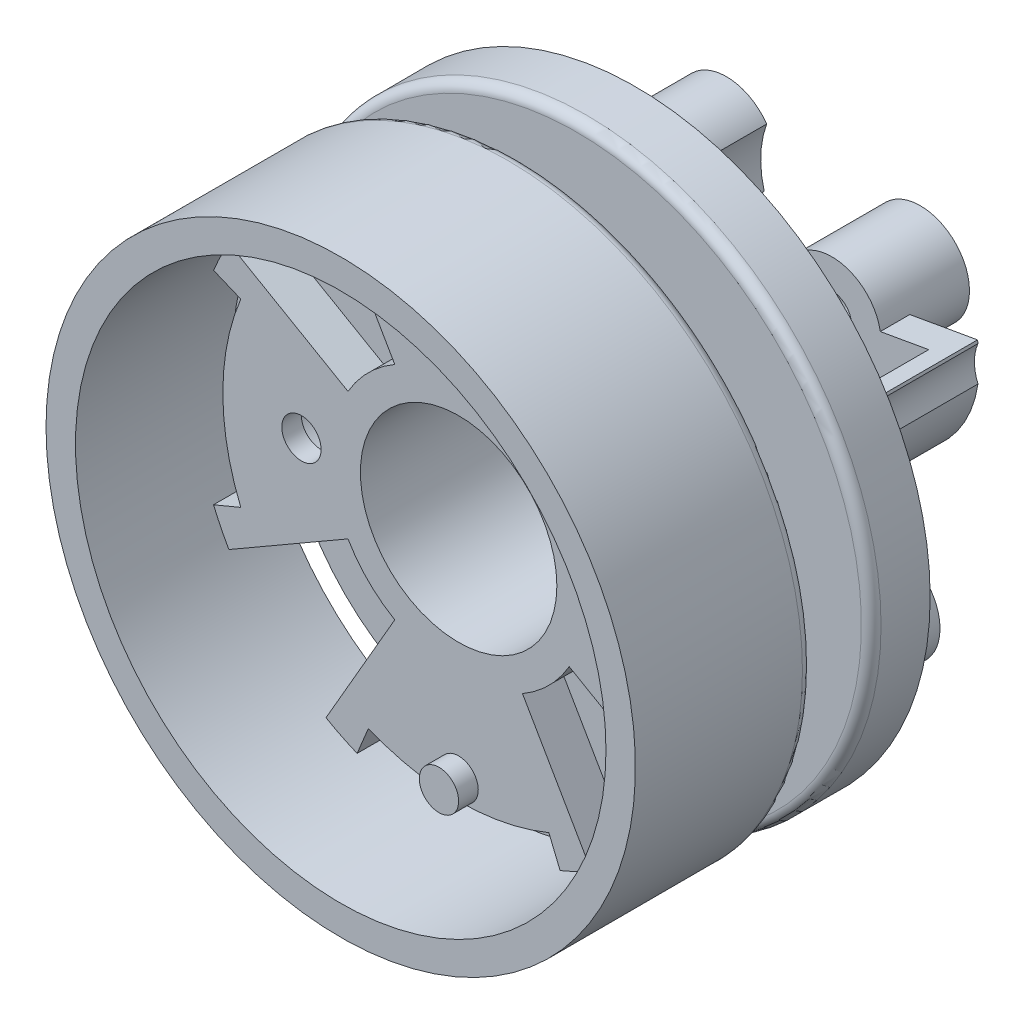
ISO-10303-21;
HEADER;
FILE_DESCRIPTION(('STEP AP214'),'2;1');
FILE_NAME('part.step','',(''),(''),'','','');
FILE_SCHEMA(('AUTOMOTIVE_DESIGN { 1 0 10303 214 1 1 1 1 }'));
ENDSEC;
DATA;
#1=APPLICATION_CONTEXT('core data for automotive mechanical design processes');
#2=APPLICATION_PROTOCOL_DEFINITION('international standard','automotive_design',2000,#1);
#3=PRODUCT_CONTEXT('',#1,'mechanical');
#4=PRODUCT('Part','Part','',(#3));
#5=PRODUCT_RELATED_PRODUCT_CATEGORY('part','',(#4));
#6=PRODUCT_DEFINITION_FORMATION('','',#4);
#7=PRODUCT_DEFINITION_CONTEXT('part definition',#1,'design');
#8=PRODUCT_DEFINITION('design','',#6,#7);
#9=PRODUCT_DEFINITION_SHAPE('','',#8);
#10=(LENGTH_UNIT() NAMED_UNIT(*) SI_UNIT(.MILLI.,.METRE.));
#11=(NAMED_UNIT(*) PLANE_ANGLE_UNIT() SI_UNIT($,.RADIAN.));
#12=(NAMED_UNIT(*) SI_UNIT($,.STERADIAN.) SOLID_ANGLE_UNIT());
#13=UNCERTAINTY_MEASURE_WITH_UNIT(LENGTH_MEASURE(1.E-05),#10,'distance_accuracy_value','');
#14=(GEOMETRIC_REPRESENTATION_CONTEXT(3) GLOBAL_UNCERTAINTY_ASSIGNED_CONTEXT((#13)) GLOBAL_UNIT_ASSIGNED_CONTEXT((#10,
#11,#12)) REPRESENTATION_CONTEXT('',''));
#15=CARTESIAN_POINT('',(0.,0.,0.));
#16=DIRECTION('',(0.,0.,1.));
#17=DIRECTION('',(1.,0.,0.));
#18=AXIS2_PLACEMENT_3D('',#15,#16,#17);
#19=CARTESIAN_POINT('',(0.,0.,-8.99999999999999));
#20=DIRECTION('',(0.,0.,-1.));
#21=DIRECTION('',(-1.,0.,0.));
#22=AXIS2_PLACEMENT_3D('',#19,#20,#21);
#23=PLANE('',#22);
#24=CARTESIAN_POINT('',(-8.,0.,-8.99999999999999));
#25=DIRECTION('',(0.,0.,-1.));
#26=DIRECTION('',(-1.,0.,0.));
#27=AXIS2_PLACEMENT_3D('',#24,#25,#26);
#28=CIRCLE('',#27,2.25);
#29=CARTESIAN_POINT('',(-5.93359374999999,-0.89020515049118,-8.99999999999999));
#30=VERTEX_POINT('',#29);
#31=CARTESIAN_POINT('',(-5.93359375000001,0.890205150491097,-9.));
#32=VERTEX_POINT('',#31);
#33=EDGE_CURVE('E1177',#30,#32,#28,.T.);
#34=ORIENTED_EDGE('',*,*,#33,.F.);
#35=CARTESIAN_POINT('',(0.,0.,-8.99999999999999));
#36=DIRECTION('',(0.,0.,-1.));
#37=DIRECTION('',(-1.,0.,0.));
#38=AXIS2_PLACEMENT_3D('',#35,#36,#37);
#39=CIRCLE('',#38,6.);
#40=CARTESIAN_POINT('',(5.93359375,-0.890205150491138,-8.99999999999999));
#41=VERTEX_POINT('',#40);
#42=EDGE_CURVE('E772',#41,#30,#39,.T.);
#43=ORIENTED_EDGE('',*,*,#42,.F.);
#44=CARTESIAN_POINT('',(8.,0.,-8.99999999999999));
#45=DIRECTION('',(0.,0.,-1.));
#46=DIRECTION('',(-1.,0.,0.));
#47=AXIS2_PLACEMENT_3D('',#44,#45,#46);
#48=CIRCLE('',#47,2.25);
#49=CARTESIAN_POINT('',(5.93359375,0.890205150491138,-8.99999999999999));
#50=VERTEX_POINT('',#49);
#51=EDGE_CURVE('E1154',#50,#41,#48,.T.);
#52=ORIENTED_EDGE('',*,*,#51,.F.);
#53=CARTESIAN_POINT('',(5.90884651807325,1.04188906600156,-8.99999999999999));
#54=VERTEX_POINT('',#53);
#55=EDGE_CURVE('E764',#54,#50,#39,.T.);
#56=ORIENTED_EDGE('',*,*,#55,.F.);
#57=DIRECTION('',(0.984807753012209,0.173648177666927,0.));
#58=VECTOR('',#57,1.);
#59=CARTESIAN_POINT('',(0.,0.,-8.99999999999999));
#60=LINE('',#59,#58);
#61=CARTESIAN_POINT('',(4.92403876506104,0.868240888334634,-8.99999999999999));
#62=VERTEX_POINT('',#61);
#63=EDGE_CURVE('E833',#62,#54,#60,.T.);
#64=ORIENTED_EDGE('',*,*,#63,.F.);
#65=CARTESIAN_POINT('',(0.,0.,-8.99999999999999));
#66=DIRECTION('',(0.,0.,-1.));
#67=DIRECTION('',(-1.,0.,0.));
#68=AXIS2_PLACEMENT_3D('',#65,#66,#67);
#69=CIRCLE('',#68,5.);
#70=CARTESIAN_POINT('',(-4.92403876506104,0.868240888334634,-8.99999999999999));
#71=VERTEX_POINT('',#70);
#72=EDGE_CURVE('E1257',#62,#71,#69,.F.);
#73=ORIENTED_EDGE('',*,*,#72,.T.);
#74=DIRECTION('',(0.984807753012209,-0.173648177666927,0.));
#75=VECTOR('',#74,1.);
#76=CARTESIAN_POINT('',(0.,0.,-8.99999999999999));
#77=LINE('',#76,#75);
#78=CARTESIAN_POINT('',(-5.90884651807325,1.04188906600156,-8.99999999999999));
#79=VERTEX_POINT('',#78);
#80=EDGE_CURVE('E830',#79,#71,#77,.T.);
#81=ORIENTED_EDGE('',*,*,#80,.F.);
#82=EDGE_CURVE('E774',#32,#79,#39,.T.);
#83=ORIENTED_EDGE('',*,*,#82,.F.);
#84=EDGE_LOOP('',(#34,#43,#52,#56,#64,#73,#81,#83));
#85=FACE_BOUND('',#84,.T.);
#86=CARTESIAN_POINT('',(0.,0.,-8.99999999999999));
#87=DIRECTION('',(0.,0.,-1.));
#88=DIRECTION('',(-1.,0.,0.));
#89=AXIS2_PLACEMENT_3D('',#86,#87,#88);
#90=CIRCLE('',#89,14.);
#91=CARTESIAN_POINT('',(-14.,0.,-8.99999999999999));
#92=VERTEX_POINT('',#91);
#93=EDGE_CURVE('E1243',#92,#92,#90,.T.);
#94=ORIENTED_EDGE('',*,*,#93,.T.);
#95=EDGE_LOOP('',(#94));
#96=FACE_BOUND('',#95,.T.);
#97=CARTESIAN_POINT('',(3.375,6.97652313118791,-8.99999999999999));
#98=DIRECTION('',(0.,0.,-1.));
#99=DIRECTION('',(-1.,0.,0.));
#100=AXIS2_PLACEMENT_3D('',#97,#98,#99);
#101=CIRCLE('',#100,2.5);
#102=CARTESIAN_POINT('',(5.87500000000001,6.97652313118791,-8.99999999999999));
#103=VERTEX_POINT('',#102);
#104=EDGE_CURVE('E1188',#103,#103,#101,.T.);
#105=ORIENTED_EDGE('',*,*,#104,.F.);
#106=EDGE_LOOP('',(#105));
#107=FACE_BOUND('',#106,.T.);
#108=CARTESIAN_POINT('',(-3.36921506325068,7.25592102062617,-8.99999999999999));
#109=DIRECTION('',(0.,0.,-1.));
#110=DIRECTION('',(-1.,0.,0.));
#111=AXIS2_PLACEMENT_3D('',#108,#109,#110);
#112=CIRCLE('',#111,2.5);
#113=CARTESIAN_POINT('',(-5.86921506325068,7.25592102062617,-8.99999999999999));
#114=VERTEX_POINT('',#113);
#115=EDGE_CURVE('E1195',#114,#114,#112,.T.);
#116=ORIENTED_EDGE('',*,*,#115,.F.);
#117=EDGE_LOOP('',(#116));
#118=FACE_BOUND('',#117,.T.);
#119=CARTESIAN_POINT('',(-9.5,-4.63345959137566,-8.99999999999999));
#120=DIRECTION('',(0.,0.,-1.));
#121=DIRECTION('',(-1.,0.,0.));
#122=AXIS2_PLACEMENT_3D('',#119,#120,#121);
#123=CIRCLE('',#122,2.5);
#124=CARTESIAN_POINT('',(-7.,-4.63345959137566,-8.99999999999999));
#125=VERTEX_POINT('',#124);
#126=EDGE_CURVE('E1204',#125,#125,#123,.T.);
#127=ORIENTED_EDGE('',*,*,#126,.F.);
#128=EDGE_LOOP('',(#127));
#129=FACE_BOUND('',#128,.T.);
#130=CARTESIAN_POINT('',(9.5,-4.63345959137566,-8.99999999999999));
#131=DIRECTION('',(0.,0.,-1.));
#132=DIRECTION('',(0.615661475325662,-0.788010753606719,0.));
#133=AXIS2_PLACEMENT_3D('',#130,#131,#132);
#134=CIRCLE('',#133,2.5);
#135=CARTESIAN_POINT('',(12.,-4.63345959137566,-8.99999999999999));
#136=VERTEX_POINT('',#135);
#137=EDGE_CURVE('E1212',#136,#136,#134,.T.);
#138=ORIENTED_EDGE('',*,*,#137,.F.);
#139=EDGE_LOOP('',(#138));
#140=FACE_BOUND('',#139,.T.);
#141=ADVANCED_FACE('F34',(#85,#96,#107,#118,#129,#140),#23,.T.);
#142=CARTESIAN_POINT('',(-3.36921506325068,7.25592102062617,-18.5));
#143=DIRECTION('',(0.,0.,-1.));
#144=DIRECTION('',(-1.,0.,0.));
#145=AXIS2_PLACEMENT_3D('',#142,#143,#144);
#146=PLANE('',#145);
#147=CARTESIAN_POINT('',(-3.36921506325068,7.25592102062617,-18.5));
#148=DIRECTION('',(0.,0.,-1.));
#149=DIRECTION('',(-1.,0.,0.));
#150=AXIS2_PLACEMENT_3D('',#147,#148,#149);
#151=CIRCLE('',#150,1.);
#152=CARTESIAN_POINT('',(-2.36921506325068,7.25592102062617,-18.5));
#153=VERTEX_POINT('',#152);
#154=EDGE_CURVE('E1198',#153,#153,#151,.T.);
#155=ORIENTED_EDGE('',*,*,#154,.F.);
#156=EDGE_LOOP('',(#155));
#157=FACE_BOUND('',#156,.T.);
#158=CARTESIAN_POINT('',(-3.36921506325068,7.25592102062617,-18.5));
#159=DIRECTION('',(0.,0.,-1.));
#160=DIRECTION('',(-1.,0.,0.));
#161=AXIS2_PLACEMENT_3D('',#158,#159,#160);
#162=CIRCLE('',#161,2.5);
#163=CARTESIAN_POINT('',(-1.44765374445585,5.6566705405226,-18.5));
#164=VERTEX_POINT('',#163);
#165=CARTESIAN_POINT('',(-1.32195846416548,8.69075216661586,-18.5));
#166=VERTEX_POINT('',#165);
#167=EDGE_CURVE('E406',#164,#166,#162,.T.);
#168=ORIENTED_EDGE('',*,*,#167,.T.);
#169=CARTESIAN_POINT('',(3.375,6.97652313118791,-18.5));
#170=DIRECTION('',(0.,0.,-1.));
#171=DIRECTION('',(-1.,0.,0.));
#172=AXIS2_PLACEMENT_3D('',#169,#170,#171);
#173=CIRCLE('',#172,5.);
#174=EDGE_CURVE('E400',#166,#164,#173,.F.);
#175=ORIENTED_EDGE('',*,*,#174,.T.);
#176=EDGE_LOOP('',(#168,#175));
#177=FACE_BOUND('',#176,.T.);
#178=ADVANCED_FACE('F444',(#157,#177),#146,.T.);
#179=CARTESIAN_POINT('',(-3.36921506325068,7.25592102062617,-18.5));
#180=DIRECTION('',(0.,0.,1.));
#181=DIRECTION('',(1.,0.,0.));
#182=AXIS2_PLACEMENT_3D('',#179,#180,#181);
#183=CYLINDRICAL_SURFACE('',#182,2.5);
#184=ORIENTED_EDGE('',*,*,#115,.T.);
#185=EDGE_LOOP('',(#184));
#186=FACE_BOUND('',#185,.T.);
#187=DIRECTION('',(0.,0.,1.));
#188=VECTOR('',#187,1.);
#189=CARTESIAN_POINT('',(-1.32195846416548,8.69075216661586,-18.5));
#190=LINE('',#189,#188);
#191=CARTESIAN_POINT('',(-1.32195846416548,8.69075216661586,-12.));
#192=VERTEX_POINT('',#191);
#193=EDGE_CURVE('E399',#166,#192,#190,.T.);
#194=ORIENTED_EDGE('',*,*,#193,.F.);
#195=ORIENTED_EDGE('',*,*,#167,.F.);
#196=DIRECTION('',(0.,0.,1.));
#197=VECTOR('',#196,1.);
#198=CARTESIAN_POINT('',(-1.44765374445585,5.6566705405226,-18.5));
#199=LINE('',#198,#197);
#200=CARTESIAN_POINT('',(-1.44765374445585,5.65667054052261,-12.));
#201=VERTEX_POINT('',#200);
#202=EDGE_CURVE('E393',#201,#164,#199,.F.);
#203=ORIENTED_EDGE('',*,*,#202,.F.);
#204=CARTESIAN_POINT('',(-3.36921506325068,7.25592102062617,-12.));
#205=DIRECTION('',(0.,0.,-1.));
#206=DIRECTION('',(-1.,0.,0.));
#207=AXIS2_PLACEMENT_3D('',#204,#205,#206);
#208=CIRCLE('',#207,2.5);
#209=EDGE_CURVE('E388',#192,#201,#208,.T.);
#210=ORIENTED_EDGE('',*,*,#209,.F.);
#211=EDGE_LOOP('',(#194,#195,#203,#210));
#212=FACE_BOUND('',#211,.T.);
#213=ADVANCED_FACE('F404',(#186,#212),#183,.T.);
#214=CARTESIAN_POINT('',(0.,0.,-22.));
#215=DIRECTION('',(0.,0.,0.999999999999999));
#216=DIRECTION('',(1.,0.,0.));
#217=AXIS2_PLACEMENT_3D('',#214,#215,#216);
#218=CYLINDRICAL_SURFACE('',#217,6.);
#219=ORIENTED_EDGE('',*,*,#42,.T.);
#220=DIRECTION('',(0.,0.,-1.));
#221=VECTOR('',#220,1.);
#222=CARTESIAN_POINT('',(-5.93359374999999,-0.89020515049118,-12.25));
#223=LINE('',#222,#221);
#224=CARTESIAN_POINT('',(-5.93359374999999,-0.89020515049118,-22.));
#225=VERTEX_POINT('',#224);
#226=EDGE_CURVE('E1174',#30,#225,#223,.T.);
#227=ORIENTED_EDGE('',*,*,#226,.T.);
#228=CARTESIAN_POINT('',(0.,0.,-22.));
#229=DIRECTION('',(0.,0.,-1.));
#230=DIRECTION('',(-1.,0.,0.));
#231=AXIS2_PLACEMENT_3D('',#228,#229,#230);
#232=CIRCLE('',#231,6.);
#233=CARTESIAN_POINT('',(5.93359375,-0.890205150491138,-22.));
#234=VERTEX_POINT('',#233);
#235=EDGE_CURVE('E775',#234,#225,#232,.T.);
#236=ORIENTED_EDGE('',*,*,#235,.F.);
#237=DIRECTION('',(0.,0.,-1.));
#238=VECTOR('',#237,1.);
#239=CARTESIAN_POINT('',(5.93359375,-0.890205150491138,-12.25));
#240=LINE('',#239,#238);
#241=EDGE_CURVE('E1156',#234,#41,#240,.F.);
#242=ORIENTED_EDGE('',*,*,#241,.T.);
#243=EDGE_LOOP('',(#219,#227,#236,#242));
#244=FACE_BOUND('',#243,.T.);
#245=ADVANCED_FACE('F514',(#244),#218,.T.);
#246=CARTESIAN_POINT('',(0.,0.,-7.5));
#247=DIRECTION('',(0.,0.,1.));
#248=DIRECTION('',(1.,0.,0.));
#249=AXIS2_PLACEMENT_3D('',#246,#247,#248);
#250=CYLINDRICAL_SURFACE('',#249,8.);
#251=DIRECTION('',(0.,0.,-1.));
#252=VECTOR('',#251,1.);
#253=CARTESIAN_POINT('',(-7.68359374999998,-2.22764159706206,-6.));
#254=LINE('',#253,#252);
#255=CARTESIAN_POINT('',(-7.68359374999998,-2.22764159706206,-7.5));
#256=VERTEX_POINT('',#255);
#257=CARTESIAN_POINT('',(-7.68359374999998,-2.22764159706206,-4.5));
#258=VERTEX_POINT('',#257);
#259=EDGE_CURVE('E1166',#256,#258,#254,.F.);
#260=ORIENTED_EDGE('',*,*,#259,.F.);
#261=CARTESIAN_POINT('',(0.,0.,-7.5));
#262=DIRECTION('',(0.,0.,-1.));
#263=DIRECTION('',(-1.,0.,0.));
#264=AXIS2_PLACEMENT_3D('',#261,#262,#263);
#265=CIRCLE('',#264,8.);
#266=CARTESIAN_POINT('',(7.68359375,-2.227641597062,-7.5));
#267=VERTEX_POINT('',#266);
#268=EDGE_CURVE('E1233',#256,#267,#265,.F.);
#269=ORIENTED_EDGE('',*,*,#268,.T.);
#270=DIRECTION('',(0.,0.,-1.));
#271=VECTOR('',#270,1.);
#272=CARTESIAN_POINT('',(7.68359375,-2.227641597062,-12.25));
#273=LINE('',#272,#271);
#274=CARTESIAN_POINT('',(7.68359375,-2.227641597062,-4.5));
#275=VERTEX_POINT('',#274);
#276=EDGE_CURVE('E1147',#275,#267,#273,.T.);
#277=ORIENTED_EDGE('',*,*,#276,.F.);
#278=CARTESIAN_POINT('',(0.,0.,-4.5));
#279=DIRECTION('',(0.,0.,1.));
#280=DIRECTION('',(1.,0.,0.));
#281=AXIS2_PLACEMENT_3D('',#278,#279,#280);
#282=CIRCLE('',#281,8.);
#283=EDGE_CURVE('E1241',#258,#275,#282,.T.);
#284=ORIENTED_EDGE('',*,*,#283,.F.);
#285=EDGE_LOOP('',(#260,#269,#277,#284));
#286=FACE_BOUND('',#285,.T.);
#287=ADVANCED_FACE('F750',(#286),#250,.T.);
#288=ORIENTED_EDGE('',*,*,#55,.T.);
#289=DIRECTION('',(0.,0.,-1.));
#290=VECTOR('',#289,1.);
#291=CARTESIAN_POINT('',(5.93359375,0.890205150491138,-12.25));
#292=LINE('',#291,#290);
#293=CARTESIAN_POINT('',(5.93359375,0.890205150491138,-22.));
#294=VERTEX_POINT('',#293);
#295=EDGE_CURVE('E766',#50,#294,#292,.T.);
#296=ORIENTED_EDGE('',*,*,#295,.T.);
#297=CARTESIAN_POINT('',(5.90884651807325,1.04188906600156,-22.));
#298=VERTEX_POINT('',#297);
#299=EDGE_CURVE('E777',#298,#294,#232,.T.);
#300=ORIENTED_EDGE('',*,*,#299,.F.);
#301=DIRECTION('',(0.,0.,-1.));
#302=VECTOR('',#301,1.);
#303=CARTESIAN_POINT('',(5.90884651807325,1.04188906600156,4.25359833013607));
#304=LINE('',#303,#302);
#305=EDGE_CURVE('E768',#54,#298,#304,.T.);
#306=ORIENTED_EDGE('',*,*,#305,.F.);
#307=EDGE_LOOP('',(#288,#296,#300,#306));
#308=FACE_BOUND('',#307,.T.);
#309=ADVANCED_FACE('F731',(#308),#218,.T.);
#310=CARTESIAN_POINT('',(0.,0.,-1.5));
#311=DIRECTION('',(0.,0.,1.));
#312=DIRECTION('',(1.,0.,0.));
#313=AXIS2_PLACEMENT_3D('',#310,#311,#312);
#314=PLANE('',#313);
#315=CARTESIAN_POINT('',(-8.,0.,-1.5));
#316=DIRECTION('',(0.,0.,1.));
#317=DIRECTION('',(-1.,0.,0.));
#318=AXIS2_PLACEMENT_3D('',#315,#316,#317);
#319=CIRCLE('',#318,1.);
#320=CARTESIAN_POINT('',(-6.99999999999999,0.,-1.5));
#321=VERTEX_POINT('',#320);
#322=EDGE_CURVE('E1163',#321,#321,#319,.T.);
#323=ORIENTED_EDGE('',*,*,#322,.F.);
#324=EDGE_LOOP('',(#323));
#325=FACE_BOUND('',#324,.T.);
#326=CARTESIAN_POINT('',(8.,0.,-1.5));
#327=DIRECTION('',(0.,0.,1.));
#328=DIRECTION('',(1.,0.,0.));
#329=AXIS2_PLACEMENT_3D('',#326,#327,#328);
#330=CIRCLE('',#329,1.);
#331=CARTESIAN_POINT('',(9.,0.,-1.5));
#332=VERTEX_POINT('',#331);
#333=EDGE_CURVE('E1139',#332,#332,#330,.T.);
#334=ORIENTED_EDGE('',*,*,#333,.F.);
#335=EDGE_LOOP('',(#334));
#336=FACE_BOUND('',#335,.T.);
#337=CARTESIAN_POINT('',(0.,0.,-1.5));
#338=DIRECTION('',(0.,0.,1.));
#339=DIRECTION('',(1.,0.,0.));
#340=AXIS2_PLACEMENT_3D('',#337,#338,#339);
#341=CIRCLE('',#340,5.);
#342=CARTESIAN_POINT('',(5.,0.,-1.5));
#343=VERTEX_POINT('',#342);
#344=EDGE_CURVE('E819',#343,#343,#341,.T.);
#345=ORIENTED_EDGE('',*,*,#344,.F.);
#346=EDGE_LOOP('',(#345));
#347=FACE_BOUND('',#346,.T.);
#348=CARTESIAN_POINT('',(0.,0.,-1.5));
#349=DIRECTION('',(0.,0.,1.));
#350=DIRECTION('',(0.,-1.,0.));
#351=AXIS2_PLACEMENT_3D('',#348,#349,#350);
#352=CIRCLE('',#351,12.);
#353=CARTESIAN_POINT('',(-4.59220118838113,-11.0865543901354,-1.5));
#354=VERTEX_POINT('',#353);
#355=CARTESIAN_POINT('',(0.,-12.,-1.5));
#356=VERTEX_POINT('',#355);
#357=EDGE_CURVE('E948',#354,#356,#352,.T.);
#358=ORIENTED_EDGE('',*,*,#357,.T.);
#359=CARTESIAN_POINT('',(0.,-11.,-1.5));
#360=DIRECTION('',(0.,0.,1.));
#361=DIRECTION('',(1.,0.,0.));
#362=AXIS2_PLACEMENT_3D('',#359,#360,#361);
#363=CIRCLE('',#362,1.);
#364=EDGE_CURVE('E1137',#356,#356,#363,.T.);
#365=ORIENTED_EDGE('',*,*,#364,.F.);
#366=CARTESIAN_POINT('',(4.59220118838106,-11.0865543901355,-1.5));
#367=VERTEX_POINT('',#366);
#368=EDGE_CURVE('E951',#356,#367,#352,.T.);
#369=ORIENTED_EDGE('',*,*,#368,.T.);
#370=DIRECTION('',(0.382683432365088,-0.923879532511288,0.));
#371=VECTOR('',#370,1.);
#372=CARTESIAN_POINT('',(4.59220118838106,-11.0865543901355,-1.5));
#373=LINE('',#372,#371);
#374=CARTESIAN_POINT('',(5.16622633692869,-12.4723736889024,-1.5));
#375=VERTEX_POINT('',#374);
#376=EDGE_CURVE('E952',#367,#375,#373,.T.);
#377=ORIENTED_EDGE('',*,*,#376,.T.);
#378=CARTESIAN_POINT('',(0.,0.,-1.5));
#379=DIRECTION('',(0.,0.,1.));
#380=DIRECTION('',(1.,0.,0.));
#381=AXIS2_PLACEMENT_3D('',#378,#379,#380);
#382=CIRCLE('',#381,13.5);
#383=CARTESIAN_POINT('',(6.7499999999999,-11.69134295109,-1.5));
#384=VERTEX_POINT('',#383);
#385=EDGE_CURVE('E794',#375,#384,#382,.T.);
#386=ORIENTED_EDGE('',*,*,#385,.T.);
#387=DIRECTION('',(-0.499999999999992,0.866025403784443,0.));
#388=VECTOR('',#387,1.);
#389=CARTESIAN_POINT('',(0.,0.,-1.5));
#390=LINE('',#389,#388);
#391=CARTESIAN_POINT('',(3.24999999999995,-5.62916512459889,-1.5));
#392=VERTEX_POINT('',#391);
#393=EDGE_CURVE('E1008',#384,#392,#390,.T.);
#394=ORIENTED_EDGE('',*,*,#393,.T.);
#395=CARTESIAN_POINT('',(0.,0.,-1.5));
#396=DIRECTION('',(0.,0.,1.));
#397=DIRECTION('',(1.,0.,0.));
#398=AXIS2_PLACEMENT_3D('',#395,#396,#397);
#399=CIRCLE('',#398,6.5);
#400=CARTESIAN_POINT('',(5.62916512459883,-3.25000000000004,-1.5));
#401=VERTEX_POINT('',#400);
#402=EDGE_CURVE('E1264',#392,#401,#399,.T.);
#403=ORIENTED_EDGE('',*,*,#402,.T.);
#404=DIRECTION('',(0.866025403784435,-0.500000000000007,0.));
#405=VECTOR('',#404,1.);
#406=CARTESIAN_POINT('',(0.,0.,-1.5));
#407=LINE('',#406,#405);
#408=CARTESIAN_POINT('',(11.6913429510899,-6.75000000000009,-1.5));
#409=VERTEX_POINT('',#408);
#410=EDGE_CURVE('E1011',#401,#409,#407,.T.);
#411=ORIENTED_EDGE('',*,*,#410,.T.);
#412=CARTESIAN_POINT('',(12.4723736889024,-5.16622633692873,-1.5));
#413=VERTEX_POINT('',#412);
#414=EDGE_CURVE('E803',#409,#413,#382,.T.);
#415=ORIENTED_EDGE('',*,*,#414,.T.);
#416=DIRECTION('',(-0.923879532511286,0.382683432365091,0.));
#417=VECTOR('',#416,1.);
#418=CARTESIAN_POINT('',(12.4723736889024,-5.16622633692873,-1.5));
#419=LINE('',#418,#417);
#420=CARTESIAN_POINT('',(11.0865543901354,-4.59220118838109,-1.5));
#421=VERTEX_POINT('',#420);
#422=EDGE_CURVE('E878',#413,#421,#419,.T.);
#423=ORIENTED_EDGE('',*,*,#422,.T.);
#424=CARTESIAN_POINT('',(0.,0.,-1.5));
#425=DIRECTION('',(0.,0.,1.));
#426=DIRECTION('',(1.,0.,0.));
#427=AXIS2_PLACEMENT_3D('',#424,#425,#426);
#428=CIRCLE('',#427,12.);
#429=CARTESIAN_POINT('',(11.0865543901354,4.59220118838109,-1.5));
#430=VERTEX_POINT('',#429);
#431=EDGE_CURVE('E880',#421,#430,#428,.T.);
#432=ORIENTED_EDGE('',*,*,#431,.T.);
#433=DIRECTION('',(0.923879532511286,0.382683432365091,0.));
#434=VECTOR('',#433,1.);
#435=CARTESIAN_POINT('',(11.0865543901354,4.59220118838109,-1.5));
#436=LINE('',#435,#434);
#437=CARTESIAN_POINT('',(12.4723736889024,5.16622633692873,-1.5));
#438=VERTEX_POINT('',#437);
#439=EDGE_CURVE('E883',#430,#438,#436,.T.);
#440=ORIENTED_EDGE('',*,*,#439,.T.);
#441=CARTESIAN_POINT('',(11.69134295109,6.74999999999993,-1.5));
#442=VERTEX_POINT('',#441);
#443=EDGE_CURVE('E780',#438,#442,#382,.T.);
#444=ORIENTED_EDGE('',*,*,#443,.T.);
#445=DIRECTION('',(-0.866025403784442,-0.499999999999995,0.));
#446=VECTOR('',#445,1.);
#447=CARTESIAN_POINT('',(0.,0.,-1.5));
#448=LINE('',#447,#446);
#449=CARTESIAN_POINT('',(5.62916512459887,3.24999999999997,-1.5));
#450=VERTEX_POINT('',#449);
#451=EDGE_CURVE('E885',#442,#450,#448,.T.);
#452=ORIENTED_EDGE('',*,*,#451,.T.);
#453=CARTESIAN_POINT('',(0.,0.,-1.5));
#454=DIRECTION('',(0.,0.,1.));
#455=DIRECTION('',(1.,0.,0.));
#456=AXIS2_PLACEMENT_3D('',#453,#454,#455);
#457=CIRCLE('',#456,6.5);
#458=CARTESIAN_POINT('',(3.25000000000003,5.62916512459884,-1.5));
#459=VERTEX_POINT('',#458);
#460=EDGE_CURVE('E1261',#450,#459,#457,.T.);
#461=ORIENTED_EDGE('',*,*,#460,.T.);
#462=DIRECTION('',(0.500000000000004,0.866025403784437,0.));
#463=VECTOR('',#462,1.);
#464=CARTESIAN_POINT('',(0.,0.,-1.5));
#465=LINE('',#464,#463);
#466=CARTESIAN_POINT('',(6.75000000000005,11.6913429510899,-1.5));
#467=VERTEX_POINT('',#466);
#468=EDGE_CURVE('E887',#459,#467,#465,.T.);
#469=ORIENTED_EDGE('',*,*,#468,.T.);
#470=CARTESIAN_POINT('',(5.16622633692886,12.4723736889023,-1.5));
#471=VERTEX_POINT('',#470);
#472=EDGE_CURVE('E786',#467,#471,#382,.T.);
#473=ORIENTED_EDGE('',*,*,#472,.T.);
#474=DIRECTION('',(-0.382683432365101,-0.923879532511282,0.));
#475=VECTOR('',#474,1.);
#476=CARTESIAN_POINT('',(5.16622633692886,12.4723736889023,-1.5));
#477=LINE('',#476,#475);
#478=CARTESIAN_POINT('',(4.59220118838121,11.0865543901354,-1.5));
#479=VERTEX_POINT('',#478);
#480=EDGE_CURVE('E999',#471,#479,#477,.T.);
#481=ORIENTED_EDGE('',*,*,#480,.T.);
#482=CARTESIAN_POINT('',(0.,0.,-1.5));
#483=DIRECTION('',(0.,0.,1.));
#484=DIRECTION('',(0.,1.,0.));
#485=AXIS2_PLACEMENT_3D('',#482,#483,#484);
#486=CIRCLE('',#485,12.);
#487=CARTESIAN_POINT('',(-4.59220118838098,11.0865543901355,-1.5));
#488=VERTEX_POINT('',#487);
#489=EDGE_CURVE('E1002',#479,#488,#486,.T.);
#490=ORIENTED_EDGE('',*,*,#489,.T.);
#491=DIRECTION('',(-0.382683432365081,0.92387953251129,0.));
#492=VECTOR('',#491,1.);
#493=CARTESIAN_POINT('',(-4.59220118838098,11.0865543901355,-1.5));
#494=LINE('',#493,#492);
#495=CARTESIAN_POINT('',(-5.1662263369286,12.4723736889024,-1.5));
#496=VERTEX_POINT('',#495);
#497=EDGE_CURVE('E1005',#488,#496,#494,.T.);
#498=ORIENTED_EDGE('',*,*,#497,.T.);
#499=CARTESIAN_POINT('',(-6.74999999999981,11.69134295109,-1.5));
#500=VERTEX_POINT('',#499);
#501=EDGE_CURVE('E793',#496,#500,#382,.T.);
#502=ORIENTED_EDGE('',*,*,#501,.T.);
#503=DIRECTION('',(0.499999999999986,-0.866025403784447,0.));
#504=VECTOR('',#503,1.);
#505=CARTESIAN_POINT('',(0.,0.,-1.5));
#506=LINE('',#505,#504);
#507=CARTESIAN_POINT('',(-3.24999999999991,5.62916512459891,-1.5));
#508=VERTEX_POINT('',#507);
#509=EDGE_CURVE('E1054',#500,#508,#506,.T.);
#510=ORIENTED_EDGE('',*,*,#509,.T.);
#511=CARTESIAN_POINT('',(0.,0.,-1.5));
#512=DIRECTION('',(0.,0.,1.));
#513=DIRECTION('',(1.,0.,0.));
#514=AXIS2_PLACEMENT_3D('',#511,#512,#513);
#515=CIRCLE('',#514,6.5);
#516=CARTESIAN_POINT('',(-5.62916512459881,3.25000000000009,-1.5));
#517=VERTEX_POINT('',#516);
#518=EDGE_CURVE('E1270',#508,#517,#515,.T.);
#519=ORIENTED_EDGE('',*,*,#518,.T.);
#520=DIRECTION('',(-0.866025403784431,0.500000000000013,0.));
#521=VECTOR('',#520,1.);
#522=CARTESIAN_POINT('',(0.,0.,-1.5));
#523=LINE('',#522,#521);
#524=CARTESIAN_POINT('',(-11.6913429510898,6.75000000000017,-1.5));
#525=VERTEX_POINT('',#524);
#526=EDGE_CURVE('E1057',#517,#525,#523,.T.);
#527=ORIENTED_EDGE('',*,*,#526,.T.);
#528=CARTESIAN_POINT('',(-12.4723736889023,5.16622633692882,-1.5));
#529=VERTEX_POINT('',#528);
#530=EDGE_CURVE('E787',#525,#529,#382,.T.);
#531=ORIENTED_EDGE('',*,*,#530,.T.);
#532=DIRECTION('',(0.923879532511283,-0.382683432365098,0.));
#533=VECTOR('',#532,1.);
#534=CARTESIAN_POINT('',(-12.4723736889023,5.16622633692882,-1.5));
#535=LINE('',#534,#533);
#536=CARTESIAN_POINT('',(-11.0865543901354,4.59220118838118,-1.5));
#537=VERTEX_POINT('',#536);
#538=EDGE_CURVE('E973',#529,#537,#535,.T.);
#539=ORIENTED_EDGE('',*,*,#538,.T.);
#540=CARTESIAN_POINT('',(0.,0.,-1.5));
#541=DIRECTION('',(0.,0.,1.));
#542=DIRECTION('',(-1.,0.,0.));
#543=AXIS2_PLACEMENT_3D('',#540,#541,#542);
#544=CIRCLE('',#543,12.);
#545=CARTESIAN_POINT('',(-11.0865543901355,-4.59220118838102,-1.5));
#546=VERTEX_POINT('',#545);
#547=EDGE_CURVE('E975',#537,#546,#544,.T.);
#548=ORIENTED_EDGE('',*,*,#547,.T.);
#549=DIRECTION('',(-0.923879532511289,-0.382683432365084,0.));
#550=VECTOR('',#549,1.);
#551=CARTESIAN_POINT('',(-11.0865543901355,-4.59220118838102,-1.5));
#552=LINE('',#551,#550);
#553=CARTESIAN_POINT('',(-12.4723736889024,-5.16622633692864,-1.5));
#554=VERTEX_POINT('',#553);
#555=EDGE_CURVE('E978',#546,#554,#552,.T.);
#556=ORIENTED_EDGE('',*,*,#555,.T.);
#557=CARTESIAN_POINT('',(-11.69134295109,-6.74999999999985,-1.5));
#558=VERTEX_POINT('',#557);
#559=EDGE_CURVE('E796',#554,#558,#382,.T.);
#560=ORIENTED_EDGE('',*,*,#559,.T.);
#561=DIRECTION('',(0.866025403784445,0.499999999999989,0.));
#562=VECTOR('',#561,1.);
#563=CARTESIAN_POINT('',(0.,0.,-1.5));
#564=LINE('',#563,#562);
#565=CARTESIAN_POINT('',(-5.62916512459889,-3.24999999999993,-1.5));
#566=VERTEX_POINT('',#565);
#567=EDGE_CURVE('E1031',#558,#566,#564,.T.);
#568=ORIENTED_EDGE('',*,*,#567,.T.);
#569=CARTESIAN_POINT('',(0.,0.,-1.5));
#570=DIRECTION('',(0.,0.,1.));
#571=DIRECTION('',(1.,0.,0.));
#572=AXIS2_PLACEMENT_3D('',#569,#570,#571);
#573=CIRCLE('',#572,6.5);
#574=CARTESIAN_POINT('',(-3.25000000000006,-5.62916512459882,-1.5));
#575=VERTEX_POINT('',#574);
#576=EDGE_CURVE('E1267',#566,#575,#573,.T.);
#577=ORIENTED_EDGE('',*,*,#576,.T.);
#578=DIRECTION('',(-0.50000000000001,-0.866025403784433,0.));
#579=VECTOR('',#578,1.);
#580=CARTESIAN_POINT('',(0.,0.,-1.5));
#581=LINE('',#580,#579);
#582=CARTESIAN_POINT('',(-6.75000000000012,-11.6913429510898,-1.5));
#583=VERTEX_POINT('',#582);
#584=EDGE_CURVE('E1034',#575,#583,#581,.T.);
#585=ORIENTED_EDGE('',*,*,#584,.T.);
#586=CARTESIAN_POINT('',(-5.16622633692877,-12.4723736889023,-1.5));
#587=VERTEX_POINT('',#586);
#588=EDGE_CURVE('E797',#583,#587,#382,.T.);
#589=ORIENTED_EDGE('',*,*,#588,.T.);
#590=DIRECTION('',(0.382683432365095,0.923879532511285,0.));
#591=VECTOR('',#590,1.);
#592=CARTESIAN_POINT('',(-5.16622633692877,-12.4723736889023,-1.5));
#593=LINE('',#592,#591);
#594=EDGE_CURVE('E946',#587,#354,#593,.T.);
#595=ORIENTED_EDGE('',*,*,#594,.T.);
#596=EDGE_LOOP('',(#358,#365,#369,#377,#386,#394,#403,#411,#415,#423,#432,#440,#444,#452,#461,
#469,#473,#481,#490,#498,#502,#510,#519,#527,#531,#539,#548,#556,#560,#568,#577,#585,#589,#595));
#597=FACE_BOUND('',#596,.T.);
#598=ADVANCED_FACE('F572',(#325,#336,#347,#597),#314,.T.);
#599=CARTESIAN_POINT('',(0.,0.,-3.5));
#600=DIRECTION('',(0.,0.,1.));
#601=DIRECTION('',(1.,0.,0.));
#602=AXIS2_PLACEMENT_3D('',#599,#600,#601);
#603=PLANE('',#602);
#604=DIRECTION('',(0.499999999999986,-0.866025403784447,0.));
#605=VECTOR('',#604,1.);
#606=CARTESIAN_POINT('',(-6.74999999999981,11.69134295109,-3.5));
#607=LINE('',#606,#605);
#608=CARTESIAN_POINT('',(-5.49999999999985,9.52627944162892,-3.5));
#609=VERTEX_POINT('',#608);
#610=CARTESIAN_POINT('',(-3.24999999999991,5.62916512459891,-3.5));
#611=VERTEX_POINT('',#610);
#612=EDGE_CURVE('E1063',#609,#611,#607,.T.);
#613=ORIENTED_EDGE('',*,*,#612,.F.);
#614=CARTESIAN_POINT('',(0.,0.,-3.5));
#615=DIRECTION('',(0.,0.,1.));
#616=DIRECTION('',(0.,1.,0.));
#617=AXIS2_PLACEMENT_3D('',#614,#615,#616);
#618=CIRCLE('',#617,11.);
#619=CARTESIAN_POINT('',(-9.52627944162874,5.50000000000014,-3.5));
#620=VERTEX_POINT('',#619);
#621=EDGE_CURVE('E1121',#609,#620,#618,.T.);
#622=ORIENTED_EDGE('',*,*,#621,.T.);
#623=DIRECTION('',(-0.866025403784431,0.500000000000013,0.));
#624=VECTOR('',#623,1.);
#625=CARTESIAN_POINT('',(-5.62916512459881,3.25000000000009,-3.5));
#626=LINE('',#625,#624);
#627=CARTESIAN_POINT('',(-5.62916512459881,3.25000000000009,-3.5));
#628=VERTEX_POINT('',#627);
#629=EDGE_CURVE('E1074',#628,#620,#626,.T.);
#630=ORIENTED_EDGE('',*,*,#629,.F.);
#631=CARTESIAN_POINT('',(0.,0.,-3.5));
#632=DIRECTION('',(0.,0.,1.));
#633=DIRECTION('',(0.,1.,0.));
#634=AXIS2_PLACEMENT_3D('',#631,#632,#633);
#635=CIRCLE('',#634,6.5);
#636=EDGE_CURVE('E1072',#611,#628,#635,.T.);
#637=ORIENTED_EDGE('',*,*,#636,.F.);
#638=EDGE_LOOP('',(#613,#622,#630,#637));
#639=FACE_BOUND('',#638,.T.);
#640=ADVANCED_FACE('F568',(#639),#603,.T.);
#641=CARTESIAN_POINT('',(0.,0.,-3.5));
#642=DIRECTION('',(0.,0.,1.));
#643=DIRECTION('',(1.,0.,0.));
#644=AXIS2_PLACEMENT_3D('',#641,#642,#643);
#645=PLANE('',#644);
#646=DIRECTION('',(0.866025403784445,0.499999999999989,0.));
#647=VECTOR('',#646,1.);
#648=CARTESIAN_POINT('',(-11.69134295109,-6.74999999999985,-3.5));
#649=LINE('',#648,#647);
#650=CARTESIAN_POINT('',(-9.52627944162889,-5.49999999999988,-3.5));
#651=VERTEX_POINT('',#650);
#652=CARTESIAN_POINT('',(-5.62916512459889,-3.24999999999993,-3.5));
#653=VERTEX_POINT('',#652);
#654=EDGE_CURVE('E1040',#651,#653,#649,.T.);
#655=ORIENTED_EDGE('',*,*,#654,.F.);
#656=CARTESIAN_POINT('',(0.,0.,-3.5));
#657=DIRECTION('',(0.,0.,1.));
#658=DIRECTION('',(-1.,0.,0.));
#659=AXIS2_PLACEMENT_3D('',#656,#657,#658);
#660=CIRCLE('',#659,11.);
#661=CARTESIAN_POINT('',(-5.5000000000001,-9.52627944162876,-3.5));
#662=VERTEX_POINT('',#661);
#663=EDGE_CURVE('E1102',#651,#662,#660,.T.);
#664=ORIENTED_EDGE('',*,*,#663,.T.);
#665=DIRECTION('',(-0.50000000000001,-0.866025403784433,0.));
#666=VECTOR('',#665,1.);
#667=CARTESIAN_POINT('',(-3.25000000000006,-5.62916512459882,-3.5));
#668=LINE('',#667,#666);
#669=CARTESIAN_POINT('',(-3.25000000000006,-5.62916512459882,-3.5));
#670=VERTEX_POINT('',#669);
#671=EDGE_CURVE('E1051',#670,#662,#668,.T.);
#672=ORIENTED_EDGE('',*,*,#671,.F.);
#673=CARTESIAN_POINT('',(0.,0.,-3.5));
#674=DIRECTION('',(0.,0.,1.));
#675=DIRECTION('',(-1.,0.,0.));
#676=AXIS2_PLACEMENT_3D('',#673,#674,#675);
#677=CIRCLE('',#676,6.5);
#678=EDGE_CURVE('E1049',#653,#670,#677,.T.);
#679=ORIENTED_EDGE('',*,*,#678,.F.);
#680=EDGE_LOOP('',(#655,#664,#672,#679));
#681=FACE_BOUND('',#680,.T.);
#682=ADVANCED_FACE('F571',(#681),#645,.T.);
#683=CARTESIAN_POINT('',(0.,0.,-3.5));
#684=DIRECTION('',(0.,0.,1.));
#685=DIRECTION('',(1.,0.,0.));
#686=AXIS2_PLACEMENT_3D('',#683,#684,#685);
#687=PLANE('',#686);
#688=DIRECTION('',(-0.499999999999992,0.866025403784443,0.));
#689=VECTOR('',#688,1.);
#690=CARTESIAN_POINT('',(6.7499999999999,-11.69134295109,-3.5));
#691=LINE('',#690,#689);
#692=CARTESIAN_POINT('',(5.49999999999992,-9.52627944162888,-3.5));
#693=VERTEX_POINT('',#692);
#694=CARTESIAN_POINT('',(3.24999999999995,-5.62916512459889,-3.5));
#695=VERTEX_POINT('',#694);
#696=EDGE_CURVE('E1017',#693,#695,#691,.T.);
#697=ORIENTED_EDGE('',*,*,#696,.F.);
#698=CARTESIAN_POINT('',(0.,0.,-3.5));
#699=DIRECTION('',(0.,0.,1.));
#700=DIRECTION('',(0.,-1.,0.));
#701=AXIS2_PLACEMENT_3D('',#698,#699,#700);
#702=CIRCLE('',#701,11.);
#703=CARTESIAN_POINT('',(9.52627944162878,-5.50000000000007,-3.5));
#704=VERTEX_POINT('',#703);
#705=EDGE_CURVE('E1083',#693,#704,#702,.T.);
#706=ORIENTED_EDGE('',*,*,#705,.T.);
#707=DIRECTION('',(0.866025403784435,-0.500000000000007,0.));
#708=VECTOR('',#707,1.);
#709=CARTESIAN_POINT('',(5.62916512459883,-3.25000000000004,-3.5));
#710=LINE('',#709,#708);
#711=CARTESIAN_POINT('',(5.62916512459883,-3.25000000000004,-3.5));
#712=VERTEX_POINT('',#711);
#713=EDGE_CURVE('E1028',#712,#704,#710,.T.);
#714=ORIENTED_EDGE('',*,*,#713,.F.);
#715=CARTESIAN_POINT('',(0.,0.,-3.5));
#716=DIRECTION('',(0.,0.,1.));
#717=DIRECTION('',(0.,-1.,0.));
#718=AXIS2_PLACEMENT_3D('',#715,#716,#717);
#719=CIRCLE('',#718,6.5);
#720=EDGE_CURVE('E1026',#695,#712,#719,.T.);
#721=ORIENTED_EDGE('',*,*,#720,.F.);
#722=EDGE_LOOP('',(#697,#706,#714,#721));
#723=FACE_BOUND('',#722,.T.);
#724=ADVANCED_FACE('F588',(#723),#687,.T.);
#725=CARTESIAN_POINT('',(0.,0.,-3.5));
#726=DIRECTION('',(0.,0.,1.));
#727=DIRECTION('',(1.,0.,0.));
#728=AXIS2_PLACEMENT_3D('',#725,#726,#727);
#729=PLANE('',#728);
#730=DIRECTION('',(-0.866025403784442,-0.499999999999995,0.));
#731=VECTOR('',#730,1.);
#732=CARTESIAN_POINT('',(11.69134295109,6.74999999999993,-3.5));
#733=LINE('',#732,#731);
#734=CARTESIAN_POINT('',(9.52627944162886,5.49999999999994,-3.5));
#735=VERTEX_POINT('',#734);
#736=CARTESIAN_POINT('',(5.62916512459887,3.24999999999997,-3.5));
#737=VERTEX_POINT('',#736);
#738=EDGE_CURVE('E894',#735,#737,#733,.T.);
#739=ORIENTED_EDGE('',*,*,#738,.F.);
#740=CARTESIAN_POINT('',(0.,0.,-3.5));
#741=DIRECTION('',(0.,0.,1.));
#742=DIRECTION('',(1.,0.,0.));
#743=AXIS2_PLACEMENT_3D('',#740,#741,#742);
#744=CIRCLE('',#743,11.);
#745=CARTESIAN_POINT('',(5.50000000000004,9.5262794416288,-3.5));
#746=VERTEX_POINT('',#745);
#747=EDGE_CURVE('E914',#735,#746,#744,.T.);
#748=ORIENTED_EDGE('',*,*,#747,.T.);
#749=DIRECTION('',(0.500000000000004,0.866025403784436,0.));
#750=VECTOR('',#749,1.);
#751=CARTESIAN_POINT('',(3.25000000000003,5.62916512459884,-3.5));
#752=LINE('',#751,#750);
#753=CARTESIAN_POINT('',(3.25000000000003,5.62916512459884,-3.5));
#754=VERTEX_POINT('',#753);
#755=EDGE_CURVE('E905',#754,#746,#752,.T.);
#756=ORIENTED_EDGE('',*,*,#755,.F.);
#757=CARTESIAN_POINT('',(0.,0.,-3.5));
#758=DIRECTION('',(0.,0.,1.));
#759=DIRECTION('',(1.,0.,0.));
#760=AXIS2_PLACEMENT_3D('',#757,#758,#759);
#761=CIRCLE('',#760,6.5);
#762=EDGE_CURVE('E903',#737,#754,#761,.T.);
#763=ORIENTED_EDGE('',*,*,#762,.F.);
#764=EDGE_LOOP('',(#739,#748,#756,#763));
#765=FACE_BOUND('',#764,.T.);
#766=ADVANCED_FACE('F604',(#765),#729,.T.);
#767=CARTESIAN_POINT('',(0.,0.,4.5));
#768=DIRECTION('',(0.,0.,-1.));
#769=DIRECTION('',(-1.,0.,0.));
#770=AXIS2_PLACEMENT_3D('',#767,#768,#769);
#771=CYLINDRICAL_SURFACE('',#770,15.);
#772=CARTESIAN_POINT('',(0.,0.,-4.));
#773=DIRECTION('',(0.,0.,1.));
#774=DIRECTION('',(1.,0.,0.));
#775=AXIS2_PLACEMENT_3D('',#772,#773,#774);
#776=CIRCLE('',#775,15.);
#777=CARTESIAN_POINT('',(-15.,0.,-4.));
#778=VERTEX_POINT('',#777);
#779=EDGE_CURVE('E42',#778,#778,#776,.T.);
#780=CARTESIAN_POINT('',(0.,0.,4.5));
#781=DIRECTION('',(0.,0.,1.));
#782=DIRECTION('',(1.,0.,0.));
#783=AXIS2_PLACEMENT_3D('',#780,#781,#782);
#784=CIRCLE('',#783,15.);
#785=CARTESIAN_POINT('',(-15.,0.,4.5));
#786=VERTEX_POINT('',#785);
#787=EDGE_CURVE('E1250',#786,#786,#784,.T.);
#788=CARTESIAN_POINT('',(-15.,0.,-4.));
#789=CARTESIAN_POINT('',(-15.,0.,-3.91145833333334));
#790=CARTESIAN_POINT('',(-15.,0.,-3.82291666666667));
#791=CARTESIAN_POINT('',(-15.,0.,-3.64583333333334));
#792=CARTESIAN_POINT('',(-15.,0.,-3.55729166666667));
#793=CARTESIAN_POINT('',(-15.,0.,-3.38020833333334));
#794=CARTESIAN_POINT('',(-15.,0.,-3.29166666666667));
#795=CARTESIAN_POINT('',(-15.,0.,-3.11458333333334));
#796=CARTESIAN_POINT('',(-15.,0.,-3.02604166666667));
#797=CARTESIAN_POINT('',(-15.,0.,-2.84895833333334));
#798=CARTESIAN_POINT('',(-15.,0.,-2.76041666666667));
#799=CARTESIAN_POINT('',(-15.,0.,-2.58333333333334));
#800=CARTESIAN_POINT('',(-15.,0.,-2.49479166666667));
#801=CARTESIAN_POINT('',(-15.,0.,-2.31770833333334));
#802=CARTESIAN_POINT('',(-15.,0.,-2.22916666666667));
#803=CARTESIAN_POINT('',(-15.,0.,-2.05208333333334));
#804=CARTESIAN_POINT('',(-15.,0.,-1.96354166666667));
#805=CARTESIAN_POINT('',(-15.,0.,-1.78645833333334));
#806=CARTESIAN_POINT('',(-15.,0.,-1.69791666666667));
#807=CARTESIAN_POINT('',(-15.,0.,-1.52083333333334));
#808=CARTESIAN_POINT('',(-15.,0.,-1.43229166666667));
#809=CARTESIAN_POINT('',(-15.,0.,-1.25520833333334));
#810=CARTESIAN_POINT('',(-15.,0.,-1.16666666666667));
#811=CARTESIAN_POINT('',(-15.,0.,-0.989583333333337));
#812=CARTESIAN_POINT('',(-15.,0.,-0.90104166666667));
#813=CARTESIAN_POINT('',(-15.,0.,-0.723958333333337));
#814=CARTESIAN_POINT('',(-15.,0.,-0.63541666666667));
#815=CARTESIAN_POINT('',(-15.,0.,-0.458333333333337));
#816=CARTESIAN_POINT('',(-15.,0.,-0.36979166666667));
#817=CARTESIAN_POINT('',(-15.,0.,-0.192708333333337));
#818=CARTESIAN_POINT('',(-15.,0.,-0.10416666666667));
#819=CARTESIAN_POINT('',(-15.,0.,0.0729166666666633));
#820=CARTESIAN_POINT('',(-15.,0.,0.16145833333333));
#821=CARTESIAN_POINT('',(-15.,0.,0.338541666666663));
#822=CARTESIAN_POINT('',(-15.,0.,0.42708333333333));
#823=CARTESIAN_POINT('',(-15.,0.,0.604166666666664));
#824=CARTESIAN_POINT('',(-15.,0.,0.69270833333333));
#825=CARTESIAN_POINT('',(-15.,0.,0.869791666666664));
#826=CARTESIAN_POINT('',(-15.,0.,0.958333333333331));
#827=CARTESIAN_POINT('',(-15.,0.,1.13541666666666));
#828=CARTESIAN_POINT('',(-15.,0.,1.22395833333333));
#829=CARTESIAN_POINT('',(-15.,0.,1.40104166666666));
#830=CARTESIAN_POINT('',(-15.,0.,1.48958333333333));
#831=CARTESIAN_POINT('',(-15.,0.,1.66666666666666));
#832=CARTESIAN_POINT('',(-15.,0.,1.75520833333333));
#833=CARTESIAN_POINT('',(-15.,0.,1.93229166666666));
#834=CARTESIAN_POINT('',(-15.,0.,2.02083333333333));
#835=CARTESIAN_POINT('',(-15.,0.,2.19791666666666));
#836=CARTESIAN_POINT('',(-15.,0.,2.28645833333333));
#837=CARTESIAN_POINT('',(-15.,0.,2.46354166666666));
#838=CARTESIAN_POINT('',(-15.,0.,2.55208333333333));
#839=CARTESIAN_POINT('',(-15.,0.,2.72916666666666));
#840=CARTESIAN_POINT('',(-15.,0.,2.81770833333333));
#841=CARTESIAN_POINT('',(-15.,0.,2.99479166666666));
#842=CARTESIAN_POINT('',(-15.,0.,3.08333333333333));
#843=CARTESIAN_POINT('',(-15.,0.,3.26041666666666));
#844=CARTESIAN_POINT('',(-15.,0.,3.34895833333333));
#845=CARTESIAN_POINT('',(-15.,0.,3.52604166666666));
#846=CARTESIAN_POINT('',(-15.,0.,3.61458333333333));
#847=CARTESIAN_POINT('',(-15.,0.,3.79166666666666));
#848=CARTESIAN_POINT('',(-15.,0.,3.88020833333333));
#849=CARTESIAN_POINT('',(-15.,0.,4.05729166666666));
#850=CARTESIAN_POINT('',(-15.,0.,4.14583333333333));
#851=CARTESIAN_POINT('',(-15.,0.,4.32291666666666));
#852=CARTESIAN_POINT('',(-15.,0.,4.41145833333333));
#853=CARTESIAN_POINT('',(-15.,0.,4.5));
#854=B_SPLINE_CURVE_WITH_KNOTS('',3,(#788,#789,#790,#791,#792,#793,#794,#795,#796,#797,#798,
#799,#800,#801,#802,#803,#804,#805,#806,#807,#808,#809,#810,#811,#812,#813,#814,#815,#816,#817,
#818,#819,#820,#821,#822,#823,#824,#825,#826,#827,#828,#829,#830,#831,#832,#833,#834,#835,#836,
#837,#838,#839,#840,#841,#842,#843,#844,#845,#846,#847,#848,#849,#850,#851,#852,#853),
.UNSPECIFIED.,.F.,.F.,(4,2,2,2,2,2,2,2,2,2,2,2,2,2,2,2,2,2,2,2,2,2,2,2,2,2,2,2,2,2,2,2,4),(0.,
0.265625,0.53125,0.796875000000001,1.0625,1.328125,1.59375,1.859375,2.125,2.390625,2.65625,
2.921875,3.1875,3.453125,3.71875,3.984375,4.25,4.515625,4.78125,5.046875,5.3125,5.578125,
5.84375,6.109375,6.375,6.640625,6.90625,7.171875,7.4375,7.703125,7.96875,8.234375,8.5),.UNSPECIFIED.);
#855=EDGE_CURVE('BSEAM36',#778,#786,#854,.T.);
#856=ORIENTED_EDGE('',*,*,#779,.T.);
#857=ORIENTED_EDGE('',*,*,#787,.F.);
#858=ORIENTED_EDGE('',*,*,#855,.T.);
#859=ORIENTED_EDGE('',*,*,#855,.F.);
#860=EDGE_LOOP('',(#856,#858,#857,#859));
#861=FACE_BOUND('',#860,.T.);
#862=ADVANCED_FACE('F36',(#861),#771,.T.);
#863=CARTESIAN_POINT('',(0.,0.,4.5));
#864=DIRECTION('',(0.,0.,1.));
#865=DIRECTION('',(1.,0.,0.));
#866=AXIS2_PLACEMENT_3D('',#863,#864,#865);
#867=PLANE('',#866);
#868=CARTESIAN_POINT('',(0.,0.,4.5));
#869=DIRECTION('',(0.,0.,1.));
#870=DIRECTION('',(1.,0.,0.));
#871=AXIS2_PLACEMENT_3D('',#868,#869,#870);
#872=CIRCLE('',#871,13.5);
#873=CARTESIAN_POINT('',(13.5,0.,4.5));
#874=VERTEX_POINT('',#873);
#875=EDGE_CURVE('E810',#874,#874,#872,.T.);
#876=ORIENTED_EDGE('',*,*,#875,.F.);
#877=EDGE_LOOP('',(#876));
#878=FACE_BOUND('',#877,.T.);
#879=ORIENTED_EDGE('',*,*,#787,.T.);
#880=EDGE_LOOP('',(#879));
#881=FACE_BOUND('',#880,.T.);
#882=ADVANCED_FACE('F1317',(#878,#881),#867,.T.);
#883=CARTESIAN_POINT('',(0.,0.,-4.5));
#884=DIRECTION('',(0.,0.,1.));
#885=DIRECTION('',(1.,0.,0.));
#886=AXIS2_PLACEMENT_3D('',#883,#884,#885);
#887=PLANE('',#886);
#888=CARTESIAN_POINT('',(0.,10.,-4.5));
#889=DIRECTION('',(0.,0.,1.));
#890=DIRECTION('',(1.,0.,0.));
#891=AXIS2_PLACEMENT_3D('',#888,#889,#890);
#892=CIRCLE('',#891,1.);
#893=CARTESIAN_POINT('',(1.,10.,-4.5));
#894=VERTEX_POINT('',#893);
#895=EDGE_CURVE('E1218',#894,#894,#892,.T.);
#896=ORIENTED_EDGE('',*,*,#895,.T.);
#897=EDGE_LOOP('',(#896));
#898=FACE_BOUND('',#897,.T.);
#899=CARTESIAN_POINT('',(0.,0.,-4.5));
#900=DIRECTION('',(0.,0.,1.));
#901=DIRECTION('',(1.,0.,0.));
#902=AXIS2_PLACEMENT_3D('',#899,#900,#901);
#903=CIRCLE('',#902,14.5);
#904=CARTESIAN_POINT('',(14.5,0.,-4.5));
#905=VERTEX_POINT('',#904);
#906=EDGE_CURVE('E12',#905,#905,#903,.F.);
#907=ORIENTED_EDGE('',*,*,#906,.T.);
#908=EDGE_LOOP('',(#907));
#909=FACE_BOUND('',#908,.T.);
#910=DIRECTION('',(-0.499999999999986,0.866025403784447,0.));
#911=VECTOR('',#910,1.);
#912=CARTESIAN_POINT('',(-6.74999999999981,11.69134295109,-4.5));
#913=LINE('',#912,#911);
#914=CARTESIAN_POINT('',(-5.49999999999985,9.52627944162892,-4.5));
#915=VERTEX_POINT('',#914);
#916=CARTESIAN_POINT('',(-6.74999999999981,11.69134295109,-4.5));
#917=VERTEX_POINT('',#916);
#918=EDGE_CURVE('E1125',#915,#917,#913,.T.);
#919=ORIENTED_EDGE('',*,*,#918,.T.);
#920=CARTESIAN_POINT('',(0.,0.,-4.5));
#921=DIRECTION('',(0.,0.,1.));
#922=DIRECTION('',(1.,0.,0.));
#923=AXIS2_PLACEMENT_3D('',#920,#921,#922);
#924=CIRCLE('',#923,13.5);
#925=CARTESIAN_POINT('',(-11.6913429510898,6.75000000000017,-4.5));
#926=VERTEX_POINT('',#925);
#927=EDGE_CURVE('E1109',#926,#917,#924,.F.);
#928=ORIENTED_EDGE('',*,*,#927,.F.);
#929=DIRECTION('',(0.866025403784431,-0.500000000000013,0.));
#930=VECTOR('',#929,1.);
#931=CARTESIAN_POINT('',(-9.52627944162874,5.50000000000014,-4.5));
#932=LINE('',#931,#930);
#933=CARTESIAN_POINT('',(-9.52627944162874,5.50000000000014,-4.5));
#934=VERTEX_POINT('',#933);
#935=EDGE_CURVE('E1118',#926,#934,#932,.T.);
#936=ORIENTED_EDGE('',*,*,#935,.T.);
#937=CARTESIAN_POINT('',(0.,0.,-4.5));
#938=DIRECTION('',(0.,0.,1.));
#939=DIRECTION('',(1.,0.,0.));
#940=AXIS2_PLACEMENT_3D('',#937,#938,#939);
#941=CIRCLE('',#940,11.);
#942=EDGE_CURVE('E1122',#934,#915,#941,.F.);
#943=ORIENTED_EDGE('',*,*,#942,.T.);
#944=EDGE_LOOP('',(#919,#928,#936,#943));
#945=FACE_BOUND('',#944,.T.);
#946=DIRECTION('',(-0.866025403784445,-0.499999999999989,0.));
#947=VECTOR('',#946,1.);
#948=CARTESIAN_POINT('',(-11.69134295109,-6.74999999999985,-4.5));
#949=LINE('',#948,#947);
#950=CARTESIAN_POINT('',(-9.52627944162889,-5.49999999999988,-4.5));
#951=VERTEX_POINT('',#950);
#952=CARTESIAN_POINT('',(-11.69134295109,-6.74999999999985,-4.5));
#953=VERTEX_POINT('',#952);
#954=EDGE_CURVE('E1106',#951,#953,#949,.T.);
#955=ORIENTED_EDGE('',*,*,#954,.T.);
#956=CARTESIAN_POINT('',(0.,0.,-4.5));
#957=DIRECTION('',(0.,0.,1.));
#958=DIRECTION('',(1.,0.,0.));
#959=AXIS2_PLACEMENT_3D('',#956,#957,#958);
#960=CIRCLE('',#959,13.5);
#961=CARTESIAN_POINT('',(-6.75000000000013,-11.6913429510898,-4.5));
#962=VERTEX_POINT('',#961);
#963=EDGE_CURVE('E1090',#962,#953,#960,.F.);
#964=ORIENTED_EDGE('',*,*,#963,.F.);
#965=DIRECTION('',(0.50000000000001,0.866025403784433,0.));
#966=VECTOR('',#965,1.);
#967=CARTESIAN_POINT('',(-5.5000000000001,-9.52627944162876,-4.5));
#968=LINE('',#967,#966);
#969=CARTESIAN_POINT('',(-5.5000000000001,-9.52627944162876,-4.5));
#970=VERTEX_POINT('',#969);
#971=EDGE_CURVE('E1099',#962,#970,#968,.T.);
#972=ORIENTED_EDGE('',*,*,#971,.T.);
#973=CARTESIAN_POINT('',(0.,0.,-4.5));
#974=DIRECTION('',(0.,0.,1.));
#975=DIRECTION('',(1.,0.,0.));
#976=AXIS2_PLACEMENT_3D('',#973,#974,#975);
#977=CIRCLE('',#976,11.);
#978=EDGE_CURVE('E1103',#970,#951,#977,.F.);
#979=ORIENTED_EDGE('',*,*,#978,.T.);
#980=EDGE_LOOP('',(#955,#964,#972,#979));
#981=FACE_BOUND('',#980,.T.);
#982=DIRECTION('',(0.499999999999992,-0.866025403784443,0.));
#983=VECTOR('',#982,1.);
#984=CARTESIAN_POINT('',(6.7499999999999,-11.69134295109,-4.5));
#985=LINE('',#984,#983);
#986=CARTESIAN_POINT('',(5.49999999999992,-9.52627944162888,-4.5));
#987=VERTEX_POINT('',#986);
#988=CARTESIAN_POINT('',(6.7499999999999,-11.69134295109,-4.5));
#989=VERTEX_POINT('',#988);
#990=EDGE_CURVE('E1087',#987,#989,#985,.T.);
#991=ORIENTED_EDGE('',*,*,#990,.T.);
#992=CARTESIAN_POINT('',(0.,0.,-4.5));
#993=DIRECTION('',(0.,0.,1.));
#994=DIRECTION('',(1.,0.,0.));
#995=AXIS2_PLACEMENT_3D('',#992,#993,#994);
#996=CIRCLE('',#995,13.5);
#997=CARTESIAN_POINT('',(11.6913429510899,-6.75000000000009,-4.5));
#998=VERTEX_POINT('',#997);
#999=EDGE_CURVE('E1077',#998,#989,#996,.F.);
#1000=ORIENTED_EDGE('',*,*,#999,.F.);
#1001=DIRECTION('',(-0.866025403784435,0.500000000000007,0.));
#1002=VECTOR('',#1001,1.);
#1003=CARTESIAN_POINT('',(9.52627944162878,-5.50000000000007,-4.5));
#1004=LINE('',#1003,#1002);
#1005=CARTESIAN_POINT('',(9.52627944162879,-5.50000000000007,-4.5));
#1006=VERTEX_POINT('',#1005);
#1007=EDGE_CURVE('E1080',#998,#1006,#1004,.T.);
#1008=ORIENTED_EDGE('',*,*,#1007,.T.);
#1009=CARTESIAN_POINT('',(0.,0.,-4.5));
#1010=DIRECTION('',(0.,0.,1.));
#1011=DIRECTION('',(1.,0.,0.));
#1012=AXIS2_PLACEMENT_3D('',#1009,#1010,#1011);
#1013=CIRCLE('',#1012,11.);
#1014=EDGE_CURVE('E1084',#1006,#987,#1013,.F.);
#1015=ORIENTED_EDGE('',*,*,#1014,.T.);
#1016=EDGE_LOOP('',(#991,#1000,#1008,#1015));
#1017=FACE_BOUND('',#1016,.T.);
#1018=DIRECTION('',(0.866025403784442,0.499999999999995,0.));
#1019=VECTOR('',#1018,1.);
#1020=CARTESIAN_POINT('',(11.69134295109,6.74999999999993,-4.5));
#1021=LINE('',#1020,#1019);
#1022=CARTESIAN_POINT('',(9.52627944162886,5.49999999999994,-4.5));
#1023=VERTEX_POINT('',#1022);
#1024=CARTESIAN_POINT('',(11.69134295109,6.74999999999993,-4.5));
#1025=VERTEX_POINT('',#1024);
#1026=EDGE_CURVE('E918',#1023,#1025,#1021,.T.);
#1027=ORIENTED_EDGE('',*,*,#1026,.T.);
#1028=CARTESIAN_POINT('',(0.,0.,-4.5));
#1029=DIRECTION('',(0.,0.,1.));
#1030=DIRECTION('',(1.,0.,0.));
#1031=AXIS2_PLACEMENT_3D('',#1028,#1029,#1030);
#1032=CIRCLE('',#1031,13.5);
#1033=CARTESIAN_POINT('',(6.75000000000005,11.6913429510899,-4.5));
#1034=VERTEX_POINT('',#1033);
#1035=EDGE_CURVE('E908',#1034,#1025,#1032,.F.);
#1036=ORIENTED_EDGE('',*,*,#1035,.F.);
#1037=DIRECTION('',(-0.500000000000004,-0.866025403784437,0.));
#1038=VECTOR('',#1037,1.);
#1039=CARTESIAN_POINT('',(5.50000000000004,9.5262794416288,-4.5));
#1040=LINE('',#1039,#1038);
#1041=CARTESIAN_POINT('',(5.50000000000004,9.5262794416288,-4.5));
#1042=VERTEX_POINT('',#1041);
#1043=EDGE_CURVE('E911',#1034,#1042,#1040,.T.);
#1044=ORIENTED_EDGE('',*,*,#1043,.T.);
#1045=CARTESIAN_POINT('',(0.,0.,-4.5));
#1046=DIRECTION('',(0.,0.,1.));
#1047=DIRECTION('',(1.,0.,0.));
#1048=AXIS2_PLACEMENT_3D('',#1045,#1046,#1047);
#1049=CIRCLE('',#1048,11.);
#1050=EDGE_CURVE('E915',#1042,#1023,#1049,.F.);
#1051=ORIENTED_EDGE('',*,*,#1050,.T.);
#1052=EDGE_LOOP('',(#1027,#1036,#1044,#1051));
#1053=FACE_BOUND('',#1052,.T.);
#1054=CARTESIAN_POINT('',(7.68359375,2.227641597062,-4.5));
#1055=VERTEX_POINT('',#1054);
#1056=CARTESIAN_POINT('',(-7.68359375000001,2.22764159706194,-4.5));
#1057=VERTEX_POINT('',#1056);
#1058=EDGE_CURVE('E1247',#1055,#1057,#282,.T.);
#1059=ORIENTED_EDGE('',*,*,#1058,.T.);
#1060=CARTESIAN_POINT('',(-8.,0.,-4.5));
#1061=DIRECTION('',(0.,0.,1.));
#1062=DIRECTION('',(1.,0.,0.));
#1063=AXIS2_PLACEMENT_3D('',#1060,#1061,#1062);
#1064=CIRCLE('',#1063,2.25);
#1065=EDGE_CURVE('E1168',#1057,#258,#1064,.T.);
#1066=ORIENTED_EDGE('',*,*,#1065,.T.);
#1067=ORIENTED_EDGE('',*,*,#283,.T.);
#1068=CARTESIAN_POINT('',(8.,0.,-4.5));
#1069=DIRECTION('',(0.,0.,1.));
#1070=DIRECTION('',(1.,0.,0.));
#1071=AXIS2_PLACEMENT_3D('',#1068,#1069,#1070);
#1072=CIRCLE('',#1071,2.25);
#1073=EDGE_CURVE('E1142',#275,#1055,#1072,.T.);
#1074=ORIENTED_EDGE('',*,*,#1073,.T.);
#1075=EDGE_LOOP('',(#1059,#1066,#1067,#1074));
#1076=FACE_BOUND('',#1075,.T.);
#1077=ADVANCED_FACE('F1313',(#898,#909,#945,#981,#1017,#1053,#1076),#887,.F.);
#1078=DIRECTION('',(0.,0.,-1.));
#1079=VECTOR('',#1078,1.);
#1080=CARTESIAN_POINT('',(-7.68359375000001,2.22764159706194,-12.25));
#1081=LINE('',#1080,#1079);
#1082=CARTESIAN_POINT('',(-7.68359375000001,2.22764159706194,-7.5));
#1083=VERTEX_POINT('',#1082);
#1084=EDGE_CURVE('E56',#1057,#1083,#1081,.T.);
#1085=ORIENTED_EDGE('',*,*,#1084,.F.);
#1086=ORIENTED_EDGE('',*,*,#1058,.F.);
#1087=DIRECTION('',(0.,0.,-1.));
#1088=VECTOR('',#1087,1.);
#1089=CARTESIAN_POINT('',(7.68359375,2.227641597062,-12.25));
#1090=LINE('',#1089,#1088);
#1091=CARTESIAN_POINT('',(7.68359375,2.227641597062,-7.5));
#1092=VERTEX_POINT('',#1091);
#1093=EDGE_CURVE('E1145',#1092,#1055,#1090,.F.);
#1094=ORIENTED_EDGE('',*,*,#1093,.F.);
#1095=EDGE_CURVE('E1238',#1092,#1083,#265,.F.);
#1096=ORIENTED_EDGE('',*,*,#1095,.T.);
#1097=EDGE_LOOP('',(#1085,#1086,#1094,#1096));
#1098=FACE_BOUND('',#1097,.T.);
#1099=ADVANCED_FACE('F759',(#1098),#250,.T.);
#1100=CARTESIAN_POINT('',(0.,0.,-10.5));
#1101=DIRECTION('',(0.,0.,1.));
#1102=DIRECTION('',(1.,0.,0.));
#1103=AXIS2_PLACEMENT_3D('',#1100,#1101,#1102);
#1104=CYLINDRICAL_SURFACE('',#1103,15.);
#1105=CARTESIAN_POINT('',(0.,0.,-8.));
#1106=DIRECTION('',(0.,0.,-1.));
#1107=DIRECTION('',(-1.,0.,0.));
#1108=AXIS2_PLACEMENT_3D('',#1105,#1106,#1107);
#1109=CIRCLE('',#1108,15.);
#1110=CARTESIAN_POINT('',(15.,0.,-8.));
#1111=VERTEX_POINT('',#1110);
#1112=EDGE_CURVE('E417',#1111,#1111,#1109,.T.);
#1113=CARTESIAN_POINT('',(0.,0.,-10.5));
#1114=DIRECTION('',(0.,0.,-1.));
#1115=DIRECTION('',(-1.,0.,0.));
#1116=AXIS2_PLACEMENT_3D('',#1113,#1114,#1115);
#1117=CIRCLE('',#1116,15.);
#1118=CARTESIAN_POINT('',(15.,0.,-10.5));
#1119=VERTEX_POINT('',#1118);
#1120=EDGE_CURVE('E1239',#1119,#1119,#1117,.T.);
#1121=CARTESIAN_POINT('',(15.,0.,-8.));
#1122=CARTESIAN_POINT('',(15.,0.,-8.02604166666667));
#1123=CARTESIAN_POINT('',(15.,0.,-8.05208333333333));
#1124=CARTESIAN_POINT('',(15.,0.,-8.10416666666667));
#1125=CARTESIAN_POINT('',(15.,0.,-8.13020833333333));
#1126=CARTESIAN_POINT('',(15.,0.,-8.18229166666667));
#1127=CARTESIAN_POINT('',(15.,0.,-8.20833333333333));
#1128=CARTESIAN_POINT('',(15.,0.,-8.26041666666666));
#1129=CARTESIAN_POINT('',(15.,0.,-8.28645833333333));
#1130=CARTESIAN_POINT('',(15.,0.,-8.33854166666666));
#1131=CARTESIAN_POINT('',(15.,0.,-8.36458333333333));
#1132=CARTESIAN_POINT('',(15.,0.,-8.41666666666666));
#1133=CARTESIAN_POINT('',(15.,0.,-8.44270833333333));
#1134=CARTESIAN_POINT('',(15.,0.,-8.49479166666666));
#1135=CARTESIAN_POINT('',(15.,0.,-8.52083333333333));
#1136=CARTESIAN_POINT('',(15.,0.,-8.57291666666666));
#1137=CARTESIAN_POINT('',(15.,0.,-8.59895833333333));
#1138=CARTESIAN_POINT('',(15.,0.,-8.65104166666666));
#1139=CARTESIAN_POINT('',(15.,0.,-8.67708333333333));
#1140=CARTESIAN_POINT('',(15.,0.,-8.72916666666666));
#1141=CARTESIAN_POINT('',(15.,0.,-8.75520833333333));
#1142=CARTESIAN_POINT('',(15.,0.,-8.80729166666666));
#1143=CARTESIAN_POINT('',(15.,0.,-8.83333333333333));
#1144=CARTESIAN_POINT('',(15.,0.,-8.88541666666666));
#1145=CARTESIAN_POINT('',(15.,0.,-8.91145833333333));
#1146=CARTESIAN_POINT('',(15.,0.,-8.96354166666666));
#1147=CARTESIAN_POINT('',(15.,0.,-8.98958333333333));
#1148=CARTESIAN_POINT('',(15.,0.,-9.04166666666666));
#1149=CARTESIAN_POINT('',(15.,0.,-9.06770833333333));
#1150=CARTESIAN_POINT('',(15.,0.,-9.11979166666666));
#1151=CARTESIAN_POINT('',(15.,0.,-9.14583333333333));
#1152=CARTESIAN_POINT('',(15.,0.,-9.19791666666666));
#1153=CARTESIAN_POINT('',(15.,0.,-9.22395833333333));
#1154=CARTESIAN_POINT('',(15.,0.,-9.27604166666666));
#1155=CARTESIAN_POINT('',(15.,0.,-9.30208333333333));
#1156=CARTESIAN_POINT('',(15.,0.,-9.35416666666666));
#1157=CARTESIAN_POINT('',(15.,0.,-9.38020833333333));
#1158=CARTESIAN_POINT('',(15.,0.,-9.43229166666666));
#1159=CARTESIAN_POINT('',(15.,0.,-9.45833333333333));
#1160=CARTESIAN_POINT('',(15.,0.,-9.51041666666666));
#1161=CARTESIAN_POINT('',(15.,0.,-9.53645833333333));
#1162=CARTESIAN_POINT('',(15.,0.,-9.58854166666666));
#1163=CARTESIAN_POINT('',(15.,0.,-9.61458333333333));
#1164=CARTESIAN_POINT('',(15.,0.,-9.66666666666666));
#1165=CARTESIAN_POINT('',(15.,0.,-9.69270833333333));
#1166=CARTESIAN_POINT('',(15.,0.,-9.74479166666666));
#1167=CARTESIAN_POINT('',(15.,0.,-9.77083333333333));
#1168=CARTESIAN_POINT('',(15.,0.,-9.82291666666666));
#1169=CARTESIAN_POINT('',(15.,0.,-9.84895833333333));
#1170=CARTESIAN_POINT('',(15.,0.,-9.90104166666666));
#1171=CARTESIAN_POINT('',(15.,0.,-9.92708333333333));
#1172=CARTESIAN_POINT('',(15.,0.,-9.97916666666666));
#1173=CARTESIAN_POINT('',(15.,0.,-10.0052083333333));
#1174=CARTESIAN_POINT('',(15.,0.,-10.0572916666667));
#1175=CARTESIAN_POINT('',(15.,0.,-10.0833333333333));
#1176=CARTESIAN_POINT('',(15.,0.,-10.1354166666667));
#1177=CARTESIAN_POINT('',(15.,0.,-10.1614583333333));
#1178=CARTESIAN_POINT('',(15.,0.,-10.2135416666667));
#1179=CARTESIAN_POINT('',(15.,0.,-10.2395833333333));
#1180=CARTESIAN_POINT('',(15.,0.,-10.2916666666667));
#1181=CARTESIAN_POINT('',(15.,0.,-10.3177083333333));
#1182=CARTESIAN_POINT('',(15.,0.,-10.3697916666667));
#1183=CARTESIAN_POINT('',(15.,0.,-10.3958333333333));
#1184=CARTESIAN_POINT('',(15.,0.,-10.4479166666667));
#1185=CARTESIAN_POINT('',(15.,0.,-10.4739583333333));
#1186=CARTESIAN_POINT('',(15.,0.,-10.5));
#1187=B_SPLINE_CURVE_WITH_KNOTS('',3,(#1121,#1122,#1123,#1124,#1125,#1126,#1127,#1128,#1129,
#1130,#1131,#1132,#1133,#1134,#1135,#1136,#1137,#1138,#1139,#1140,#1141,#1142,#1143,#1144,#1145,
#1146,#1147,#1148,#1149,#1150,#1151,#1152,#1153,#1154,#1155,#1156,#1157,#1158,#1159,#1160,#1161,
#1162,#1163,#1164,#1165,#1166,#1167,#1168,#1169,#1170,#1171,#1172,#1173,#1174,#1175,#1176,#1177,
#1178,#1179,#1180,#1181,#1182,#1183,#1184,#1185,#1186),.UNSPECIFIED.,.F.,.F.,(4,2,2,2,2,2,2,2,2,
2,2,2,2,2,2,2,2,2,2,2,2,2,2,2,2,2,2,2,2,2,2,2,4),(0.,0.0781250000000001,0.15625,0.234375,
0.312499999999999,0.390625,0.468749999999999,0.546874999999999,0.624999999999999,
0.703124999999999,0.781249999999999,0.859374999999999,0.937499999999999,1.015625,1.09375,
1.171875,1.25,1.328125,1.40625,1.484375,1.5625,1.640625,1.71875,1.796875,1.875,1.953125,2.03125,
2.109375,2.1875,2.265625,2.34375,2.421875,2.5),.UNSPECIFIED.);
#1188=EDGE_CURVE('BSEAM1303',#1111,#1119,#1187,.T.);
#1189=ORIENTED_EDGE('',*,*,#1112,.T.);
#1190=ORIENTED_EDGE('',*,*,#1120,.F.);
#1191=ORIENTED_EDGE('',*,*,#1188,.T.);
#1192=ORIENTED_EDGE('',*,*,#1188,.F.);
#1193=EDGE_LOOP('',(#1189,#1191,#1190,#1192));
#1194=FACE_BOUND('',#1193,.T.);
#1195=ADVANCED_FACE('F1303',(#1194),#1104,.T.);
#1196=CARTESIAN_POINT('',(0.,0.,-10.5));
#1197=DIRECTION('',(0.,0.,-1.));
#1198=DIRECTION('',(-1.,0.,0.));
#1199=AXIS2_PLACEMENT_3D('',#1196,#1197,#1198);
#1200=PLANE('',#1199);
#1201=CARTESIAN_POINT('',(0.,0.,-10.5));
#1202=DIRECTION('',(0.,0.,-1.));
#1203=DIRECTION('',(-1.,0.,0.));
#1204=AXIS2_PLACEMENT_3D('',#1201,#1202,#1203);
#1205=CIRCLE('',#1204,14.);
#1206=CARTESIAN_POINT('',(-14.,0.,-10.5));
#1207=VERTEX_POINT('',#1206);
#1208=EDGE_CURVE('E1292',#1207,#1207,#1205,.T.);
#1209=ORIENTED_EDGE('',*,*,#1208,.F.);
#1210=EDGE_LOOP('',(#1209));
#1211=FACE_BOUND('',#1210,.T.);
#1212=ORIENTED_EDGE('',*,*,#1120,.T.);
#1213=EDGE_LOOP('',(#1212));
#1214=FACE_BOUND('',#1213,.T.);
#1215=ADVANCED_FACE('F1228',(#1211,#1214),#1200,.T.);
#1216=CARTESIAN_POINT('',(0.,0.,-7.5));
#1217=DIRECTION('',(0.,0.,-1.));
#1218=DIRECTION('',(-1.,0.,0.));
#1219=AXIS2_PLACEMENT_3D('',#1216,#1217,#1218);
#1220=PLANE('',#1219);
#1221=CARTESIAN_POINT('',(0.,10.,-7.5));
#1222=DIRECTION('',(0.,0.,-1.));
#1223=DIRECTION('',(-1.,0.,0.));
#1224=AXIS2_PLACEMENT_3D('',#1221,#1222,#1223);
#1225=CIRCLE('',#1224,1.);
#1226=CARTESIAN_POINT('',(1.,10.,-7.5));
#1227=VERTEX_POINT('',#1226);
#1228=EDGE_CURVE('E1221',#1227,#1227,#1225,.F.);
#1229=ORIENTED_EDGE('',*,*,#1228,.F.);
#1230=EDGE_LOOP('',(#1229));
#1231=FACE_BOUND('',#1230,.T.);
#1232=CARTESIAN_POINT('',(0.,0.,-7.5));
#1233=DIRECTION('',(0.,0.,-1.));
#1234=DIRECTION('',(-1.,0.,0.));
#1235=AXIS2_PLACEMENT_3D('',#1232,#1233,#1234);
#1236=CIRCLE('',#1235,14.5);
#1237=CARTESIAN_POINT('',(-14.5,0.,-7.5));
#1238=VERTEX_POINT('',#1237);
#1239=EDGE_CURVE('E420',#1238,#1238,#1236,.F.);
#1240=ORIENTED_EDGE('',*,*,#1239,.T.);
#1241=EDGE_LOOP('',(#1240));
#1242=FACE_BOUND('',#1241,.T.);
#1243=ORIENTED_EDGE('',*,*,#268,.F.);
#1244=CARTESIAN_POINT('',(-8.,0.,-7.5));
#1245=DIRECTION('',(0.,0.,-1.));
#1246=DIRECTION('',(-1.,0.,0.));
#1247=AXIS2_PLACEMENT_3D('',#1244,#1245,#1246);
#1248=CIRCLE('',#1247,2.25);
#1249=EDGE_CURVE('E1172',#256,#1083,#1248,.T.);
#1250=ORIENTED_EDGE('',*,*,#1249,.T.);
#1251=ORIENTED_EDGE('',*,*,#1095,.F.);
#1252=CARTESIAN_POINT('',(8.,0.,-7.5));
#1253=DIRECTION('',(0.,0.,-1.));
#1254=DIRECTION('',(-1.,0.,0.));
#1255=AXIS2_PLACEMENT_3D('',#1252,#1253,#1254);
#1256=CIRCLE('',#1255,2.25);
#1257=EDGE_CURVE('E1150',#1092,#267,#1256,.T.);
#1258=ORIENTED_EDGE('',*,*,#1257,.T.);
#1259=EDGE_LOOP('',(#1243,#1250,#1251,#1258));
#1260=FACE_BOUND('',#1259,.T.);
#1261=ADVANCED_FACE('F746',(#1231,#1242,#1260),#1220,.F.);
#1262=CARTESIAN_POINT('',(0.,0.,-8.99999999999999));
#1263=DIRECTION('',(0.,0.,-1.));
#1264=DIRECTION('',(-1.,0.,0.));
#1265=AXIS2_PLACEMENT_3D('',#1262,#1263,#1264);
#1266=CYLINDRICAL_SURFACE('',#1265,14.);
#1267=CARTESIAN_POINT('',(-14.,0.,-8.99999999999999));
#1268=CARTESIAN_POINT('',(-14.,0.,-9.01562499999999));
#1269=CARTESIAN_POINT('',(-14.,0.,-9.03124999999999));
#1270=CARTESIAN_POINT('',(-14.,0.,-9.06249999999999));
#1271=CARTESIAN_POINT('',(-14.,0.,-9.07812499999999));
#1272=CARTESIAN_POINT('',(-14.,0.,-9.10937499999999));
#1273=CARTESIAN_POINT('',(-14.,0.,-9.12499999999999));
#1274=CARTESIAN_POINT('',(-14.,0.,-9.15624999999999));
#1275=CARTESIAN_POINT('',(-14.,0.,-9.17187499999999));
#1276=CARTESIAN_POINT('',(-14.,0.,-9.20312499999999));
#1277=CARTESIAN_POINT('',(-14.,0.,-9.21874999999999));
#1278=CARTESIAN_POINT('',(-14.,0.,-9.24999999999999));
#1279=CARTESIAN_POINT('',(-14.,0.,-9.26562499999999));
#1280=CARTESIAN_POINT('',(-14.,0.,-9.29687499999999));
#1281=CARTESIAN_POINT('',(-14.,0.,-9.31249999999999));
#1282=CARTESIAN_POINT('',(-14.,0.,-9.34374999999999));
#1283=CARTESIAN_POINT('',(-14.,0.,-9.35937499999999));
#1284=CARTESIAN_POINT('',(-14.,0.,-9.39062499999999));
#1285=CARTESIAN_POINT('',(-14.,0.,-9.40624999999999));
#1286=CARTESIAN_POINT('',(-14.,0.,-9.43749999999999));
#1287=CARTESIAN_POINT('',(-14.,0.,-9.45312499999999));
#1288=CARTESIAN_POINT('',(-14.,0.,-9.48437499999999));
#1289=CARTESIAN_POINT('',(-14.,0.,-9.49999999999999));
#1290=CARTESIAN_POINT('',(-14.,0.,-9.53124999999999));
#1291=CARTESIAN_POINT('',(-14.,0.,-9.54687499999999));
#1292=CARTESIAN_POINT('',(-14.,0.,-9.57812499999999));
#1293=CARTESIAN_POINT('',(-14.,0.,-9.59374999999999));
#1294=CARTESIAN_POINT('',(-14.,0.,-9.62499999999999));
#1295=CARTESIAN_POINT('',(-14.,0.,-9.64062499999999));
#1296=CARTESIAN_POINT('',(-14.,0.,-9.67187499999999));
#1297=CARTESIAN_POINT('',(-14.,0.,-9.68749999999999));
#1298=CARTESIAN_POINT('',(-14.,0.,-9.71874999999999));
#1299=CARTESIAN_POINT('',(-14.,0.,-9.73437499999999));
#1300=CARTESIAN_POINT('',(-14.,0.,-9.76562499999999));
#1301=CARTESIAN_POINT('',(-14.,0.,-9.78124999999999));
#1302=CARTESIAN_POINT('',(-14.,0.,-9.81249999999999));
#1303=CARTESIAN_POINT('',(-14.,0.,-9.82812499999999));
#1304=CARTESIAN_POINT('',(-14.,0.,-9.85937499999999));
#1305=CARTESIAN_POINT('',(-14.,0.,-9.87499999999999));
#1306=CARTESIAN_POINT('',(-14.,0.,-9.90624999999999));
#1307=CARTESIAN_POINT('',(-14.,0.,-9.92187499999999));
#1308=CARTESIAN_POINT('',(-14.,0.,-9.95312499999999));
#1309=CARTESIAN_POINT('',(-14.,0.,-9.96874999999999));
#1310=CARTESIAN_POINT('',(-14.,0.,-9.99999999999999));
#1311=CARTESIAN_POINT('',(-14.,0.,-10.015625));
#1312=CARTESIAN_POINT('',(-14.,0.,-10.046875));
#1313=CARTESIAN_POINT('',(-14.,0.,-10.0625));
#1314=CARTESIAN_POINT('',(-14.,0.,-10.09375));
#1315=CARTESIAN_POINT('',(-14.,0.,-10.109375));
#1316=CARTESIAN_POINT('',(-14.,0.,-10.140625));
#1317=CARTESIAN_POINT('',(-14.,0.,-10.15625));
#1318=CARTESIAN_POINT('',(-14.,0.,-10.1875));
#1319=CARTESIAN_POINT('',(-14.,0.,-10.203125));
#1320=CARTESIAN_POINT('',(-14.,0.,-10.234375));
#1321=CARTESIAN_POINT('',(-14.,0.,-10.25));
#1322=CARTESIAN_POINT('',(-14.,0.,-10.28125));
#1323=CARTESIAN_POINT('',(-14.,0.,-10.296875));
#1324=CARTESIAN_POINT('',(-14.,0.,-10.328125));
#1325=CARTESIAN_POINT('',(-14.,0.,-10.34375));
#1326=CARTESIAN_POINT('',(-14.,0.,-10.375));
#1327=CARTESIAN_POINT('',(-14.,0.,-10.390625));
#1328=CARTESIAN_POINT('',(-14.,0.,-10.421875));
#1329=CARTESIAN_POINT('',(-14.,0.,-10.4375));
#1330=CARTESIAN_POINT('',(-14.,0.,-10.46875));
#1331=CARTESIAN_POINT('',(-14.,0.,-10.484375));
#1332=CARTESIAN_POINT('',(-14.,0.,-10.5));
#1333=B_SPLINE_CURVE_WITH_KNOTS('',3,(#1267,#1268,#1269,#1270,#1271,#1272,#1273,#1274,#1275,
#1276,#1277,#1278,#1279,#1280,#1281,#1282,#1283,#1284,#1285,#1286,#1287,#1288,#1289,#1290,#1291,
#1292,#1293,#1294,#1295,#1296,#1297,#1298,#1299,#1300,#1301,#1302,#1303,#1304,#1305,#1306,#1307,
#1308,#1309,#1310,#1311,#1312,#1313,#1314,#1315,#1316,#1317,#1318,#1319,#1320,#1321,#1322,#1323,
#1324,#1325,#1326,#1327,#1328,#1329,#1330,#1331,#1332),.UNSPECIFIED.,.F.,.F.,(4,2,2,2,2,2,2,2,2,
2,2,2,2,2,2,2,2,2,2,2,2,2,2,2,2,2,2,2,2,2,2,2,4),(0.,0.0468749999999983,0.0937499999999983,
0.140624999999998,0.187499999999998,0.234374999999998,0.28125,0.328124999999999,
0.374999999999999,0.421874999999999,0.468749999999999,0.515624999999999,0.5625,
0.609374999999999,0.656249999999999,0.703124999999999,0.749999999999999,0.796874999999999,
0.843749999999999,0.890624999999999,0.937499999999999,0.984374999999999,1.03125,1.078125,1.125,
1.171875,1.21875,1.265625,1.3125,1.359375,1.40625,1.453125,1.5),.UNSPECIFIED.);
#1334=EDGE_CURVE('BSEAM741',#92,#1207,#1333,.T.);
#1335=ORIENTED_EDGE('',*,*,#93,.F.);
#1336=ORIENTED_EDGE('',*,*,#1208,.T.);
#1337=ORIENTED_EDGE('',*,*,#1334,.T.);
#1338=ORIENTED_EDGE('',*,*,#1334,.F.);
#1339=EDGE_LOOP('',(#1335,#1337,#1336,#1338));
#1340=FACE_BOUND('',#1339,.T.);
#1341=ADVANCED_FACE('F741',(#1340),#1266,.F.);
#1342=CARTESIAN_POINT('',(-5.93359375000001,0.890205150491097,-22.));
#1343=VERTEX_POINT('',#1342);
#1344=CARTESIAN_POINT('',(-5.90884651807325,1.04188906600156,-22.));
#1345=VERTEX_POINT('',#1344);
#1346=EDGE_CURVE('E771',#1343,#1345,#232,.T.);
#1347=ORIENTED_EDGE('',*,*,#1346,.F.);
#1348=DIRECTION('',(0.,0.,-1.));
#1349=VECTOR('',#1348,1.);
#1350=CARTESIAN_POINT('',(-5.93359375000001,0.890205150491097,-12.25));
#1351=LINE('',#1350,#1349);
#1352=EDGE_CURVE('E1179',#1343,#32,#1351,.F.);
#1353=ORIENTED_EDGE('',*,*,#1352,.T.);
#1354=ORIENTED_EDGE('',*,*,#82,.T.);
#1355=DIRECTION('',(0.,0.,-1.));
#1356=VECTOR('',#1355,1.);
#1357=CARTESIAN_POINT('',(-5.90884651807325,1.04188906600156,4.25359833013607));
#1358=LINE('',#1357,#1356);
#1359=EDGE_CURVE('E834',#79,#1345,#1358,.T.);
#1360=ORIENTED_EDGE('',*,*,#1359,.T.);
#1361=EDGE_LOOP('',(#1347,#1353,#1354,#1360));
#1362=FACE_BOUND('',#1361,.T.);
#1363=ADVANCED_FACE('F738',(#1362),#218,.T.);
#1364=CARTESIAN_POINT('',(0.,0.,-22.));
#1365=DIRECTION('',(0.,0.,-1.));
#1366=DIRECTION('',(-1.,0.,0.));
#1367=AXIS2_PLACEMENT_3D('',#1364,#1365,#1366);
#1368=PLANE('',#1367);
#1369=CARTESIAN_POINT('',(-8.,0.,-22.));
#1370=DIRECTION('',(0.,0.,-1.));
#1371=DIRECTION('',(-1.,0.,0.));
#1372=AXIS2_PLACEMENT_3D('',#1369,#1370,#1371);
#1373=CIRCLE('',#1372,2.25);
#1374=EDGE_CURVE('E1277',#1343,#225,#1373,.T.);
#1375=ORIENTED_EDGE('',*,*,#1374,.F.);
#1376=ORIENTED_EDGE('',*,*,#1346,.T.);
#1377=DIRECTION('',(-0.984807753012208,0.173648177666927,0.));
#1378=VECTOR('',#1377,1.);
#1379=CARTESIAN_POINT('',(0.,0.,-22.));
#1380=LINE('',#1379,#1378);
#1381=CARTESIAN_POINT('',(-2.46201938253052,0.434120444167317,-22.));
#1382=VERTEX_POINT('',#1381);
#1383=EDGE_CURVE('E836',#1382,#1345,#1380,.T.);
#1384=ORIENTED_EDGE('',*,*,#1383,.F.);
#1385=CARTESIAN_POINT('',(0.,0.,-22.));
#1386=DIRECTION('',(0.,0.,-1.));
#1387=DIRECTION('',(-1.,0.,0.));
#1388=AXIS2_PLACEMENT_3D('',#1385,#1386,#1387);
#1389=CIRCLE('',#1388,2.5);
#1390=CARTESIAN_POINT('',(2.46201938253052,0.434120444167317,-22.));
#1391=VERTEX_POINT('',#1390);
#1392=EDGE_CURVE('E846',#1391,#1382,#1389,.T.);
#1393=ORIENTED_EDGE('',*,*,#1392,.F.);
#1394=DIRECTION('',(-0.984807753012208,-0.173648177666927,0.));
#1395=VECTOR('',#1394,1.);
#1396=CARTESIAN_POINT('',(0.,0.,-22.));
#1397=LINE('',#1396,#1395);
#1398=EDGE_CURVE('E840',#298,#1391,#1397,.T.);
#1399=ORIENTED_EDGE('',*,*,#1398,.F.);
#1400=ORIENTED_EDGE('',*,*,#299,.T.);
#1401=CARTESIAN_POINT('',(8.,0.,-22.));
#1402=DIRECTION('',(0.,0.,-1.));
#1403=DIRECTION('',(-1.,0.,0.));
#1404=AXIS2_PLACEMENT_3D('',#1401,#1402,#1403);
#1405=CIRCLE('',#1404,2.25);
#1406=EDGE_CURVE('E1273',#234,#294,#1405,.T.);
#1407=ORIENTED_EDGE('',*,*,#1406,.F.);
#1408=ORIENTED_EDGE('',*,*,#235,.T.);
#1409=EDGE_LOOP('',(#1375,#1376,#1384,#1393,#1399,#1400,#1407,#1408));
#1410=FACE_BOUND('',#1409,.T.);
#1411=ADVANCED_FACE('F735',(#1410),#1368,.T.);
#1412=CARTESIAN_POINT('',(0.,0.,-1.5));
#1413=DIRECTION('',(0.,0.,1.));
#1414=DIRECTION('',(1.,0.,0.));
#1415=AXIS2_PLACEMENT_3D('',#1412,#1413,#1414);
#1416=CYLINDRICAL_SURFACE('',#1415,13.5);
#1417=ORIENTED_EDGE('',*,*,#875,.T.);
#1418=EDGE_LOOP('',(#1417));
#1419=FACE_BOUND('',#1418,.T.);
#1420=ORIENTED_EDGE('',*,*,#530,.F.);
#1421=DIRECTION('',(0.,0.,1.));
#1422=VECTOR('',#1421,1.);
#1423=CARTESIAN_POINT('',(-11.6913429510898,6.75000000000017,-3.5));
#1424=LINE('',#1423,#1422);
#1425=EDGE_CURVE('E1060',#926,#525,#1424,.T.);
#1426=ORIENTED_EDGE('',*,*,#1425,.F.);
#1427=ORIENTED_EDGE('',*,*,#927,.T.);
#1428=DIRECTION('',(0.,0.,1.));
#1429=VECTOR('',#1428,1.);
#1430=CARTESIAN_POINT('',(-6.74999999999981,11.69134295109,-3.5));
#1431=LINE('',#1430,#1429);
#1432=EDGE_CURVE('E1059',#917,#500,#1431,.T.);
#1433=ORIENTED_EDGE('',*,*,#1432,.T.);
#1434=ORIENTED_EDGE('',*,*,#501,.F.);
#1435=DIRECTION('',(0.,0.,1.));
#1436=VECTOR('',#1435,1.);
#1437=CARTESIAN_POINT('',(-5.1662263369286,12.4723736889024,-3.5));
#1438=LINE('',#1437,#1436);
#1439=CARTESIAN_POINT('',(-5.1662263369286,12.4723736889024,-3.5));
#1440=VERTEX_POINT('',#1439);
#1441=EDGE_CURVE('E982',#1440,#496,#1438,.T.);
#1442=ORIENTED_EDGE('',*,*,#1441,.F.);
#1443=CARTESIAN_POINT('',(0.,0.,-3.5));
#1444=DIRECTION('',(0.,0.,1.));
#1445=DIRECTION('',(0.,1.,0.));
#1446=AXIS2_PLACEMENT_3D('',#1443,#1444,#1445);
#1447=CIRCLE('',#1446,13.5);
#1448=CARTESIAN_POINT('',(5.16622633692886,12.4723736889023,-3.5));
#1449=VERTEX_POINT('',#1448);
#1450=EDGE_CURVE('E996',#1449,#1440,#1447,.T.);
#1451=ORIENTED_EDGE('',*,*,#1450,.F.);
#1452=DIRECTION('',(0.,0.,1.));
#1453=VECTOR('',#1452,1.);
#1454=CARTESIAN_POINT('',(5.16622633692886,12.4723736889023,-3.5));
#1455=LINE('',#1454,#1453);
#1456=EDGE_CURVE('E981',#1449,#471,#1455,.T.);
#1457=ORIENTED_EDGE('',*,*,#1456,.T.);
#1458=ORIENTED_EDGE('',*,*,#472,.F.);
#1459=DIRECTION('',(0.,0.,1.));
#1460=VECTOR('',#1459,1.);
#1461=CARTESIAN_POINT('',(6.75000000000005,11.6913429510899,-3.5));
#1462=LINE('',#1461,#1460);
#1463=EDGE_CURVE('E891',#1034,#467,#1462,.T.);
#1464=ORIENTED_EDGE('',*,*,#1463,.F.);
#1465=ORIENTED_EDGE('',*,*,#1035,.T.);
#1466=DIRECTION('',(0.,0.,1.));
#1467=VECTOR('',#1466,1.);
#1468=CARTESIAN_POINT('',(11.69134295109,6.74999999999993,-3.5));
#1469=LINE('',#1468,#1467);
#1470=EDGE_CURVE('E890',#1025,#442,#1469,.T.);
#1471=ORIENTED_EDGE('',*,*,#1470,.T.);
#1472=ORIENTED_EDGE('',*,*,#443,.F.);
#1473=DIRECTION('',(0.,0.,1.));
#1474=VECTOR('',#1473,1.);
#1475=CARTESIAN_POINT('',(12.4723736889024,5.16622633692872,-3.5));
#1476=LINE('',#1475,#1474);
#1477=CARTESIAN_POINT('',(12.4723736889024,5.16622633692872,-3.5));
#1478=VERTEX_POINT('',#1477);
#1479=EDGE_CURVE('E862',#1478,#438,#1476,.T.);
#1480=ORIENTED_EDGE('',*,*,#1479,.F.);
#1481=CARTESIAN_POINT('',(0.,0.,-3.5));
#1482=DIRECTION('',(0.,0.,1.));
#1483=DIRECTION('',(1.,0.,0.));
#1484=AXIS2_PLACEMENT_3D('',#1481,#1482,#1483);
#1485=CIRCLE('',#1484,13.5);
#1486=CARTESIAN_POINT('',(12.4723736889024,-5.16622633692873,-3.5));
#1487=VERTEX_POINT('',#1486);
#1488=EDGE_CURVE('E875',#1487,#1478,#1485,.T.);
#1489=ORIENTED_EDGE('',*,*,#1488,.F.);
#1490=DIRECTION('',(0.,0.,1.));
#1491=VECTOR('',#1490,1.);
#1492=CARTESIAN_POINT('',(12.4723736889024,-5.16622633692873,-3.5));
#1493=LINE('',#1492,#1491);
#1494=EDGE_CURVE('E861',#1487,#413,#1493,.T.);
#1495=ORIENTED_EDGE('',*,*,#1494,.T.);
#1496=ORIENTED_EDGE('',*,*,#414,.F.);
#1497=DIRECTION('',(0.,0.,1.));
#1498=VECTOR('',#1497,1.);
#1499=CARTESIAN_POINT('',(11.6913429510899,-6.75000000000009,-3.5));
#1500=LINE('',#1499,#1498);
#1501=EDGE_CURVE('E1014',#998,#409,#1500,.T.);
#1502=ORIENTED_EDGE('',*,*,#1501,.F.);
#1503=ORIENTED_EDGE('',*,*,#999,.T.);
#1504=DIRECTION('',(0.,0.,1.));
#1505=VECTOR('',#1504,1.);
#1506=CARTESIAN_POINT('',(6.7499999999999,-11.69134295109,-3.5));
#1507=LINE('',#1506,#1505);
#1508=EDGE_CURVE('E1013',#989,#384,#1507,.T.);
#1509=ORIENTED_EDGE('',*,*,#1508,.T.);
#1510=ORIENTED_EDGE('',*,*,#385,.F.);
#1511=DIRECTION('',(0.,0.,1.));
#1512=VECTOR('',#1511,1.);
#1513=CARTESIAN_POINT('',(5.16622633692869,-12.4723736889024,-3.5));
#1514=LINE('',#1513,#1512);
#1515=CARTESIAN_POINT('',(5.16622633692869,-12.4723736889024,-3.5));
#1516=VERTEX_POINT('',#1515);
#1517=EDGE_CURVE('E928',#1516,#375,#1514,.T.);
#1518=ORIENTED_EDGE('',*,*,#1517,.F.);
#1519=CARTESIAN_POINT('',(0.,0.,-3.5));
#1520=DIRECTION('',(0.,0.,1.));
#1521=DIRECTION('',(0.,-1.,0.));
#1522=AXIS2_PLACEMENT_3D('',#1519,#1520,#1521);
#1523=CIRCLE('',#1522,13.5);
#1524=CARTESIAN_POINT('',(-5.16622633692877,-12.4723736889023,-3.5));
#1525=VERTEX_POINT('',#1524);
#1526=EDGE_CURVE('E943',#1525,#1516,#1523,.T.);
#1527=ORIENTED_EDGE('',*,*,#1526,.F.);
#1528=DIRECTION('',(0.,0.,1.));
#1529=VECTOR('',#1528,1.);
#1530=CARTESIAN_POINT('',(-5.16622633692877,-12.4723736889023,-3.5));
#1531=LINE('',#1530,#1529);
#1532=EDGE_CURVE('E921',#1525,#587,#1531,.T.);
#1533=ORIENTED_EDGE('',*,*,#1532,.T.);
#1534=ORIENTED_EDGE('',*,*,#588,.F.);
#1535=DIRECTION('',(0.,0.,1.));
#1536=VECTOR('',#1535,1.);
#1537=CARTESIAN_POINT('',(-6.75000000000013,-11.6913429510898,-3.5));
#1538=LINE('',#1537,#1536);
#1539=EDGE_CURVE('E1037',#962,#583,#1538,.T.);
#1540=ORIENTED_EDGE('',*,*,#1539,.F.);
#1541=ORIENTED_EDGE('',*,*,#963,.T.);
#1542=DIRECTION('',(0.,0.,1.));
#1543=VECTOR('',#1542,1.);
#1544=CARTESIAN_POINT('',(-11.69134295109,-6.74999999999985,-3.5));
#1545=LINE('',#1544,#1543);
#1546=EDGE_CURVE('E1036',#953,#558,#1545,.T.);
#1547=ORIENTED_EDGE('',*,*,#1546,.T.);
#1548=ORIENTED_EDGE('',*,*,#559,.F.);
#1549=DIRECTION('',(0.,0.,1.));
#1550=VECTOR('',#1549,1.);
#1551=CARTESIAN_POINT('',(-12.4723736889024,-5.16622633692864,-3.5));
#1552=LINE('',#1551,#1550);
#1553=CARTESIAN_POINT('',(-12.4723736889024,-5.16622633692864,-3.5));
#1554=VERTEX_POINT('',#1553);
#1555=EDGE_CURVE('E956',#1554,#554,#1552,.T.);
#1556=ORIENTED_EDGE('',*,*,#1555,.F.);
#1557=CARTESIAN_POINT('',(0.,0.,-3.5));
#1558=DIRECTION('',(0.,0.,1.));
#1559=DIRECTION('',(-1.,0.,0.));
#1560=AXIS2_PLACEMENT_3D('',#1557,#1558,#1559);
#1561=CIRCLE('',#1560,13.5);
#1562=CARTESIAN_POINT('',(-12.4723736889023,5.16622633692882,-3.5));
#1563=VERTEX_POINT('',#1562);
#1564=EDGE_CURVE('E970',#1563,#1554,#1561,.T.);
#1565=ORIENTED_EDGE('',*,*,#1564,.F.);
#1566=DIRECTION('',(0.,0.,1.));
#1567=VECTOR('',#1566,1.);
#1568=CARTESIAN_POINT('',(-12.4723736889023,5.16622633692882,-3.5));
#1569=LINE('',#1568,#1567);
#1570=EDGE_CURVE('E955',#1563,#529,#1569,.T.);
#1571=ORIENTED_EDGE('',*,*,#1570,.T.);
#1572=EDGE_LOOP('',(#1420,#1426,#1427,#1433,#1434,#1442,#1451,#1457,#1458,#1464,#1465,#1471,
#1472,#1480,#1489,#1495,#1496,#1502,#1503,#1509,#1510,#1518,#1527,#1533,#1534,#1540,#1541,#1547,
#1548,#1556,#1565,#1571));
#1573=FACE_BOUND('',#1572,.T.);
#1574=ADVANCED_FACE('F727',(#1419,#1573),#1416,.F.);
#1575=CARTESIAN_POINT('',(0.,0.,-20.5));
#1576=DIRECTION('',(0.,0.,1.));
#1577=DIRECTION('',(1.,0.,0.));
#1578=AXIS2_PLACEMENT_3D('',#1575,#1576,#1577);
#1579=CYLINDRICAL_SURFACE('',#1578,5.);
#1580=ORIENTED_EDGE('',*,*,#72,.F.);
#1581=DIRECTION('',(0.,0.,1.));
#1582=VECTOR('',#1581,1.);
#1583=CARTESIAN_POINT('',(4.92403876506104,0.868240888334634,-20.5));
#1584=LINE('',#1583,#1582);
#1585=CARTESIAN_POINT('',(4.92403876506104,0.868240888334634,-20.5));
#1586=VERTEX_POINT('',#1585);
#1587=EDGE_CURVE('E824',#62,#1586,#1584,.F.);
#1588=ORIENTED_EDGE('',*,*,#1587,.T.);
#1589=CARTESIAN_POINT('',(0.,0.,-20.5));
#1590=DIRECTION('',(0.,0.,1.));
#1591=DIRECTION('',(1.,0.,0.));
#1592=AXIS2_PLACEMENT_3D('',#1589,#1590,#1591);
#1593=CIRCLE('',#1592,5.);
#1594=CARTESIAN_POINT('',(-4.92403876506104,0.868240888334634,-20.5));
#1595=VERTEX_POINT('',#1594);
#1596=EDGE_CURVE('E816',#1595,#1586,#1593,.T.);
#1597=ORIENTED_EDGE('',*,*,#1596,.F.);
#1598=DIRECTION('',(0.,0.,1.));
#1599=VECTOR('',#1598,1.);
#1600=CARTESIAN_POINT('',(-4.92403876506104,0.868240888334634,-20.5));
#1601=LINE('',#1600,#1599);
#1602=EDGE_CURVE('E827',#1595,#71,#1601,.T.);
#1603=ORIENTED_EDGE('',*,*,#1602,.T.);
#1604=EDGE_LOOP('',(#1580,#1588,#1597,#1603));
#1605=FACE_BOUND('',#1604,.T.);
#1606=ORIENTED_EDGE('',*,*,#344,.T.);
#1607=EDGE_LOOP('',(#1606));
#1608=FACE_BOUND('',#1607,.T.);
#1609=ADVANCED_FACE('F723',(#1605,#1608),#1579,.F.);
#1610=CARTESIAN_POINT('',(0.,0.,-20.5));
#1611=DIRECTION('',(0.,0.,1.));
#1612=DIRECTION('',(1.,0.,0.));
#1613=AXIS2_PLACEMENT_3D('',#1610,#1611,#1612);
#1614=PLANE('',#1613);
#1615=CARTESIAN_POINT('',(0.,0.,-20.5));
#1616=DIRECTION('',(0.,0.,1.));
#1617=DIRECTION('',(1.,0.,0.));
#1618=AXIS2_PLACEMENT_3D('',#1615,#1616,#1617);
#1619=CIRCLE('',#1618,1.);
#1620=CARTESIAN_POINT('',(-1.,0.,-20.5));
#1621=VERTEX_POINT('',#1620);
#1622=EDGE_CURVE('E855',#1621,#1621,#1619,.T.);
#1623=ORIENTED_EDGE('',*,*,#1622,.F.);
#1624=EDGE_LOOP('',(#1623));
#1625=FACE_BOUND('',#1624,.T.);
#1626=DIRECTION('',(0.984807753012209,0.173648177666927,0.));
#1627=VECTOR('',#1626,1.);
#1628=CARTESIAN_POINT('',(0.,0.,-20.5));
#1629=LINE('',#1628,#1627);
#1630=CARTESIAN_POINT('',(2.46201938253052,0.434120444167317,-20.5));
#1631=VERTEX_POINT('',#1630);
#1632=EDGE_CURVE('E1255',#1631,#1586,#1629,.T.);
#1633=ORIENTED_EDGE('',*,*,#1632,.F.);
#1634=CARTESIAN_POINT('',(0.,0.,-20.5));
#1635=DIRECTION('',(0.,0.,1.));
#1636=DIRECTION('',(1.,0.,0.));
#1637=AXIS2_PLACEMENT_3D('',#1634,#1635,#1636);
#1638=CIRCLE('',#1637,2.5);
#1639=CARTESIAN_POINT('',(-2.46201938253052,0.434120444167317,-20.5));
#1640=VERTEX_POINT('',#1639);
#1641=EDGE_CURVE('E852',#1631,#1640,#1638,.T.);
#1642=ORIENTED_EDGE('',*,*,#1641,.T.);
#1643=DIRECTION('',(0.984807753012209,-0.173648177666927,0.));
#1644=VECTOR('',#1643,1.);
#1645=CARTESIAN_POINT('',(0.,0.,-20.5));
#1646=LINE('',#1645,#1644);
#1647=EDGE_CURVE('E1253',#1595,#1640,#1646,.T.);
#1648=ORIENTED_EDGE('',*,*,#1647,.F.);
#1649=ORIENTED_EDGE('',*,*,#1596,.T.);
#1650=EDGE_LOOP('',(#1633,#1642,#1648,#1649));
#1651=FACE_BOUND('',#1650,.T.);
#1652=ADVANCED_FACE('F719',(#1625,#1651),#1614,.T.);
#1653=CARTESIAN_POINT('',(0.,0.,4.25359833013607));
#1654=DIRECTION('',(0.173648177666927,-0.984807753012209,0.));
#1655=DIRECTION('',(0.984807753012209,0.173648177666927,0.));
#1656=AXIS2_PLACEMENT_3D('',#1653,#1654,#1655);
#1657=PLANE('',#1656);
#1658=ORIENTED_EDGE('',*,*,#1398,.T.);
#1659=DIRECTION('',(0.,0.,1.));
#1660=VECTOR('',#1659,1.);
#1661=CARTESIAN_POINT('',(2.46201938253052,0.434120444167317,-25.));
#1662=LINE('',#1661,#1660);
#1663=EDGE_CURVE('E843',#1391,#1631,#1662,.T.);
#1664=ORIENTED_EDGE('',*,*,#1663,.T.);
#1665=ORIENTED_EDGE('',*,*,#1632,.T.);
#1666=ORIENTED_EDGE('',*,*,#1587,.F.);
#1667=ORIENTED_EDGE('',*,*,#63,.T.);
#1668=ORIENTED_EDGE('',*,*,#305,.T.);
#1669=EDGE_LOOP('',(#1658,#1664,#1665,#1666,#1667,#1668));
#1670=FACE_BOUND('',#1669,.T.);
#1671=ADVANCED_FACE('F715',(#1670),#1657,.F.);
#1672=CARTESIAN_POINT('',(0.,0.,4.25359833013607));
#1673=DIRECTION('',(-0.173648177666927,-0.984807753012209,0.));
#1674=DIRECTION('',(0.984807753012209,-0.173648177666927,0.));
#1675=AXIS2_PLACEMENT_3D('',#1672,#1673,#1674);
#1676=PLANE('',#1675);
#1677=ORIENTED_EDGE('',*,*,#1647,.T.);
#1678=DIRECTION('',(0.,0.,1.));
#1679=VECTOR('',#1678,1.);
#1680=CARTESIAN_POINT('',(-2.46201938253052,0.434120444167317,-25.));
#1681=LINE('',#1680,#1679);
#1682=EDGE_CURVE('E1259',#1640,#1382,#1681,.F.);
#1683=ORIENTED_EDGE('',*,*,#1682,.T.);
#1684=ORIENTED_EDGE('',*,*,#1383,.T.);
#1685=ORIENTED_EDGE('',*,*,#1359,.F.);
#1686=ORIENTED_EDGE('',*,*,#80,.T.);
#1687=ORIENTED_EDGE('',*,*,#1602,.F.);
#1688=EDGE_LOOP('',(#1677,#1683,#1684,#1685,#1686,#1687));
#1689=FACE_BOUND('',#1688,.T.);
#1690=ADVANCED_FACE('F711',(#1689),#1676,.F.);
#1691=CARTESIAN_POINT('',(0.,0.,-25.));
#1692=DIRECTION('',(0.,0.,1.));
#1693=DIRECTION('',(1.,0.,0.));
#1694=AXIS2_PLACEMENT_3D('',#1691,#1692,#1693);
#1695=CYLINDRICAL_SURFACE('',#1694,2.5);
#1696=CARTESIAN_POINT('',(0.,0.,-25.));
#1697=DIRECTION('',(0.,0.,1.));
#1698=DIRECTION('',(1.,0.,0.));
#1699=AXIS2_PLACEMENT_3D('',#1696,#1697,#1698);
#1700=CIRCLE('',#1699,2.5);
#1701=CARTESIAN_POINT('',(2.5,0.,-25.));
#1702=VERTEX_POINT('',#1701);
#1703=EDGE_CURVE('E849',#1702,#1702,#1700,.T.);
#1704=ORIENTED_EDGE('',*,*,#1703,.T.);
#1705=EDGE_LOOP('',(#1704));
#1706=FACE_BOUND('',#1705,.T.);
#1707=ORIENTED_EDGE('',*,*,#1663,.F.);
#1708=ORIENTED_EDGE('',*,*,#1392,.T.);
#1709=ORIENTED_EDGE('',*,*,#1682,.F.);
#1710=ORIENTED_EDGE('',*,*,#1641,.F.);
#1711=EDGE_LOOP('',(#1707,#1708,#1709,#1710));
#1712=FACE_BOUND('',#1711,.T.);
#1713=ADVANCED_FACE('F707',(#1706,#1712),#1695,.T.);
#1714=CARTESIAN_POINT('',(0.,0.,-25.));
#1715=DIRECTION('',(0.,0.,1.));
#1716=DIRECTION('',(1.,0.,0.));
#1717=AXIS2_PLACEMENT_3D('',#1714,#1715,#1716);
#1718=PLANE('',#1717);
#1719=CARTESIAN_POINT('',(0.,0.,-25.));
#1720=DIRECTION('',(0.,0.,-1.));
#1721=DIRECTION('',(-1.,0.,0.));
#1722=AXIS2_PLACEMENT_3D('',#1719,#1720,#1721);
#1723=CIRCLE('',#1722,1.);
#1724=CARTESIAN_POINT('',(-1.,0.,-25.));
#1725=VERTEX_POINT('',#1724);
#1726=EDGE_CURVE('E858',#1725,#1725,#1723,.T.);
#1727=ORIENTED_EDGE('',*,*,#1726,.F.);
#1728=EDGE_LOOP('',(#1727));
#1729=FACE_BOUND('',#1728,.T.);
#1730=ORIENTED_EDGE('',*,*,#1703,.F.);
#1731=EDGE_LOOP('',(#1730));
#1732=FACE_BOUND('',#1731,.T.);
#1733=ADVANCED_FACE('F703',(#1729,#1732),#1718,.F.);
#1734=CARTESIAN_POINT('',(0.,0.,4.5));
#1735=DIRECTION('',(0.,0.,-0.999999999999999));
#1736=DIRECTION('',(-1.,0.,0.));
#1737=AXIS2_PLACEMENT_3D('',#1734,#1735,#1736);
#1738=CYLINDRICAL_SURFACE('',#1737,1.);
#1739=CARTESIAN_POINT('',(-1.,0.,-20.5));
#1740=CARTESIAN_POINT('',(-1.,0.,-20.546875));
#1741=CARTESIAN_POINT('',(-1.,0.,-20.59375));
#1742=CARTESIAN_POINT('',(-1.,0.,-20.6875));
#1743=CARTESIAN_POINT('',(-1.,0.,-20.734375));
#1744=CARTESIAN_POINT('',(-1.,0.,-20.828125));
#1745=CARTESIAN_POINT('',(-1.,0.,-20.875));
#1746=CARTESIAN_POINT('',(-1.,0.,-20.96875));
#1747=CARTESIAN_POINT('',(-1.,0.,-21.015625));
#1748=CARTESIAN_POINT('',(-1.,0.,-21.109375));
#1749=CARTESIAN_POINT('',(-1.,0.,-21.15625));
#1750=CARTESIAN_POINT('',(-1.,0.,-21.25));
#1751=CARTESIAN_POINT('',(-1.,0.,-21.296875));
#1752=CARTESIAN_POINT('',(-1.,0.,-21.390625));
#1753=CARTESIAN_POINT('',(-1.,0.,-21.4375));
#1754=CARTESIAN_POINT('',(-1.,0.,-21.53125));
#1755=CARTESIAN_POINT('',(-1.,0.,-21.578125));
#1756=CARTESIAN_POINT('',(-1.,0.,-21.671875));
#1757=CARTESIAN_POINT('',(-1.,0.,-21.71875));
#1758=CARTESIAN_POINT('',(-1.,0.,-21.8125));
#1759=CARTESIAN_POINT('',(-1.,0.,-21.859375));
#1760=CARTESIAN_POINT('',(-1.,0.,-21.953125));
#1761=CARTESIAN_POINT('',(-1.,0.,-22.));
#1762=CARTESIAN_POINT('',(-1.,0.,-22.09375));
#1763=CARTESIAN_POINT('',(-1.,0.,-22.140625));
#1764=CARTESIAN_POINT('',(-1.,0.,-22.234375));
#1765=CARTESIAN_POINT('',(-1.,0.,-22.28125));
#1766=CARTESIAN_POINT('',(-1.,0.,-22.375));
#1767=CARTESIAN_POINT('',(-1.,0.,-22.421875));
#1768=CARTESIAN_POINT('',(-1.,0.,-22.515625));
#1769=CARTESIAN_POINT('',(-1.,0.,-22.5625));
#1770=CARTESIAN_POINT('',(-1.,0.,-22.65625));
#1771=CARTESIAN_POINT('',(-1.,0.,-22.703125));
#1772=CARTESIAN_POINT('',(-1.,0.,-22.796875));
#1773=CARTESIAN_POINT('',(-1.,0.,-22.84375));
#1774=CARTESIAN_POINT('',(-1.,0.,-22.9375));
#1775=CARTESIAN_POINT('',(-1.,0.,-22.984375));
#1776=CARTESIAN_POINT('',(-1.,0.,-23.078125));
#1777=CARTESIAN_POINT('',(-1.,0.,-23.125));
#1778=CARTESIAN_POINT('',(-1.,0.,-23.21875));
#1779=CARTESIAN_POINT('',(-1.,0.,-23.265625));
#1780=CARTESIAN_POINT('',(-1.,0.,-23.359375));
#1781=CARTESIAN_POINT('',(-1.,0.,-23.40625));
#1782=CARTESIAN_POINT('',(-1.,0.,-23.5));
#1783=CARTESIAN_POINT('',(-1.,0.,-23.546875));
#1784=CARTESIAN_POINT('',(-1.,0.,-23.640625));
#1785=CARTESIAN_POINT('',(-1.,0.,-23.6875));
#1786=CARTESIAN_POINT('',(-1.,0.,-23.78125));
#1787=CARTESIAN_POINT('',(-1.,0.,-23.828125));
#1788=CARTESIAN_POINT('',(-1.,0.,-23.921875));
#1789=CARTESIAN_POINT('',(-1.,0.,-23.96875));
#1790=CARTESIAN_POINT('',(-1.,0.,-24.0625));
#1791=CARTESIAN_POINT('',(-1.,0.,-24.109375));
#1792=CARTESIAN_POINT('',(-1.,0.,-24.203125));
#1793=CARTESIAN_POINT('',(-1.,0.,-24.25));
#1794=CARTESIAN_POINT('',(-1.,0.,-24.34375));
#1795=CARTESIAN_POINT('',(-1.,0.,-24.390625));
#1796=CARTESIAN_POINT('',(-1.,0.,-24.484375));
#1797=CARTESIAN_POINT('',(-1.,0.,-24.53125));
#1798=CARTESIAN_POINT('',(-1.,0.,-24.625));
#1799=CARTESIAN_POINT('',(-1.,0.,-24.671875));
#1800=CARTESIAN_POINT('',(-1.,0.,-24.765625));
#1801=CARTESIAN_POINT('',(-1.,0.,-24.8125));
#1802=CARTESIAN_POINT('',(-1.,0.,-24.90625));
#1803=CARTESIAN_POINT('',(-1.,0.,-24.953125));
#1804=CARTESIAN_POINT('',(-1.,0.,-25.));
#1805=B_SPLINE_CURVE_WITH_KNOTS('',3,(#1739,#1740,#1741,#1742,#1743,#1744,#1745,#1746,#1747,
#1748,#1749,#1750,#1751,#1752,#1753,#1754,#1755,#1756,#1757,#1758,#1759,#1760,#1761,#1762,#1763,
#1764,#1765,#1766,#1767,#1768,#1769,#1770,#1771,#1772,#1773,#1774,#1775,#1776,#1777,#1778,#1779,
#1780,#1781,#1782,#1783,#1784,#1785,#1786,#1787,#1788,#1789,#1790,#1791,#1792,#1793,#1794,#1795,
#1796,#1797,#1798,#1799,#1800,#1801,#1802,#1803,#1804),.UNSPECIFIED.,.F.,.F.,(4,2,2,2,2,2,2,2,2,
2,2,2,2,2,2,2,2,2,2,2,2,2,2,2,2,2,2,2,2,2,2,2,4),(0.,0.140624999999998,0.28125,
0.421874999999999,0.5625,0.703124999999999,0.843749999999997,0.984374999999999,1.125,1.265625,
1.40625,1.546875,1.68749999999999,1.828125,1.96874999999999,2.109375,2.25,2.39062499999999,
2.53125,2.67187499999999,2.8125,2.95312499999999,3.09374999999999,3.23437499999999,
3.37499999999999,3.51562499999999,3.65624999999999,3.79687499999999,3.93749999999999,
4.07812499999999,4.21874999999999,4.35937499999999,4.49999999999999),.UNSPECIFIED.);
#1806=EDGE_CURVE('BSEAM693',#1621,#1725,#1805,.T.);
#1807=ORIENTED_EDGE('',*,*,#1622,.T.);
#1808=ORIENTED_EDGE('',*,*,#1726,.T.);
#1809=ORIENTED_EDGE('',*,*,#1806,.T.);
#1810=ORIENTED_EDGE('',*,*,#1806,.F.);
#1811=EDGE_LOOP('',(#1807,#1809,#1808,#1810));
#1812=FACE_BOUND('',#1811,.T.);
#1813=ADVANCED_FACE('F693',(#1812),#1738,.F.);
#1814=CARTESIAN_POINT('',(12.4723736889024,-5.16622633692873,-3.5));
#1815=DIRECTION('',(0.382683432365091,0.923879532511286,0.));
#1816=DIRECTION('',(-0.923879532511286,0.382683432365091,0.));
#1817=AXIS2_PLACEMENT_3D('',#1814,#1815,#1816);
#1818=PLANE('',#1817);
#1819=ORIENTED_EDGE('',*,*,#422,.F.);
#1820=ORIENTED_EDGE('',*,*,#1494,.F.);
#1821=DIRECTION('',(-0.923879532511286,0.382683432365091,0.));
#1822=VECTOR('',#1821,1.);
#1823=CARTESIAN_POINT('',(12.4723736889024,-5.16622633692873,-3.5));
#1824=LINE('',#1823,#1822);
#1825=CARTESIAN_POINT('',(11.0865543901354,-4.59220118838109,-3.5));
#1826=VERTEX_POINT('',#1825);
#1827=EDGE_CURVE('E865',#1487,#1826,#1824,.T.);
#1828=ORIENTED_EDGE('',*,*,#1827,.T.);
#1829=DIRECTION('',(0.,0.,1.));
#1830=VECTOR('',#1829,1.);
#1831=CARTESIAN_POINT('',(11.0865543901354,-4.59220118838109,-3.5));
#1832=LINE('',#1831,#1830);
#1833=EDGE_CURVE('E867',#1826,#421,#1832,.T.);
#1834=ORIENTED_EDGE('',*,*,#1833,.T.);
#1835=EDGE_LOOP('',(#1819,#1820,#1828,#1834));
#1836=FACE_BOUND('',#1835,.T.);
#1837=ADVANCED_FACE('F689',(#1836),#1818,.T.);
#1838=CARTESIAN_POINT('',(0.,0.,-3.5));
#1839=DIRECTION('',(0.,0.,1.));
#1840=DIRECTION('',(1.,0.,0.));
#1841=AXIS2_PLACEMENT_3D('',#1838,#1839,#1840);
#1842=CYLINDRICAL_SURFACE('',#1841,12.);
#1843=ORIENTED_EDGE('',*,*,#431,.F.);
#1844=ORIENTED_EDGE('',*,*,#1833,.F.);
#1845=CARTESIAN_POINT('',(0.,0.,-3.5));
#1846=DIRECTION('',(0.,0.,1.));
#1847=DIRECTION('',(1.,0.,0.));
#1848=AXIS2_PLACEMENT_3D('',#1845,#1846,#1847);
#1849=CIRCLE('',#1848,12.);
#1850=CARTESIAN_POINT('',(11.0865543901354,4.59220118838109,-3.5));
#1851=VERTEX_POINT('',#1850);
#1852=EDGE_CURVE('E871',#1826,#1851,#1849,.T.);
#1853=ORIENTED_EDGE('',*,*,#1852,.T.);
#1854=DIRECTION('',(0.,0.,1.));
#1855=VECTOR('',#1854,1.);
#1856=CARTESIAN_POINT('',(11.0865543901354,4.59220118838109,-3.5));
#1857=LINE('',#1856,#1855);
#1858=EDGE_CURVE('E864',#1851,#430,#1857,.T.);
#1859=ORIENTED_EDGE('',*,*,#1858,.T.);
#1860=EDGE_LOOP('',(#1843,#1844,#1853,#1859));
#1861=FACE_BOUND('',#1860,.T.);
#1862=ADVANCED_FACE('F692',(#1861),#1842,.T.);
#1863=CARTESIAN_POINT('',(11.0865543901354,4.59220118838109,-3.5));
#1864=DIRECTION('',(0.382683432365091,-0.923879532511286,0.));
#1865=DIRECTION('',(0.923879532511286,0.382683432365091,0.));
#1866=AXIS2_PLACEMENT_3D('',#1863,#1864,#1865);
#1867=PLANE('',#1866);
#1868=ORIENTED_EDGE('',*,*,#439,.F.);
#1869=ORIENTED_EDGE('',*,*,#1858,.F.);
#1870=DIRECTION('',(0.923879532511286,0.382683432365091,0.));
#1871=VECTOR('',#1870,1.);
#1872=CARTESIAN_POINT('',(11.0865543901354,4.59220118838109,-3.5));
#1873=LINE('',#1872,#1871);
#1874=EDGE_CURVE('E873',#1851,#1478,#1873,.T.);
#1875=ORIENTED_EDGE('',*,*,#1874,.T.);
#1876=ORIENTED_EDGE('',*,*,#1479,.T.);
#1877=EDGE_LOOP('',(#1868,#1869,#1875,#1876));
#1878=FACE_BOUND('',#1877,.T.);
#1879=ADVANCED_FACE('F687',(#1878),#1867,.T.);
#1880=CARTESIAN_POINT('',(0.,0.,-3.5));
#1881=DIRECTION('',(0.,0.,1.));
#1882=DIRECTION('',(1.,0.,0.));
#1883=AXIS2_PLACEMENT_3D('',#1880,#1881,#1882);
#1884=PLANE('',#1883);
#1885=ORIENTED_EDGE('',*,*,#1488,.T.);
#1886=ORIENTED_EDGE('',*,*,#1874,.F.);
#1887=ORIENTED_EDGE('',*,*,#1852,.F.);
#1888=ORIENTED_EDGE('',*,*,#1827,.F.);
#1889=EDGE_LOOP('',(#1885,#1886,#1887,#1888));
#1890=FACE_BOUND('',#1889,.T.);
#1891=ADVANCED_FACE('F677',(#1890),#1884,.T.);
#1892=CARTESIAN_POINT('',(11.69134295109,6.74999999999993,-3.5));
#1893=DIRECTION('',(-0.499999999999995,0.866025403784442,0.));
#1894=DIRECTION('',(-0.866025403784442,-0.499999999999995,0.));
#1895=AXIS2_PLACEMENT_3D('',#1892,#1893,#1894);
#1896=PLANE('',#1895);
#1897=ORIENTED_EDGE('',*,*,#1470,.F.);
#1898=ORIENTED_EDGE('',*,*,#1026,.F.);
#1899=DIRECTION('',(0.,0.,1.));
#1900=VECTOR('',#1899,1.);
#1901=CARTESIAN_POINT('',(9.52627944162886,5.49999999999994,-25.001));
#1902=LINE('',#1901,#1900);
#1903=EDGE_CURVE('E912',#1023,#735,#1902,.T.);
#1904=ORIENTED_EDGE('',*,*,#1903,.T.);
#1905=ORIENTED_EDGE('',*,*,#738,.T.);
#1906=DIRECTION('',(0.,0.,1.));
#1907=VECTOR('',#1906,1.);
#1908=CARTESIAN_POINT('',(5.62916512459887,3.24999999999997,-3.5));
#1909=LINE('',#1908,#1907);
#1910=EDGE_CURVE('E897',#737,#450,#1909,.T.);
#1911=ORIENTED_EDGE('',*,*,#1910,.T.);
#1912=ORIENTED_EDGE('',*,*,#451,.F.);
#1913=EDGE_LOOP('',(#1897,#1898,#1904,#1905,#1911,#1912));
#1914=FACE_BOUND('',#1913,.T.);
#1915=ADVANCED_FACE('F673',(#1914),#1896,.T.);
#1916=CARTESIAN_POINT('',(0.,0.,-3.5));
#1917=DIRECTION('',(0.,0.,1.));
#1918=DIRECTION('',(1.,0.,0.));
#1919=AXIS2_PLACEMENT_3D('',#1916,#1917,#1918);
#1920=CYLINDRICAL_SURFACE('',#1919,6.5);
#1921=ORIENTED_EDGE('',*,*,#1910,.F.);
#1922=ORIENTED_EDGE('',*,*,#762,.T.);
#1923=DIRECTION('',(0.,0.,1.));
#1924=VECTOR('',#1923,1.);
#1925=CARTESIAN_POINT('',(3.25000000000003,5.62916512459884,-3.5));
#1926=LINE('',#1925,#1924);
#1927=EDGE_CURVE('E893',#754,#459,#1926,.T.);
#1928=ORIENTED_EDGE('',*,*,#1927,.T.);
#1929=ORIENTED_EDGE('',*,*,#460,.F.);
#1930=EDGE_LOOP('',(#1921,#1922,#1928,#1929));
#1931=FACE_BOUND('',#1930,.T.);
#1932=ADVANCED_FACE('F676',(#1931),#1920,.T.);
#1933=CARTESIAN_POINT('',(3.25000000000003,5.62916512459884,-3.5));
#1934=DIRECTION('',(0.866025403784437,-0.500000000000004,0.));
#1935=DIRECTION('',(0.500000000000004,0.866025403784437,0.));
#1936=AXIS2_PLACEMENT_3D('',#1933,#1934,#1935);
#1937=PLANE('',#1936);
#1938=ORIENTED_EDGE('',*,*,#1927,.F.);
#1939=ORIENTED_EDGE('',*,*,#755,.T.);
#1940=DIRECTION('',(0.,0.,1.));
#1941=VECTOR('',#1940,1.);
#1942=CARTESIAN_POINT('',(5.50000000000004,9.5262794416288,-25.001));
#1943=LINE('',#1942,#1941);
#1944=EDGE_CURVE('E909',#1042,#746,#1943,.T.);
#1945=ORIENTED_EDGE('',*,*,#1944,.F.);
#1946=ORIENTED_EDGE('',*,*,#1043,.F.);
#1947=ORIENTED_EDGE('',*,*,#1463,.T.);
#1948=ORIENTED_EDGE('',*,*,#468,.F.);
#1949=EDGE_LOOP('',(#1938,#1939,#1945,#1946,#1947,#1948));
#1950=FACE_BOUND('',#1949,.T.);
#1951=ADVANCED_FACE('F668',(#1950),#1937,.T.);
#1952=CARTESIAN_POINT('',(0.,0.,-25.001));
#1953=DIRECTION('',(0.,0.,1.));
#1954=DIRECTION('',(1.,0.,0.));
#1955=AXIS2_PLACEMENT_3D('',#1952,#1953,#1954);
#1956=CYLINDRICAL_SURFACE('',#1955,11.);
#1957=ORIENTED_EDGE('',*,*,#1944,.T.);
#1958=ORIENTED_EDGE('',*,*,#747,.F.);
#1959=ORIENTED_EDGE('',*,*,#1903,.F.);
#1960=ORIENTED_EDGE('',*,*,#1050,.F.);
#1961=EDGE_LOOP('',(#1957,#1958,#1959,#1960));
#1962=FACE_BOUND('',#1961,.T.);
#1963=ADVANCED_FACE('F658',(#1962),#1956,.T.);
#1964=CARTESIAN_POINT('',(-5.16622633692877,-12.4723736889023,-3.5));
#1965=DIRECTION('',(0.923879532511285,-0.382683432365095,0.));
#1966=DIRECTION('',(0.382683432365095,0.923879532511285,0.));
#1967=AXIS2_PLACEMENT_3D('',#1964,#1965,#1966);
#1968=PLANE('',#1967);
#1969=ORIENTED_EDGE('',*,*,#594,.F.);
#1970=ORIENTED_EDGE('',*,*,#1532,.F.);
#1971=DIRECTION('',(0.382683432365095,0.923879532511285,0.));
#1972=VECTOR('',#1971,1.);
#1973=CARTESIAN_POINT('',(-5.16622633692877,-12.4723736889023,-3.5));
#1974=LINE('',#1973,#1972);
#1975=CARTESIAN_POINT('',(-4.59220118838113,-11.0865543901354,-3.5));
#1976=VERTEX_POINT('',#1975);
#1977=EDGE_CURVE('E931',#1525,#1976,#1974,.T.);
#1978=ORIENTED_EDGE('',*,*,#1977,.T.);
#1979=DIRECTION('',(0.,0.,1.));
#1980=VECTOR('',#1979,1.);
#1981=CARTESIAN_POINT('',(-4.59220118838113,-11.0865543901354,-3.5));
#1982=LINE('',#1981,#1980);
#1983=EDGE_CURVE('E934',#1976,#354,#1982,.T.);
#1984=ORIENTED_EDGE('',*,*,#1983,.T.);
#1985=EDGE_LOOP('',(#1969,#1970,#1978,#1984));
#1986=FACE_BOUND('',#1985,.T.);
#1987=ADVANCED_FACE('F654',(#1986),#1968,.T.);
#1988=CARTESIAN_POINT('',(0.,0.,-3.5));
#1989=DIRECTION('',(0.,0.,1.));
#1990=DIRECTION('',(1.,0.,0.));
#1991=AXIS2_PLACEMENT_3D('',#1988,#1989,#1990);
#1992=CYLINDRICAL_SURFACE('',#1991,12.);
#1993=ORIENTED_EDGE('',*,*,#357,.F.);
#1994=ORIENTED_EDGE('',*,*,#1983,.F.);
#1995=CARTESIAN_POINT('',(0.,0.,-3.5));
#1996=DIRECTION('',(0.,0.,1.));
#1997=DIRECTION('',(0.,-1.,0.));
#1998=AXIS2_PLACEMENT_3D('',#1995,#1996,#1997);
#1999=CIRCLE('',#1998,12.);
#2000=CARTESIAN_POINT('',(4.59220118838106,-11.0865543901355,-3.5));
#2001=VERTEX_POINT('',#2000);
#2002=EDGE_CURVE('E939',#1976,#2001,#1999,.T.);
#2003=ORIENTED_EDGE('',*,*,#2002,.T.);
#2004=DIRECTION('',(0.,0.,1.));
#2005=VECTOR('',#2004,1.);
#2006=CARTESIAN_POINT('',(4.59220118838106,-11.0865543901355,-3.5));
#2007=LINE('',#2006,#2005);
#2008=EDGE_CURVE('E930',#2001,#367,#2007,.T.);
#2009=ORIENTED_EDGE('',*,*,#2008,.T.);
#2010=ORIENTED_EDGE('',*,*,#368,.F.);
#2011=EDGE_LOOP('',(#1993,#1994,#2003,#2009,#2010));
#2012=FACE_BOUND('',#2011,.T.);
#2013=ADVANCED_FACE('F657',(#2012),#1992,.T.);
#2014=CARTESIAN_POINT('',(4.59220118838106,-11.0865543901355,-3.5));
#2015=DIRECTION('',(-0.923879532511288,-0.382683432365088,0.));
#2016=DIRECTION('',(0.382683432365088,-0.923879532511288,0.));
#2017=AXIS2_PLACEMENT_3D('',#2014,#2015,#2016);
#2018=PLANE('',#2017);
#2019=ORIENTED_EDGE('',*,*,#376,.F.);
#2020=ORIENTED_EDGE('',*,*,#2008,.F.);
#2021=DIRECTION('',(0.382683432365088,-0.923879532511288,0.));
#2022=VECTOR('',#2021,1.);
#2023=CARTESIAN_POINT('',(4.59220118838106,-11.0865543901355,-3.5));
#2024=LINE('',#2023,#2022);
#2025=EDGE_CURVE('E941',#2001,#1516,#2024,.T.);
#2026=ORIENTED_EDGE('',*,*,#2025,.T.);
#2027=ORIENTED_EDGE('',*,*,#1517,.T.);
#2028=EDGE_LOOP('',(#2019,#2020,#2026,#2027));
#2029=FACE_BOUND('',#2028,.T.);
#2030=ADVANCED_FACE('F652',(#2029),#2018,.T.);
#2031=CARTESIAN_POINT('',(0.,0.,-3.5));
#2032=DIRECTION('',(0.,0.,1.));
#2033=DIRECTION('',(1.,0.,0.));
#2034=AXIS2_PLACEMENT_3D('',#2031,#2032,#2033);
#2035=PLANE('',#2034);
#2036=ORIENTED_EDGE('',*,*,#1526,.T.);
#2037=ORIENTED_EDGE('',*,*,#2025,.F.);
#2038=ORIENTED_EDGE('',*,*,#2002,.F.);
#2039=ORIENTED_EDGE('',*,*,#1977,.F.);
#2040=EDGE_LOOP('',(#2036,#2037,#2038,#2039));
#2041=FACE_BOUND('',#2040,.T.);
#2042=ADVANCED_FACE('F642',(#2041),#2035,.T.);
#2043=CARTESIAN_POINT('',(-12.4723736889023,5.16622633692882,-3.5));
#2044=DIRECTION('',(-0.382683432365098,-0.923879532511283,0.));
#2045=DIRECTION('',(0.923879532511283,-0.382683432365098,0.));
#2046=AXIS2_PLACEMENT_3D('',#2043,#2044,#2045);
#2047=PLANE('',#2046);
#2048=ORIENTED_EDGE('',*,*,#538,.F.);
#2049=ORIENTED_EDGE('',*,*,#1570,.F.);
#2050=DIRECTION('',(0.923879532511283,-0.382683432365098,0.));
#2051=VECTOR('',#2050,1.);
#2052=CARTESIAN_POINT('',(-12.4723736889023,5.16622633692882,-3.5));
#2053=LINE('',#2052,#2051);
#2054=CARTESIAN_POINT('',(-11.0865543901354,4.59220118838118,-3.5));
#2055=VERTEX_POINT('',#2054);
#2056=EDGE_CURVE('E959',#1563,#2055,#2053,.T.);
#2057=ORIENTED_EDGE('',*,*,#2056,.T.);
#2058=DIRECTION('',(0.,0.,1.));
#2059=VECTOR('',#2058,1.);
#2060=CARTESIAN_POINT('',(-11.0865543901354,4.59220118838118,-3.5));
#2061=LINE('',#2060,#2059);
#2062=EDGE_CURVE('E961',#2055,#537,#2061,.T.);
#2063=ORIENTED_EDGE('',*,*,#2062,.T.);
#2064=EDGE_LOOP('',(#2048,#2049,#2057,#2063));
#2065=FACE_BOUND('',#2064,.T.);
#2066=ADVANCED_FACE('F638',(#2065),#2047,.T.);
#2067=CARTESIAN_POINT('',(0.,0.,-3.5));
#2068=DIRECTION('',(0.,0.,1.));
#2069=DIRECTION('',(1.,0.,0.));
#2070=AXIS2_PLACEMENT_3D('',#2067,#2068,#2069);
#2071=CYLINDRICAL_SURFACE('',#2070,12.);
#2072=ORIENTED_EDGE('',*,*,#547,.F.);
#2073=ORIENTED_EDGE('',*,*,#2062,.F.);
#2074=CARTESIAN_POINT('',(0.,0.,-3.5));
#2075=DIRECTION('',(0.,0.,1.));
#2076=DIRECTION('',(-1.,0.,0.));
#2077=AXIS2_PLACEMENT_3D('',#2074,#2075,#2076);
#2078=CIRCLE('',#2077,12.);
#2079=CARTESIAN_POINT('',(-11.0865543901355,-4.59220118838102,-3.5));
#2080=VERTEX_POINT('',#2079);
#2081=EDGE_CURVE('E966',#2055,#2080,#2078,.T.);
#2082=ORIENTED_EDGE('',*,*,#2081,.T.);
#2083=DIRECTION('',(0.,0.,1.));
#2084=VECTOR('',#2083,1.);
#2085=CARTESIAN_POINT('',(-11.0865543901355,-4.59220118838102,-3.5));
#2086=LINE('',#2085,#2084);
#2087=EDGE_CURVE('E958',#2080,#546,#2086,.T.);
#2088=ORIENTED_EDGE('',*,*,#2087,.T.);
#2089=EDGE_LOOP('',(#2072,#2073,#2082,#2088));
#2090=FACE_BOUND('',#2089,.T.);
#2091=ADVANCED_FACE('F641',(#2090),#2071,.T.);
#2092=CARTESIAN_POINT('',(-11.0865543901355,-4.59220118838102,-3.5));
#2093=DIRECTION('',(-0.382683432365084,0.923879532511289,0.));
#2094=DIRECTION('',(-0.923879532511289,-0.382683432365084,0.));
#2095=AXIS2_PLACEMENT_3D('',#2092,#2093,#2094);
#2096=PLANE('',#2095);
#2097=ORIENTED_EDGE('',*,*,#555,.F.);
#2098=ORIENTED_EDGE('',*,*,#2087,.F.);
#2099=DIRECTION('',(-0.923879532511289,-0.382683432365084,0.));
#2100=VECTOR('',#2099,1.);
#2101=CARTESIAN_POINT('',(-11.0865543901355,-4.59220118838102,-3.5));
#2102=LINE('',#2101,#2100);
#2103=EDGE_CURVE('E968',#2080,#1554,#2102,.T.);
#2104=ORIENTED_EDGE('',*,*,#2103,.T.);
#2105=ORIENTED_EDGE('',*,*,#1555,.T.);
#2106=EDGE_LOOP('',(#2097,#2098,#2104,#2105));
#2107=FACE_BOUND('',#2106,.T.);
#2108=ADVANCED_FACE('F636',(#2107),#2096,.T.);
#2109=CARTESIAN_POINT('',(0.,0.,-3.5));
#2110=DIRECTION('',(0.,0.,1.));
#2111=DIRECTION('',(1.,0.,0.));
#2112=AXIS2_PLACEMENT_3D('',#2109,#2110,#2111);
#2113=PLANE('',#2112);
#2114=ORIENTED_EDGE('',*,*,#1564,.T.);
#2115=ORIENTED_EDGE('',*,*,#2103,.F.);
#2116=ORIENTED_EDGE('',*,*,#2081,.F.);
#2117=ORIENTED_EDGE('',*,*,#2056,.F.);
#2118=EDGE_LOOP('',(#2114,#2115,#2116,#2117));
#2119=FACE_BOUND('',#2118,.T.);
#2120=ADVANCED_FACE('F626',(#2119),#2113,.T.);
#2121=CARTESIAN_POINT('',(5.16622633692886,12.4723736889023,-3.5));
#2122=DIRECTION('',(-0.923879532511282,0.382683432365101,0.));
#2123=DIRECTION('',(-0.382683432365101,-0.923879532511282,0.));
#2124=AXIS2_PLACEMENT_3D('',#2121,#2122,#2123);
#2125=PLANE('',#2124);
#2126=ORIENTED_EDGE('',*,*,#480,.F.);
#2127=ORIENTED_EDGE('',*,*,#1456,.F.);
#2128=DIRECTION('',(-0.382683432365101,-0.923879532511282,0.));
#2129=VECTOR('',#2128,1.);
#2130=CARTESIAN_POINT('',(5.16622633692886,12.4723736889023,-3.5));
#2131=LINE('',#2130,#2129);
#2132=CARTESIAN_POINT('',(4.59220118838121,11.0865543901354,-3.5));
#2133=VERTEX_POINT('',#2132);
#2134=EDGE_CURVE('E985',#1449,#2133,#2131,.T.);
#2135=ORIENTED_EDGE('',*,*,#2134,.T.);
#2136=DIRECTION('',(0.,0.,1.));
#2137=VECTOR('',#2136,1.);
#2138=CARTESIAN_POINT('',(4.59220118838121,11.0865543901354,-3.5));
#2139=LINE('',#2138,#2137);
#2140=EDGE_CURVE('E987',#2133,#479,#2139,.T.);
#2141=ORIENTED_EDGE('',*,*,#2140,.T.);
#2142=EDGE_LOOP('',(#2126,#2127,#2135,#2141));
#2143=FACE_BOUND('',#2142,.T.);
#2144=ADVANCED_FACE('F622',(#2143),#2125,.T.);
#2145=CARTESIAN_POINT('',(0.,0.,-3.5));
#2146=DIRECTION('',(0.,0.,1.));
#2147=DIRECTION('',(1.,0.,0.));
#2148=AXIS2_PLACEMENT_3D('',#2145,#2146,#2147);
#2149=CYLINDRICAL_SURFACE('',#2148,12.);
#2150=ORIENTED_EDGE('',*,*,#489,.F.);
#2151=ORIENTED_EDGE('',*,*,#2140,.F.);
#2152=CARTESIAN_POINT('',(0.,0.,-3.5));
#2153=DIRECTION('',(0.,0.,1.));
#2154=DIRECTION('',(0.,1.,0.));
#2155=AXIS2_PLACEMENT_3D('',#2152,#2153,#2154);
#2156=CIRCLE('',#2155,12.);
#2157=CARTESIAN_POINT('',(-4.59220118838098,11.0865543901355,-3.5));
#2158=VERTEX_POINT('',#2157);
#2159=EDGE_CURVE('E992',#2133,#2158,#2156,.T.);
#2160=ORIENTED_EDGE('',*,*,#2159,.T.);
#2161=DIRECTION('',(0.,0.,1.));
#2162=VECTOR('',#2161,1.);
#2163=CARTESIAN_POINT('',(-4.59220118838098,11.0865543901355,-3.5));
#2164=LINE('',#2163,#2162);
#2165=EDGE_CURVE('E984',#2158,#488,#2164,.T.);
#2166=ORIENTED_EDGE('',*,*,#2165,.T.);
#2167=EDGE_LOOP('',(#2150,#2151,#2160,#2166));
#2168=FACE_BOUND('',#2167,.T.);
#2169=ADVANCED_FACE('F625',(#2168),#2149,.T.);
#2170=CARTESIAN_POINT('',(-4.59220118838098,11.0865543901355,-3.5));
#2171=DIRECTION('',(0.92387953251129,0.382683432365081,0.));
#2172=DIRECTION('',(-0.382683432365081,0.92387953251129,0.));
#2173=AXIS2_PLACEMENT_3D('',#2170,#2171,#2172);
#2174=PLANE('',#2173);
#2175=ORIENTED_EDGE('',*,*,#497,.F.);
#2176=ORIENTED_EDGE('',*,*,#2165,.F.);
#2177=DIRECTION('',(-0.382683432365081,0.92387953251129,0.));
#2178=VECTOR('',#2177,1.);
#2179=CARTESIAN_POINT('',(-4.59220118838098,11.0865543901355,-3.5));
#2180=LINE('',#2179,#2178);
#2181=EDGE_CURVE('E994',#2158,#1440,#2180,.T.);
#2182=ORIENTED_EDGE('',*,*,#2181,.T.);
#2183=ORIENTED_EDGE('',*,*,#1441,.T.);
#2184=EDGE_LOOP('',(#2175,#2176,#2182,#2183));
#2185=FACE_BOUND('',#2184,.T.);
#2186=ADVANCED_FACE('F620',(#2185),#2174,.T.);
#2187=CARTESIAN_POINT('',(0.,0.,-3.5));
#2188=DIRECTION('',(0.,0.,1.));
#2189=DIRECTION('',(1.,0.,0.));
#2190=AXIS2_PLACEMENT_3D('',#2187,#2188,#2189);
#2191=PLANE('',#2190);
#2192=ORIENTED_EDGE('',*,*,#1450,.T.);
#2193=ORIENTED_EDGE('',*,*,#2181,.F.);
#2194=ORIENTED_EDGE('',*,*,#2159,.F.);
#2195=ORIENTED_EDGE('',*,*,#2134,.F.);
#2196=EDGE_LOOP('',(#2192,#2193,#2194,#2195));
#2197=FACE_BOUND('',#2196,.T.);
#2198=ADVANCED_FACE('F610',(#2197),#2191,.T.);
#2199=CARTESIAN_POINT('',(6.7499999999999,-11.69134295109,-3.5));
#2200=DIRECTION('',(0.866025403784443,0.499999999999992,0.));
#2201=DIRECTION('',(-0.499999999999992,0.866025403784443,0.));
#2202=AXIS2_PLACEMENT_3D('',#2199,#2200,#2201);
#2203=PLANE('',#2202);
#2204=ORIENTED_EDGE('',*,*,#1508,.F.);
#2205=ORIENTED_EDGE('',*,*,#990,.F.);
#2206=DIRECTION('',(0.,0.,1.));
#2207=VECTOR('',#2206,1.);
#2208=CARTESIAN_POINT('',(5.49999999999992,-9.52627944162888,-25.001));
#2209=LINE('',#2208,#2207);
#2210=EDGE_CURVE('E1081',#987,#693,#2209,.T.);
#2211=ORIENTED_EDGE('',*,*,#2210,.T.);
#2212=ORIENTED_EDGE('',*,*,#696,.T.);
#2213=DIRECTION('',(0.,0.,1.));
#2214=VECTOR('',#2213,1.);
#2215=CARTESIAN_POINT('',(3.24999999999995,-5.62916512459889,-3.5));
#2216=LINE('',#2215,#2214);
#2217=EDGE_CURVE('E1020',#695,#392,#2216,.T.);
#2218=ORIENTED_EDGE('',*,*,#2217,.T.);
#2219=ORIENTED_EDGE('',*,*,#393,.F.);
#2220=EDGE_LOOP('',(#2204,#2205,#2211,#2212,#2218,#2219));
#2221=FACE_BOUND('',#2220,.T.);
#2222=ADVANCED_FACE('F606',(#2221),#2203,.T.);
#2223=CARTESIAN_POINT('',(0.,0.,-3.5));
#2224=DIRECTION('',(0.,0.,1.));
#2225=DIRECTION('',(1.,0.,0.));
#2226=AXIS2_PLACEMENT_3D('',#2223,#2224,#2225);
#2227=CYLINDRICAL_SURFACE('',#2226,6.5);
#2228=ORIENTED_EDGE('',*,*,#2217,.F.);
#2229=ORIENTED_EDGE('',*,*,#720,.T.);
#2230=DIRECTION('',(0.,0.,1.));
#2231=VECTOR('',#2230,1.);
#2232=CARTESIAN_POINT('',(5.62916512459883,-3.25000000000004,-3.5));
#2233=LINE('',#2232,#2231);
#2234=EDGE_CURVE('E1016',#712,#401,#2233,.T.);
#2235=ORIENTED_EDGE('',*,*,#2234,.T.);
#2236=ORIENTED_EDGE('',*,*,#402,.F.);
#2237=EDGE_LOOP('',(#2228,#2229,#2235,#2236));
#2238=FACE_BOUND('',#2237,.T.);
#2239=ADVANCED_FACE('F609',(#2238),#2227,.T.);
#2240=CARTESIAN_POINT('',(5.62916512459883,-3.25000000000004,-3.5));
#2241=DIRECTION('',(-0.500000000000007,-0.866025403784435,0.));
#2242=DIRECTION('',(0.866025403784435,-0.500000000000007,0.));
#2243=AXIS2_PLACEMENT_3D('',#2240,#2241,#2242);
#2244=PLANE('',#2243);
#2245=ORIENTED_EDGE('',*,*,#2234,.F.);
#2246=ORIENTED_EDGE('',*,*,#713,.T.);
#2247=DIRECTION('',(0.,0.,1.));
#2248=VECTOR('',#2247,1.);
#2249=CARTESIAN_POINT('',(9.52627944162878,-5.50000000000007,-25.001));
#2250=LINE('',#2249,#2248);
#2251=EDGE_CURVE('E1078',#1006,#704,#2250,.T.);
#2252=ORIENTED_EDGE('',*,*,#2251,.F.);
#2253=ORIENTED_EDGE('',*,*,#1007,.F.);
#2254=ORIENTED_EDGE('',*,*,#1501,.T.);
#2255=ORIENTED_EDGE('',*,*,#410,.F.);
#2256=EDGE_LOOP('',(#2245,#2246,#2252,#2253,#2254,#2255));
#2257=FACE_BOUND('',#2256,.T.);
#2258=ADVANCED_FACE('F594',(#2257),#2244,.T.);
#2259=CARTESIAN_POINT('',(-11.69134295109,-6.74999999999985,-3.5));
#2260=DIRECTION('',(0.499999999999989,-0.866025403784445,0.));
#2261=DIRECTION('',(0.866025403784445,0.499999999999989,0.));
#2262=AXIS2_PLACEMENT_3D('',#2259,#2260,#2261);
#2263=PLANE('',#2262);
#2264=ORIENTED_EDGE('',*,*,#1546,.F.);
#2265=ORIENTED_EDGE('',*,*,#954,.F.);
#2266=DIRECTION('',(0.,0.,1.));
#2267=VECTOR('',#2266,1.);
#2268=CARTESIAN_POINT('',(-9.52627944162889,-5.49999999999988,-25.001));
#2269=LINE('',#2268,#2267);
#2270=EDGE_CURVE('E1100',#951,#651,#2269,.T.);
#2271=ORIENTED_EDGE('',*,*,#2270,.T.);
#2272=ORIENTED_EDGE('',*,*,#654,.T.);
#2273=DIRECTION('',(0.,0.,1.));
#2274=VECTOR('',#2273,1.);
#2275=CARTESIAN_POINT('',(-5.62916512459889,-3.24999999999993,-3.5));
#2276=LINE('',#2275,#2274);
#2277=EDGE_CURVE('E1043',#653,#566,#2276,.T.);
#2278=ORIENTED_EDGE('',*,*,#2277,.T.);
#2279=ORIENTED_EDGE('',*,*,#567,.F.);
#2280=EDGE_LOOP('',(#2264,#2265,#2271,#2272,#2278,#2279));
#2281=FACE_BOUND('',#2280,.T.);
#2282=ADVANCED_FACE('F590',(#2281),#2263,.T.);
#2283=CARTESIAN_POINT('',(0.,0.,-3.5));
#2284=DIRECTION('',(0.,0.,1.));
#2285=DIRECTION('',(1.,0.,0.));
#2286=AXIS2_PLACEMENT_3D('',#2283,#2284,#2285);
#2287=CYLINDRICAL_SURFACE('',#2286,6.5);
#2288=ORIENTED_EDGE('',*,*,#2277,.F.);
#2289=ORIENTED_EDGE('',*,*,#678,.T.);
#2290=DIRECTION('',(0.,0.,1.));
#2291=VECTOR('',#2290,1.);
#2292=CARTESIAN_POINT('',(-3.25000000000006,-5.62916512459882,-3.5));
#2293=LINE('',#2292,#2291);
#2294=EDGE_CURVE('E1039',#670,#575,#2293,.T.);
#2295=ORIENTED_EDGE('',*,*,#2294,.T.);
#2296=ORIENTED_EDGE('',*,*,#576,.F.);
#2297=EDGE_LOOP('',(#2288,#2289,#2295,#2296));
#2298=FACE_BOUND('',#2297,.T.);
#2299=ADVANCED_FACE('F593',(#2298),#2287,.T.);
#2300=CARTESIAN_POINT('',(-3.25000000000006,-5.62916512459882,-3.5));
#2301=DIRECTION('',(-0.866025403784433,0.50000000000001,0.));
#2302=DIRECTION('',(-0.50000000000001,-0.866025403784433,0.));
#2303=AXIS2_PLACEMENT_3D('',#2300,#2301,#2302);
#2304=PLANE('',#2303);
#2305=ORIENTED_EDGE('',*,*,#2294,.F.);
#2306=ORIENTED_EDGE('',*,*,#671,.T.);
#2307=DIRECTION('',(0.,0.,1.));
#2308=VECTOR('',#2307,1.);
#2309=CARTESIAN_POINT('',(-5.5000000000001,-9.52627944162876,-25.001));
#2310=LINE('',#2309,#2308);
#2311=EDGE_CURVE('E1097',#970,#662,#2310,.T.);
#2312=ORIENTED_EDGE('',*,*,#2311,.F.);
#2313=ORIENTED_EDGE('',*,*,#971,.F.);
#2314=ORIENTED_EDGE('',*,*,#1539,.T.);
#2315=ORIENTED_EDGE('',*,*,#584,.F.);
#2316=EDGE_LOOP('',(#2305,#2306,#2312,#2313,#2314,#2315));
#2317=FACE_BOUND('',#2316,.T.);
#2318=ADVANCED_FACE('F578',(#2317),#2304,.T.);
#2319=CARTESIAN_POINT('',(-6.74999999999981,11.69134295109,-3.5));
#2320=DIRECTION('',(-0.866025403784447,-0.499999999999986,0.));
#2321=DIRECTION('',(0.499999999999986,-0.866025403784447,0.));
#2322=AXIS2_PLACEMENT_3D('',#2319,#2320,#2321);
#2323=PLANE('',#2322);
#2324=ORIENTED_EDGE('',*,*,#1432,.F.);
#2325=ORIENTED_EDGE('',*,*,#918,.F.);
#2326=DIRECTION('',(0.,0.,1.));
#2327=VECTOR('',#2326,1.);
#2328=CARTESIAN_POINT('',(-5.49999999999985,9.52627944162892,-25.001));
#2329=LINE('',#2328,#2327);
#2330=EDGE_CURVE('E1119',#915,#609,#2329,.T.);
#2331=ORIENTED_EDGE('',*,*,#2330,.T.);
#2332=ORIENTED_EDGE('',*,*,#612,.T.);
#2333=DIRECTION('',(0.,0.,1.));
#2334=VECTOR('',#2333,1.);
#2335=CARTESIAN_POINT('',(-3.24999999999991,5.62916512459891,-3.5));
#2336=LINE('',#2335,#2334);
#2337=EDGE_CURVE('E1066',#611,#508,#2336,.T.);
#2338=ORIENTED_EDGE('',*,*,#2337,.T.);
#2339=ORIENTED_EDGE('',*,*,#509,.F.);
#2340=EDGE_LOOP('',(#2324,#2325,#2331,#2332,#2338,#2339));
#2341=FACE_BOUND('',#2340,.T.);
#2342=ADVANCED_FACE('F574',(#2341),#2323,.T.);
#2343=CARTESIAN_POINT('',(0.,0.,-3.5));
#2344=DIRECTION('',(0.,0.,1.));
#2345=DIRECTION('',(1.,0.,0.));
#2346=AXIS2_PLACEMENT_3D('',#2343,#2344,#2345);
#2347=CYLINDRICAL_SURFACE('',#2346,6.5);
#2348=ORIENTED_EDGE('',*,*,#2337,.F.);
#2349=ORIENTED_EDGE('',*,*,#636,.T.);
#2350=DIRECTION('',(0.,0.,1.));
#2351=VECTOR('',#2350,1.);
#2352=CARTESIAN_POINT('',(-5.62916512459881,3.25000000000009,-3.5));
#2353=LINE('',#2352,#2351);
#2354=EDGE_CURVE('E1062',#628,#517,#2353,.T.);
#2355=ORIENTED_EDGE('',*,*,#2354,.T.);
#2356=ORIENTED_EDGE('',*,*,#518,.F.);
#2357=EDGE_LOOP('',(#2348,#2349,#2355,#2356));
#2358=FACE_BOUND('',#2357,.T.);
#2359=ADVANCED_FACE('F577',(#2358),#2347,.T.);
#2360=CARTESIAN_POINT('',(-5.62916512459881,3.25000000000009,-3.5));
#2361=DIRECTION('',(0.500000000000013,0.866025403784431,0.));
#2362=DIRECTION('',(-0.866025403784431,0.500000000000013,0.));
#2363=AXIS2_PLACEMENT_3D('',#2360,#2361,#2362);
#2364=PLANE('',#2363);
#2365=ORIENTED_EDGE('',*,*,#2354,.F.);
#2366=ORIENTED_EDGE('',*,*,#629,.T.);
#2367=DIRECTION('',(0.,0.,1.));
#2368=VECTOR('',#2367,1.);
#2369=CARTESIAN_POINT('',(-9.52627944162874,5.50000000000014,-25.001));
#2370=LINE('',#2369,#2368);
#2371=EDGE_CURVE('E1116',#934,#620,#2370,.T.);
#2372=ORIENTED_EDGE('',*,*,#2371,.F.);
#2373=ORIENTED_EDGE('',*,*,#935,.F.);
#2374=ORIENTED_EDGE('',*,*,#1425,.T.);
#2375=ORIENTED_EDGE('',*,*,#526,.F.);
#2376=EDGE_LOOP('',(#2365,#2366,#2372,#2373,#2374,#2375));
#2377=FACE_BOUND('',#2376,.T.);
#2378=ADVANCED_FACE('F566',(#2377),#2364,.T.);
#2379=CARTESIAN_POINT('',(0.,0.,-25.001));
#2380=DIRECTION('',(0.,0.,1.));
#2381=DIRECTION('',(1.,0.,0.));
#2382=AXIS2_PLACEMENT_3D('',#2379,#2380,#2381);
#2383=CYLINDRICAL_SURFACE('',#2382,11.);
#2384=ORIENTED_EDGE('',*,*,#2251,.T.);
#2385=ORIENTED_EDGE('',*,*,#705,.F.);
#2386=ORIENTED_EDGE('',*,*,#2210,.F.);
#2387=ORIENTED_EDGE('',*,*,#1014,.F.);
#2388=EDGE_LOOP('',(#2384,#2385,#2386,#2387));
#2389=FACE_BOUND('',#2388,.T.);
#2390=ADVANCED_FACE('F562',(#2389),#2383,.T.);
#2391=CARTESIAN_POINT('',(0.,0.,-25.001));
#2392=DIRECTION('',(0.,0.,1.));
#2393=DIRECTION('',(1.,0.,0.));
#2394=AXIS2_PLACEMENT_3D('',#2391,#2392,#2393);
#2395=CYLINDRICAL_SURFACE('',#2394,11.);
#2396=ORIENTED_EDGE('',*,*,#2311,.T.);
#2397=ORIENTED_EDGE('',*,*,#663,.F.);
#2398=ORIENTED_EDGE('',*,*,#2270,.F.);
#2399=ORIENTED_EDGE('',*,*,#978,.F.);
#2400=EDGE_LOOP('',(#2396,#2397,#2398,#2399));
#2401=FACE_BOUND('',#2400,.T.);
#2402=ADVANCED_FACE('F558',(#2401),#2395,.T.);
#2403=CARTESIAN_POINT('',(0.,0.,-25.001));
#2404=DIRECTION('',(0.,0.,1.));
#2405=DIRECTION('',(1.,0.,0.));
#2406=AXIS2_PLACEMENT_3D('',#2403,#2404,#2405);
#2407=CYLINDRICAL_SURFACE('',#2406,11.);
#2408=ORIENTED_EDGE('',*,*,#2371,.T.);
#2409=ORIENTED_EDGE('',*,*,#621,.F.);
#2410=ORIENTED_EDGE('',*,*,#2330,.F.);
#2411=ORIENTED_EDGE('',*,*,#942,.F.);
#2412=EDGE_LOOP('',(#2408,#2409,#2410,#2411));
#2413=FACE_BOUND('',#2412,.T.);
#2414=ADVANCED_FACE('F554',(#2413),#2407,.T.);
#2415=CARTESIAN_POINT('',(0.,-11.,-0.5));
#2416=DIRECTION('',(0.,0.,-1.));
#2417=DIRECTION('',(-1.,0.,0.));
#2418=AXIS2_PLACEMENT_3D('',#2415,#2416,#2417);
#2419=CYLINDRICAL_SURFACE('',#2418,1.);
#2420=CARTESIAN_POINT('',(0.,-11.,-0.5));
#2421=DIRECTION('',(0.,0.,1.));
#2422=DIRECTION('',(1.,0.,0.));
#2423=AXIS2_PLACEMENT_3D('',#2420,#2421,#2422);
#2424=CIRCLE('',#2423,1.);
#2425=CARTESIAN_POINT('',(1.00000000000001,-11.,-0.5));
#2426=VERTEX_POINT('',#2425);
#2427=EDGE_CURVE('E1128',#2426,#2426,#2424,.T.);
#2428=ORIENTED_EDGE('',*,*,#2427,.F.);
#2429=EDGE_LOOP('',(#2428));
#2430=FACE_BOUND('',#2429,.T.);
#2431=ORIENTED_EDGE('',*,*,#364,.T.);
#2432=EDGE_LOOP('',(#2431));
#2433=FACE_BOUND('',#2432,.T.);
#2434=ADVANCED_FACE('F550',(#2430,#2433),#2419,.T.);
#2435=CARTESIAN_POINT('',(0.,-11.,-0.5));
#2436=DIRECTION('',(0.,0.,1.));
#2437=DIRECTION('',(1.,0.,0.));
#2438=AXIS2_PLACEMENT_3D('',#2435,#2436,#2437);
#2439=PLANE('',#2438);
#2440=ORIENTED_EDGE('',*,*,#2427,.T.);
#2441=EDGE_LOOP('',(#2440));
#2442=FACE_BOUND('',#2441,.T.);
#2443=ADVANCED_FACE('F546',(#2442),#2439,.T.);
#2444=CARTESIAN_POINT('',(8.,0.,-25.));
#2445=DIRECTION('',(0.,0.,1.));
#2446=DIRECTION('',(1.,0.,0.));
#2447=AXIS2_PLACEMENT_3D('',#2444,#2445,#2446);
#2448=CYLINDRICAL_SURFACE('',#2447,1.);
#2449=CARTESIAN_POINT('',(8.,0.,-2.5));
#2450=DIRECTION('',(0.,0.,1.));
#2451=DIRECTION('',(1.,0.,0.));
#2452=AXIS2_PLACEMENT_3D('',#2449,#2450,#2451);
#2453=CIRCLE('',#2452,1.);
#2454=CARTESIAN_POINT('',(9.,0.,-2.50000000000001));
#2455=VERTEX_POINT('',#2454);
#2456=EDGE_CURVE('E1159',#2455,#2455,#2453,.F.);
#2457=CARTESIAN_POINT('',(9.,0.,-2.50000000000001));
#2458=CARTESIAN_POINT('',(9.,0.,-2.48958333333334));
#2459=CARTESIAN_POINT('',(9.,0.,-2.47916666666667));
#2460=CARTESIAN_POINT('',(9.,0.,-2.45833333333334));
#2461=CARTESIAN_POINT('',(9.,0.,-2.44791666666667));
#2462=CARTESIAN_POINT('',(9.,0.,-2.42708333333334));
#2463=CARTESIAN_POINT('',(9.,0.,-2.41666666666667));
#2464=CARTESIAN_POINT('',(9.,0.,-2.39583333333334));
#2465=CARTESIAN_POINT('',(9.,0.,-2.38541666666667));
#2466=CARTESIAN_POINT('',(9.,0.,-2.36458333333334));
#2467=CARTESIAN_POINT('',(9.,0.,-2.35416666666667));
#2468=CARTESIAN_POINT('',(9.,0.,-2.33333333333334));
#2469=CARTESIAN_POINT('',(9.,0.,-2.32291666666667));
#2470=CARTESIAN_POINT('',(9.,0.,-2.30208333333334));
#2471=CARTESIAN_POINT('',(9.,0.,-2.29166666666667));
#2472=CARTESIAN_POINT('',(9.,0.,-2.27083333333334));
#2473=CARTESIAN_POINT('',(9.,0.,-2.26041666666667));
#2474=CARTESIAN_POINT('',(9.,0.,-2.23958333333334));
#2475=CARTESIAN_POINT('',(9.,0.,-2.22916666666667));
#2476=CARTESIAN_POINT('',(9.,0.,-2.20833333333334));
#2477=CARTESIAN_POINT('',(9.,0.,-2.19791666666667));
#2478=CARTESIAN_POINT('',(9.,0.,-2.17708333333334));
#2479=CARTESIAN_POINT('',(9.,0.,-2.16666666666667));
#2480=CARTESIAN_POINT('',(9.,0.,-2.14583333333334));
#2481=CARTESIAN_POINT('',(9.,0.,-2.13541666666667));
#2482=CARTESIAN_POINT('',(9.,0.,-2.11458333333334));
#2483=CARTESIAN_POINT('',(9.,0.,-2.10416666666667));
#2484=CARTESIAN_POINT('',(9.,0.,-2.08333333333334));
#2485=CARTESIAN_POINT('',(9.,0.,-2.07291666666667));
#2486=CARTESIAN_POINT('',(9.,0.,-2.05208333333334));
#2487=CARTESIAN_POINT('',(9.,0.,-2.04166666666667));
#2488=CARTESIAN_POINT('',(9.,0.,-2.02083333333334));
#2489=CARTESIAN_POINT('',(9.,0.,-2.01041666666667));
#2490=CARTESIAN_POINT('',(9.,0.,-1.98958333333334));
#2491=CARTESIAN_POINT('',(9.,0.,-1.97916666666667));
#2492=CARTESIAN_POINT('',(9.,0.,-1.95833333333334));
#2493=CARTESIAN_POINT('',(9.,0.,-1.94791666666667));
#2494=CARTESIAN_POINT('',(9.,0.,-1.92708333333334));
#2495=CARTESIAN_POINT('',(9.,0.,-1.91666666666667));
#2496=CARTESIAN_POINT('',(9.,0.,-1.89583333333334));
#2497=CARTESIAN_POINT('',(9.,0.,-1.88541666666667));
#2498=CARTESIAN_POINT('',(9.,0.,-1.86458333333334));
#2499=CARTESIAN_POINT('',(9.,0.,-1.85416666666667));
#2500=CARTESIAN_POINT('',(9.,0.,-1.83333333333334));
#2501=CARTESIAN_POINT('',(9.,0.,-1.82291666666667));
#2502=CARTESIAN_POINT('',(9.,0.,-1.80208333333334));
#2503=CARTESIAN_POINT('',(9.,0.,-1.79166666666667));
#2504=CARTESIAN_POINT('',(9.,0.,-1.77083333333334));
#2505=CARTESIAN_POINT('',(9.,0.,-1.76041666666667));
#2506=CARTESIAN_POINT('',(9.,0.,-1.73958333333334));
#2507=CARTESIAN_POINT('',(9.,0.,-1.72916666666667));
#2508=CARTESIAN_POINT('',(9.,0.,-1.70833333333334));
#2509=CARTESIAN_POINT('',(9.,0.,-1.69791666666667));
#2510=CARTESIAN_POINT('',(9.,0.,-1.67708333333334));
#2511=CARTESIAN_POINT('',(9.,0.,-1.66666666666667));
#2512=CARTESIAN_POINT('',(9.,0.,-1.64583333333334));
#2513=CARTESIAN_POINT('',(9.,0.,-1.63541666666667));
#2514=CARTESIAN_POINT('',(9.,0.,-1.61458333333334));
#2515=CARTESIAN_POINT('',(9.,0.,-1.60416666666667));
#2516=CARTESIAN_POINT('',(9.,0.,-1.58333333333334));
#2517=CARTESIAN_POINT('',(9.,0.,-1.57291666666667));
#2518=CARTESIAN_POINT('',(9.,0.,-1.55208333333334));
#2519=CARTESIAN_POINT('',(9.,0.,-1.54166666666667));
#2520=CARTESIAN_POINT('',(9.,0.,-1.52083333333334));
#2521=CARTESIAN_POINT('',(9.,0.,-1.51041666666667));
#2522=CARTESIAN_POINT('',(9.,0.,-1.5));
#2523=B_SPLINE_CURVE_WITH_KNOTS('',3,(#2457,#2458,#2459,#2460,#2461,#2462,#2463,#2464,#2465,
#2466,#2467,#2468,#2469,#2470,#2471,#2472,#2473,#2474,#2475,#2476,#2477,#2478,#2479,#2480,#2481,
#2482,#2483,#2484,#2485,#2486,#2487,#2488,#2489,#2490,#2491,#2492,#2493,#2494,#2495,#2496,#2497,
#2498,#2499,#2500,#2501,#2502,#2503,#2504,#2505,#2506,#2507,#2508,#2509,#2510,#2511,#2512,#2513,
#2514,#2515,#2516,#2517,#2518,#2519,#2520,#2521,#2522),.UNSPECIFIED.,.F.,.F.,(4,2,2,2,2,2,2,2,2,
2,2,2,2,2,2,2,2,2,2,2,2,2,2,2,2,2,2,2,2,2,2,2,4),(0.,0.03125,0.0625000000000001,
0.0937500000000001,0.125,0.15625,0.1875,0.21875,0.25,0.28125,0.3125,0.34375,0.375,0.40625,
0.4375,0.46875,0.5,0.53125,0.5625,0.593750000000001,0.625000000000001,0.656250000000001,
0.687500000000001,0.718750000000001,0.750000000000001,0.781250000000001,0.812500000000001,
0.843750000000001,0.875000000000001,0.906250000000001,0.937500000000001,0.968750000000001,1.),.UNSPECIFIED.);
#2524=EDGE_CURVE('BSEAM539',#2455,#332,#2523,.T.);
#2525=ORIENTED_EDGE('',*,*,#2456,.T.);
#2526=ORIENTED_EDGE('',*,*,#333,.T.);
#2527=ORIENTED_EDGE('',*,*,#2524,.T.);
#2528=ORIENTED_EDGE('',*,*,#2524,.F.);
#2529=EDGE_LOOP('',(#2525,#2527,#2526,#2528));
#2530=FACE_BOUND('',#2529,.T.);
#2531=ADVANCED_FACE('F539',(#2530),#2448,.F.);
#2532=CARTESIAN_POINT('',(8.,0.,4.86396103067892));
#2533=DIRECTION('',(0.,0.,-1.));
#2534=DIRECTION('',(-1.,0.,0.));
#2535=AXIS2_PLACEMENT_3D('',#2532,#2533,#2534);
#2536=CYLINDRICAL_SURFACE('',#2535,2.25);
#2537=ORIENTED_EDGE('',*,*,#51,.T.);
#2538=ORIENTED_EDGE('',*,*,#241,.F.);
#2539=ORIENTED_EDGE('',*,*,#1406,.T.);
#2540=ORIENTED_EDGE('',*,*,#295,.F.);
#2541=EDGE_LOOP('',(#2537,#2538,#2539,#2540));
#2542=FACE_BOUND('',#2541,.T.);
#2543=CARTESIAN_POINT('',(8.,0.,-2.5));
#2544=DIRECTION('',(0.,0.,1.));
#2545=DIRECTION('',(1.,0.,0.));
#2546=AXIS2_PLACEMENT_3D('',#2543,#2544,#2545);
#2547=CIRCLE('',#2546,2.25);
#2548=CARTESIAN_POINT('',(10.25,0.,-2.5));
#2549=VERTEX_POINT('',#2548);
#2550=EDGE_CURVE('E1160',#2549,#2549,#2547,.F.);
#2551=ORIENTED_EDGE('',*,*,#2550,.F.);
#2552=EDGE_LOOP('',(#2551));
#2553=FACE_BOUND('',#2552,.T.);
#2554=ORIENTED_EDGE('',*,*,#276,.T.);
#2555=ORIENTED_EDGE('',*,*,#1257,.F.);
#2556=ORIENTED_EDGE('',*,*,#1093,.T.);
#2557=ORIENTED_EDGE('',*,*,#1073,.F.);
#2558=EDGE_LOOP('',(#2554,#2555,#2556,#2557));
#2559=FACE_BOUND('',#2558,.T.);
#2560=ADVANCED_FACE('F536',(#2542,#2553,#2559),#2536,.F.);
#2561=CARTESIAN_POINT('',(0.,0.,-2.5));
#2562=DIRECTION('',(0.,0.,1.));
#2563=DIRECTION('',(1.,0.,0.));
#2564=AXIS2_PLACEMENT_3D('',#2561,#2562,#2563);
#2565=PLANE('',#2564);
#2566=ORIENTED_EDGE('',*,*,#2550,.T.);
#2567=EDGE_LOOP('',(#2566));
#2568=FACE_BOUND('',#2567,.T.);
#2569=ORIENTED_EDGE('',*,*,#2456,.F.);
#2570=EDGE_LOOP('',(#2569));
#2571=FACE_BOUND('',#2570,.T.);
#2572=ADVANCED_FACE('F534',(#2568,#2571),#2565,.F.);
#2573=CARTESIAN_POINT('',(-8.,0.,-25.));
#2574=DIRECTION('',(0.,0.,1.));
#2575=DIRECTION('',(1.,0.,0.));
#2576=AXIS2_PLACEMENT_3D('',#2573,#2574,#2575);
#2577=CYLINDRICAL_SURFACE('',#2576,1.);
#2578=CARTESIAN_POINT('',(-8.,0.,-2.5));
#2579=DIRECTION('',(0.,0.,1.));
#2580=DIRECTION('',(1.,0.,0.));
#2581=AXIS2_PLACEMENT_3D('',#2578,#2579,#2580);
#2582=CIRCLE('',#2581,1.);
#2583=CARTESIAN_POINT('',(-6.99999999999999,0.,-2.50000000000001));
#2584=VERTEX_POINT('',#2583);
#2585=EDGE_CURVE('E1181',#2584,#2584,#2582,.F.);
#2586=CARTESIAN_POINT('',(-6.99999999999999,0.,-2.50000000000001));
#2587=CARTESIAN_POINT('',(-6.99999999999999,0.,-2.48958333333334));
#2588=CARTESIAN_POINT('',(-6.99999999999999,0.,-2.47916666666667));
#2589=CARTESIAN_POINT('',(-6.99999999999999,0.,-2.45833333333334));
#2590=CARTESIAN_POINT('',(-6.99999999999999,0.,-2.44791666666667));
#2591=CARTESIAN_POINT('',(-6.99999999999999,0.,-2.42708333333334));
#2592=CARTESIAN_POINT('',(-6.99999999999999,0.,-2.41666666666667));
#2593=CARTESIAN_POINT('',(-6.99999999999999,0.,-2.39583333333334));
#2594=CARTESIAN_POINT('',(-6.99999999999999,0.,-2.38541666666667));
#2595=CARTESIAN_POINT('',(-6.99999999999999,0.,-2.36458333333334));
#2596=CARTESIAN_POINT('',(-6.99999999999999,0.,-2.35416666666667));
#2597=CARTESIAN_POINT('',(-6.99999999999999,0.,-2.33333333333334));
#2598=CARTESIAN_POINT('',(-6.99999999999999,0.,-2.32291666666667));
#2599=CARTESIAN_POINT('',(-6.99999999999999,0.,-2.30208333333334));
#2600=CARTESIAN_POINT('',(-6.99999999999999,0.,-2.29166666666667));
#2601=CARTESIAN_POINT('',(-6.99999999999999,0.,-2.27083333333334));
#2602=CARTESIAN_POINT('',(-6.99999999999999,0.,-2.26041666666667));
#2603=CARTESIAN_POINT('',(-6.99999999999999,0.,-2.23958333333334));
#2604=CARTESIAN_POINT('',(-6.99999999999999,0.,-2.22916666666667));
#2605=CARTESIAN_POINT('',(-6.99999999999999,0.,-2.20833333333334));
#2606=CARTESIAN_POINT('',(-6.99999999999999,0.,-2.19791666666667));
#2607=CARTESIAN_POINT('',(-6.99999999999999,0.,-2.17708333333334));
#2608=CARTESIAN_POINT('',(-6.99999999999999,0.,-2.16666666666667));
#2609=CARTESIAN_POINT('',(-6.99999999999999,0.,-2.14583333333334));
#2610=CARTESIAN_POINT('',(-6.99999999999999,0.,-2.13541666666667));
#2611=CARTESIAN_POINT('',(-6.99999999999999,0.,-2.11458333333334));
#2612=CARTESIAN_POINT('',(-6.99999999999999,0.,-2.10416666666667));
#2613=CARTESIAN_POINT('',(-6.99999999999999,0.,-2.08333333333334));
#2614=CARTESIAN_POINT('',(-6.99999999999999,0.,-2.07291666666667));
#2615=CARTESIAN_POINT('',(-6.99999999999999,0.,-2.05208333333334));
#2616=CARTESIAN_POINT('',(-6.99999999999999,0.,-2.04166666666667));
#2617=CARTESIAN_POINT('',(-6.99999999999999,0.,-2.02083333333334));
#2618=CARTESIAN_POINT('',(-6.99999999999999,0.,-2.01041666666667));
#2619=CARTESIAN_POINT('',(-6.99999999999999,0.,-1.98958333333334));
#2620=CARTESIAN_POINT('',(-6.99999999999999,0.,-1.97916666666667));
#2621=CARTESIAN_POINT('',(-6.99999999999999,0.,-1.95833333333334));
#2622=CARTESIAN_POINT('',(-6.99999999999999,0.,-1.94791666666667));
#2623=CARTESIAN_POINT('',(-6.99999999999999,0.,-1.92708333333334));
#2624=CARTESIAN_POINT('',(-6.99999999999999,0.,-1.91666666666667));
#2625=CARTESIAN_POINT('',(-6.99999999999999,0.,-1.89583333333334));
#2626=CARTESIAN_POINT('',(-6.99999999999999,0.,-1.88541666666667));
#2627=CARTESIAN_POINT('',(-6.99999999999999,0.,-1.86458333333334));
#2628=CARTESIAN_POINT('',(-6.99999999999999,0.,-1.85416666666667));
#2629=CARTESIAN_POINT('',(-6.99999999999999,0.,-1.83333333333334));
#2630=CARTESIAN_POINT('',(-6.99999999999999,0.,-1.82291666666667));
#2631=CARTESIAN_POINT('',(-6.99999999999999,0.,-1.80208333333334));
#2632=CARTESIAN_POINT('',(-6.99999999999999,0.,-1.79166666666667));
#2633=CARTESIAN_POINT('',(-6.99999999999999,0.,-1.77083333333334));
#2634=CARTESIAN_POINT('',(-6.99999999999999,0.,-1.76041666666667));
#2635=CARTESIAN_POINT('',(-6.99999999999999,0.,-1.73958333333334));
#2636=CARTESIAN_POINT('',(-6.99999999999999,0.,-1.72916666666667));
#2637=CARTESIAN_POINT('',(-6.99999999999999,0.,-1.70833333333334));
#2638=CARTESIAN_POINT('',(-6.99999999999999,0.,-1.69791666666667));
#2639=CARTESIAN_POINT('',(-6.99999999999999,0.,-1.67708333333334));
#2640=CARTESIAN_POINT('',(-6.99999999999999,0.,-1.66666666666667));
#2641=CARTESIAN_POINT('',(-6.99999999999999,0.,-1.64583333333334));
#2642=CARTESIAN_POINT('',(-6.99999999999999,0.,-1.63541666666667));
#2643=CARTESIAN_POINT('',(-6.99999999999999,0.,-1.61458333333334));
#2644=CARTESIAN_POINT('',(-6.99999999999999,0.,-1.60416666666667));
#2645=CARTESIAN_POINT('',(-6.99999999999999,0.,-1.58333333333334));
#2646=CARTESIAN_POINT('',(-6.99999999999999,0.,-1.57291666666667));
#2647=CARTESIAN_POINT('',(-6.99999999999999,0.,-1.55208333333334));
#2648=CARTESIAN_POINT('',(-6.99999999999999,0.,-1.54166666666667));
#2649=CARTESIAN_POINT('',(-6.99999999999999,0.,-1.52083333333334));
#2650=CARTESIAN_POINT('',(-6.99999999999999,0.,-1.51041666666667));
#2651=CARTESIAN_POINT('',(-6.99999999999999,0.,-1.5));
#2652=B_SPLINE_CURVE_WITH_KNOTS('',3,(#2586,#2587,#2588,#2589,#2590,#2591,#2592,#2593,#2594,
#2595,#2596,#2597,#2598,#2599,#2600,#2601,#2602,#2603,#2604,#2605,#2606,#2607,#2608,#2609,#2610,
#2611,#2612,#2613,#2614,#2615,#2616,#2617,#2618,#2619,#2620,#2621,#2622,#2623,#2624,#2625,#2626,
#2627,#2628,#2629,#2630,#2631,#2632,#2633,#2634,#2635,#2636,#2637,#2638,#2639,#2640,#2641,#2642,
#2643,#2644,#2645,#2646,#2647,#2648,#2649,#2650,#2651),.UNSPECIFIED.,.F.,.F.,(4,2,2,2,2,2,2,2,2,
2,2,2,2,2,2,2,2,2,2,2,2,2,2,2,2,2,2,2,2,2,2,2,4),(0.,0.03125,0.0625000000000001,
0.0937500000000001,0.125,0.15625,0.1875,0.21875,0.25,0.28125,0.3125,0.34375,0.375,0.40625,
0.4375,0.46875,0.5,0.53125,0.5625,0.593750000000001,0.625000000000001,0.656250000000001,
0.687500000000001,0.718750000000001,0.750000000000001,0.781250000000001,0.812500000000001,
0.843750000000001,0.875000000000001,0.906250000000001,0.937500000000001,0.968750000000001,1.),.UNSPECIFIED.);
#2653=EDGE_CURVE('BSEAM528',#2584,#321,#2652,.T.);
#2654=ORIENTED_EDGE('',*,*,#2585,.T.);
#2655=ORIENTED_EDGE('',*,*,#322,.T.);
#2656=ORIENTED_EDGE('',*,*,#2653,.T.);
#2657=ORIENTED_EDGE('',*,*,#2653,.F.);
#2658=EDGE_LOOP('',(#2654,#2656,#2655,#2657));
#2659=FACE_BOUND('',#2658,.T.);
#2660=ADVANCED_FACE('F528',(#2659),#2577,.F.);
#2661=CARTESIAN_POINT('',(-8.,0.,4.86396103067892));
#2662=DIRECTION('',(0.,0.,-1.));
#2663=DIRECTION('',(-1.,0.,0.));
#2664=AXIS2_PLACEMENT_3D('',#2661,#2662,#2663);
#2665=CYLINDRICAL_SURFACE('',#2664,2.25);
#2666=ORIENTED_EDGE('',*,*,#259,.T.);
#2667=ORIENTED_EDGE('',*,*,#1065,.F.);
#2668=ORIENTED_EDGE('',*,*,#1084,.T.);
#2669=ORIENTED_EDGE('',*,*,#1249,.F.);
#2670=EDGE_LOOP('',(#2666,#2667,#2668,#2669));
#2671=FACE_BOUND('',#2670,.T.);
#2672=CARTESIAN_POINT('',(-8.,0.,-2.5));
#2673=DIRECTION('',(0.,0.,1.));
#2674=DIRECTION('',(1.,0.,0.));
#2675=AXIS2_PLACEMENT_3D('',#2672,#2673,#2674);
#2676=CIRCLE('',#2675,2.25);
#2677=CARTESIAN_POINT('',(-5.75,0.,-2.5));
#2678=VERTEX_POINT('',#2677);
#2679=EDGE_CURVE('E1182',#2678,#2678,#2676,.F.);
#2680=ORIENTED_EDGE('',*,*,#2679,.F.);
#2681=EDGE_LOOP('',(#2680));
#2682=FACE_BOUND('',#2681,.T.);
#2683=ORIENTED_EDGE('',*,*,#33,.T.);
#2684=ORIENTED_EDGE('',*,*,#1352,.F.);
#2685=ORIENTED_EDGE('',*,*,#1374,.T.);
#2686=ORIENTED_EDGE('',*,*,#226,.F.);
#2687=EDGE_LOOP('',(#2683,#2684,#2685,#2686));
#2688=FACE_BOUND('',#2687,.T.);
#2689=ADVANCED_FACE('F525',(#2671,#2682,#2688),#2665,.F.);
#2690=CARTESIAN_POINT('',(0.,0.,-2.5));
#2691=DIRECTION('',(0.,0.,1.));
#2692=DIRECTION('',(1.,0.,0.));
#2693=AXIS2_PLACEMENT_3D('',#2690,#2691,#2692);
#2694=PLANE('',#2693);
#2695=ORIENTED_EDGE('',*,*,#2679,.T.);
#2696=EDGE_LOOP('',(#2695));
#2697=FACE_BOUND('',#2696,.T.);
#2698=ORIENTED_EDGE('',*,*,#2585,.F.);
#2699=EDGE_LOOP('',(#2698));
#2700=FACE_BOUND('',#2699,.T.);
#2701=ADVANCED_FACE('F520',(#2697,#2700),#2694,.F.);
#2702=CARTESIAN_POINT('',(3.375,6.97652313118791,-12.));
#2703=DIRECTION('',(0.,0.,-1.));
#2704=DIRECTION('',(-1.,0.,0.));
#2705=AXIS2_PLACEMENT_3D('',#2702,#2703,#2704);
#2706=PLANE('',#2705);
#2707=CARTESIAN_POINT('',(3.375,6.97652313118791,-12.));
#2708=DIRECTION('',(0.,0.,-1.));
#2709=DIRECTION('',(-1.,0.,0.));
#2710=AXIS2_PLACEMENT_3D('',#2707,#2708,#2709);
#2711=CIRCLE('',#2710,2.5);
#2712=CARTESIAN_POINT('',(5.87500000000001,6.97652313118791,-12.));
#2713=VERTEX_POINT('',#2712);
#2714=EDGE_CURVE('E1185',#2713,#2713,#2711,.T.);
#2715=ORIENTED_EDGE('',*,*,#2714,.T.);
#2716=EDGE_LOOP('',(#2715));
#2717=FACE_BOUND('',#2716,.T.);
#2718=CARTESIAN_POINT('',(3.375,6.97652313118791,-12.));
#2719=DIRECTION('',(0.,0.,-1.));
#2720=DIRECTION('',(-1.,0.,0.));
#2721=AXIS2_PLACEMENT_3D('',#2718,#2719,#2720);
#2722=CIRCLE('',#2721,1.);
#2723=CARTESIAN_POINT('',(4.375,6.97652313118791,-12.));
#2724=VERTEX_POINT('',#2723);
#2725=EDGE_CURVE('E1191',#2724,#2724,#2722,.T.);
#2726=ORIENTED_EDGE('',*,*,#2725,.F.);
#2727=EDGE_LOOP('',(#2726));
#2728=FACE_BOUND('',#2727,.T.);
#2729=ADVANCED_FACE('F517',(#2717,#2728),#2706,.T.);
#2730=CARTESIAN_POINT('',(3.375,6.97652313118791,-12.));
#2731=DIRECTION('',(0.,0.,1.));
#2732=DIRECTION('',(1.,0.,0.));
#2733=AXIS2_PLACEMENT_3D('',#2730,#2731,#2732);
#2734=CYLINDRICAL_SURFACE('',#2733,2.5);
#2735=CARTESIAN_POINT('',(5.87500000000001,6.97652313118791,-12.));
#2736=CARTESIAN_POINT('',(5.87500000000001,6.97652313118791,-11.96875));
#2737=CARTESIAN_POINT('',(5.87500000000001,6.97652313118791,-11.9375));
#2738=CARTESIAN_POINT('',(5.87500000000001,6.97652313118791,-11.875));
#2739=CARTESIAN_POINT('',(5.87500000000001,6.97652313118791,-11.84375));
#2740=CARTESIAN_POINT('',(5.87500000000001,6.97652313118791,-11.78125));
#2741=CARTESIAN_POINT('',(5.87500000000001,6.97652313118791,-11.75));
#2742=CARTESIAN_POINT('',(5.87500000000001,6.97652313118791,-11.6875));
#2743=CARTESIAN_POINT('',(5.87500000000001,6.97652313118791,-11.65625));
#2744=CARTESIAN_POINT('',(5.87500000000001,6.97652313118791,-11.59375));
#2745=CARTESIAN_POINT('',(5.87500000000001,6.97652313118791,-11.5625));
#2746=CARTESIAN_POINT('',(5.87500000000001,6.97652313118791,-11.5));
#2747=CARTESIAN_POINT('',(5.87500000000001,6.97652313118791,-11.46875));
#2748=CARTESIAN_POINT('',(5.87500000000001,6.97652313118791,-11.40625));
#2749=CARTESIAN_POINT('',(5.87500000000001,6.97652313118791,-11.375));
#2750=CARTESIAN_POINT('',(5.87500000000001,6.97652313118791,-11.3125));
#2751=CARTESIAN_POINT('',(5.87500000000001,6.97652313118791,-11.28125));
#2752=CARTESIAN_POINT('',(5.87500000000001,6.97652313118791,-11.21875));
#2753=CARTESIAN_POINT('',(5.87500000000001,6.97652313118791,-11.1875));
#2754=CARTESIAN_POINT('',(5.87500000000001,6.97652313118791,-11.125));
#2755=CARTESIAN_POINT('',(5.87500000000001,6.97652313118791,-11.09375));
#2756=CARTESIAN_POINT('',(5.87500000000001,6.97652313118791,-11.03125));
#2757=CARTESIAN_POINT('',(5.87500000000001,6.97652313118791,-11.));
#2758=CARTESIAN_POINT('',(5.87500000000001,6.97652313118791,-10.9375));
#2759=CARTESIAN_POINT('',(5.87500000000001,6.97652313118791,-10.90625));
#2760=CARTESIAN_POINT('',(5.87500000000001,6.97652313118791,-10.84375));
#2761=CARTESIAN_POINT('',(5.87500000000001,6.97652313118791,-10.8125));
#2762=CARTESIAN_POINT('',(5.87500000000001,6.97652313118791,-10.75));
#2763=CARTESIAN_POINT('',(5.87500000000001,6.97652313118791,-10.71875));
#2764=CARTESIAN_POINT('',(5.87500000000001,6.97652313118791,-10.65625));
#2765=CARTESIAN_POINT('',(5.87500000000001,6.97652313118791,-10.625));
#2766=CARTESIAN_POINT('',(5.87500000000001,6.97652313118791,-10.5625));
#2767=CARTESIAN_POINT('',(5.87500000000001,6.97652313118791,-10.53125));
#2768=CARTESIAN_POINT('',(5.87500000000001,6.97652313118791,-10.46875));
#2769=CARTESIAN_POINT('',(5.87500000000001,6.97652313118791,-10.4375));
#2770=CARTESIAN_POINT('',(5.87500000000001,6.97652313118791,-10.375));
#2771=CARTESIAN_POINT('',(5.87500000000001,6.97652313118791,-10.34375));
#2772=CARTESIAN_POINT('',(5.87500000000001,6.97652313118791,-10.28125));
#2773=CARTESIAN_POINT('',(5.87500000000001,6.97652313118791,-10.25));
#2774=CARTESIAN_POINT('',(5.87500000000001,6.97652313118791,-10.1875));
#2775=CARTESIAN_POINT('',(5.87500000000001,6.97652313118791,-10.15625));
#2776=CARTESIAN_POINT('',(5.87500000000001,6.97652313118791,-10.09375));
#2777=CARTESIAN_POINT('',(5.87500000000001,6.97652313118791,-10.0625));
#2778=CARTESIAN_POINT('',(5.87500000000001,6.97652313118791,-9.99999999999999));
#2779=CARTESIAN_POINT('',(5.87500000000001,6.97652313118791,-9.96874999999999));
#2780=CARTESIAN_POINT('',(5.87500000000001,6.97652313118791,-9.90624999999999));
#2781=CARTESIAN_POINT('',(5.87500000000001,6.97652313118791,-9.87499999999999));
#2782=CARTESIAN_POINT('',(5.87500000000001,6.97652313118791,-9.81249999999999));
#2783=CARTESIAN_POINT('',(5.87500000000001,6.97652313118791,-9.78124999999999));
#2784=CARTESIAN_POINT('',(5.87500000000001,6.97652313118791,-9.71874999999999));
#2785=CARTESIAN_POINT('',(5.87500000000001,6.97652313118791,-9.68749999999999));
#2786=CARTESIAN_POINT('',(5.87500000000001,6.97652313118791,-9.62499999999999));
#2787=CARTESIAN_POINT('',(5.87500000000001,6.97652313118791,-9.59374999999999));
#2788=CARTESIAN_POINT('',(5.87500000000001,6.97652313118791,-9.53124999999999));
#2789=CARTESIAN_POINT('',(5.87500000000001,6.97652313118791,-9.49999999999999));
#2790=CARTESIAN_POINT('',(5.87500000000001,6.97652313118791,-9.43749999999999));
#2791=CARTESIAN_POINT('',(5.87500000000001,6.97652313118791,-9.40624999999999));
#2792=CARTESIAN_POINT('',(5.87500000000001,6.97652313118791,-9.34374999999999));
#2793=CARTESIAN_POINT('',(5.87500000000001,6.97652313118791,-9.31249999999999));
#2794=CARTESIAN_POINT('',(5.87500000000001,6.97652313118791,-9.24999999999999));
#2795=CARTESIAN_POINT('',(5.87500000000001,6.97652313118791,-9.21874999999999));
#2796=CARTESIAN_POINT('',(5.87500000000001,6.97652313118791,-9.15624999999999));
#2797=CARTESIAN_POINT('',(5.87500000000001,6.97652313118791,-9.12499999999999));
#2798=CARTESIAN_POINT('',(5.87500000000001,6.97652313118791,-9.06249999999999));
#2799=CARTESIAN_POINT('',(5.87500000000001,6.97652313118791,-9.03124999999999));
#2800=CARTESIAN_POINT('',(5.87500000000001,6.97652313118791,-8.99999999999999));
#2801=B_SPLINE_CURVE_WITH_KNOTS('',3,(#2735,#2736,#2737,#2738,#2739,#2740,#2741,#2742,#2743,
#2744,#2745,#2746,#2747,#2748,#2749,#2750,#2751,#2752,#2753,#2754,#2755,#2756,#2757,#2758,#2759,
#2760,#2761,#2762,#2763,#2764,#2765,#2766,#2767,#2768,#2769,#2770,#2771,#2772,#2773,#2774,#2775,
#2776,#2777,#2778,#2779,#2780,#2781,#2782,#2783,#2784,#2785,#2786,#2787,#2788,#2789,#2790,#2791,
#2792,#2793,#2794,#2795,#2796,#2797,#2798,#2799,#2800),.UNSPECIFIED.,.F.,.F.,(4,2,2,2,2,2,2,2,2,
2,2,2,2,2,2,2,2,2,2,2,2,2,2,2,2,2,2,2,2,2,2,2,4),(0.,0.0937499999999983,0.187499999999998,
0.281249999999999,0.374999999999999,0.468749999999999,0.562499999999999,0.656249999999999,
0.749999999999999,0.843749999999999,0.937499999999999,1.03125,1.125,1.21875,1.3125,1.40625,1.5,
1.59375,1.6875,1.78125,1.875,1.96875,2.0625,2.15625,2.25,2.34375,2.4375,2.53125,2.625,2.71875,
2.8125,2.90625,3.),.UNSPECIFIED.);
#2802=EDGE_CURVE('BSEAM472',#2713,#103,#2801,.T.);
#2803=ORIENTED_EDGE('',*,*,#2714,.F.);
#2804=ORIENTED_EDGE('',*,*,#104,.T.);
#2805=ORIENTED_EDGE('',*,*,#2802,.T.);
#2806=ORIENTED_EDGE('',*,*,#2802,.F.);
#2807=EDGE_LOOP('',(#2803,#2805,#2804,#2806));
#2808=FACE_BOUND('',#2807,.T.);
#2809=ADVANCED_FACE('F472',(#2808),#2734,.T.);
#2810=CARTESIAN_POINT('',(3.375,6.97652313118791,-12.));
#2811=DIRECTION('',(0.,0.,1.));
#2812=DIRECTION('',(1.,0.,0.));
#2813=AXIS2_PLACEMENT_3D('',#2810,#2811,#2812);
#2814=CYLINDRICAL_SURFACE('',#2813,1.);
#2815=CARTESIAN_POINT('',(3.375,6.97652313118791,-8.99999999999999));
#2816=DIRECTION('',(0.,0.,-1.));
#2817=DIRECTION('',(-1.,0.,0.));
#2818=AXIS2_PLACEMENT_3D('',#2815,#2816,#2817);
#2819=CIRCLE('',#2818,1.);
#2820=CARTESIAN_POINT('',(4.375,6.97652313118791,-8.99999999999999));
#2821=VERTEX_POINT('',#2820);
#2822=EDGE_CURVE('E1281',#2821,#2821,#2819,.F.);
#2823=CARTESIAN_POINT('',(4.375,6.97652313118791,-12.));
#2824=CARTESIAN_POINT('',(4.375,6.97652313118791,-11.96875));
#2825=CARTESIAN_POINT('',(4.375,6.97652313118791,-11.9375));
#2826=CARTESIAN_POINT('',(4.375,6.97652313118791,-11.875));
#2827=CARTESIAN_POINT('',(4.375,6.97652313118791,-11.84375));
#2828=CARTESIAN_POINT('',(4.375,6.97652313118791,-11.78125));
#2829=CARTESIAN_POINT('',(4.375,6.97652313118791,-11.75));
#2830=CARTESIAN_POINT('',(4.375,6.97652313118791,-11.6875));
#2831=CARTESIAN_POINT('',(4.375,6.97652313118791,-11.65625));
#2832=CARTESIAN_POINT('',(4.375,6.97652313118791,-11.59375));
#2833=CARTESIAN_POINT('',(4.375,6.97652313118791,-11.5625));
#2834=CARTESIAN_POINT('',(4.375,6.97652313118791,-11.5));
#2835=CARTESIAN_POINT('',(4.375,6.97652313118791,-11.46875));
#2836=CARTESIAN_POINT('',(4.375,6.97652313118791,-11.40625));
#2837=CARTESIAN_POINT('',(4.375,6.97652313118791,-11.375));
#2838=CARTESIAN_POINT('',(4.375,6.97652313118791,-11.3125));
#2839=CARTESIAN_POINT('',(4.375,6.97652313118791,-11.28125));
#2840=CARTESIAN_POINT('',(4.375,6.97652313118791,-11.21875));
#2841=CARTESIAN_POINT('',(4.375,6.97652313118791,-11.1875));
#2842=CARTESIAN_POINT('',(4.375,6.97652313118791,-11.125));
#2843=CARTESIAN_POINT('',(4.375,6.97652313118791,-11.09375));
#2844=CARTESIAN_POINT('',(4.375,6.97652313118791,-11.03125));
#2845=CARTESIAN_POINT('',(4.375,6.97652313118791,-11.));
#2846=CARTESIAN_POINT('',(4.375,6.97652313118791,-10.9375));
#2847=CARTESIAN_POINT('',(4.375,6.97652313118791,-10.90625));
#2848=CARTESIAN_POINT('',(4.375,6.97652313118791,-10.84375));
#2849=CARTESIAN_POINT('',(4.375,6.97652313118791,-10.8125));
#2850=CARTESIAN_POINT('',(4.375,6.97652313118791,-10.75));
#2851=CARTESIAN_POINT('',(4.375,6.97652313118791,-10.71875));
#2852=CARTESIAN_POINT('',(4.375,6.97652313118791,-10.65625));
#2853=CARTESIAN_POINT('',(4.375,6.97652313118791,-10.625));
#2854=CARTESIAN_POINT('',(4.375,6.97652313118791,-10.5625));
#2855=CARTESIAN_POINT('',(4.375,6.97652313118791,-10.53125));
#2856=CARTESIAN_POINT('',(4.375,6.97652313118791,-10.46875));
#2857=CARTESIAN_POINT('',(4.375,6.97652313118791,-10.4375));
#2858=CARTESIAN_POINT('',(4.375,6.97652313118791,-10.375));
#2859=CARTESIAN_POINT('',(4.375,6.97652313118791,-10.34375));
#2860=CARTESIAN_POINT('',(4.375,6.97652313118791,-10.28125));
#2861=CARTESIAN_POINT('',(4.375,6.97652313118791,-10.25));
#2862=CARTESIAN_POINT('',(4.375,6.97652313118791,-10.1875));
#2863=CARTESIAN_POINT('',(4.375,6.97652313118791,-10.15625));
#2864=CARTESIAN_POINT('',(4.375,6.97652313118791,-10.09375));
#2865=CARTESIAN_POINT('',(4.375,6.97652313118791,-10.0625));
#2866=CARTESIAN_POINT('',(4.375,6.97652313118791,-9.99999999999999));
#2867=CARTESIAN_POINT('',(4.375,6.97652313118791,-9.96874999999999));
#2868=CARTESIAN_POINT('',(4.375,6.97652313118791,-9.90624999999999));
#2869=CARTESIAN_POINT('',(4.375,6.97652313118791,-9.87499999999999));
#2870=CARTESIAN_POINT('',(4.375,6.97652313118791,-9.81249999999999));
#2871=CARTESIAN_POINT('',(4.375,6.97652313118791,-9.78124999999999));
#2872=CARTESIAN_POINT('',(4.375,6.97652313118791,-9.71874999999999));
#2873=CARTESIAN_POINT('',(4.375,6.97652313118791,-9.68749999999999));
#2874=CARTESIAN_POINT('',(4.375,6.97652313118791,-9.62499999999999));
#2875=CARTESIAN_POINT('',(4.375,6.97652313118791,-9.59374999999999));
#2876=CARTESIAN_POINT('',(4.375,6.97652313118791,-9.53124999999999));
#2877=CARTESIAN_POINT('',(4.375,6.97652313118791,-9.49999999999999));
#2878=CARTESIAN_POINT('',(4.375,6.97652313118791,-9.43749999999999));
#2879=CARTESIAN_POINT('',(4.375,6.97652313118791,-9.40624999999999));
#2880=CARTESIAN_POINT('',(4.375,6.97652313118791,-9.34374999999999));
#2881=CARTESIAN_POINT('',(4.375,6.97652313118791,-9.31249999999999));
#2882=CARTESIAN_POINT('',(4.375,6.97652313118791,-9.24999999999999));
#2883=CARTESIAN_POINT('',(4.375,6.97652313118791,-9.21874999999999));
#2884=CARTESIAN_POINT('',(4.375,6.97652313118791,-9.15624999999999));
#2885=CARTESIAN_POINT('',(4.375,6.97652313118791,-9.12499999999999));
#2886=CARTESIAN_POINT('',(4.375,6.97652313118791,-9.06249999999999));
#2887=CARTESIAN_POINT('',(4.375,6.97652313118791,-9.03124999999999));
#2888=CARTESIAN_POINT('',(4.375,6.97652313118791,-8.99999999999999));
#2889=B_SPLINE_CURVE_WITH_KNOTS('',3,(#2823,#2824,#2825,#2826,#2827,#2828,#2829,#2830,#2831,
#2832,#2833,#2834,#2835,#2836,#2837,#2838,#2839,#2840,#2841,#2842,#2843,#2844,#2845,#2846,#2847,
#2848,#2849,#2850,#2851,#2852,#2853,#2854,#2855,#2856,#2857,#2858,#2859,#2860,#2861,#2862,#2863,
#2864,#2865,#2866,#2867,#2868,#2869,#2870,#2871,#2872,#2873,#2874,#2875,#2876,#2877,#2878,#2879,
#2880,#2881,#2882,#2883,#2884,#2885,#2886,#2887,#2888),.UNSPECIFIED.,.F.,.F.,(4,2,2,2,2,2,2,2,2,
2,2,2,2,2,2,2,2,2,2,2,2,2,2,2,2,2,2,2,2,2,2,2,4),(0.,0.0937499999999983,0.187499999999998,
0.281249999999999,0.374999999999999,0.468749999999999,0.562499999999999,0.656249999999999,
0.749999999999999,0.843749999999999,0.937499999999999,1.03125,1.125,1.21875,1.3125,1.40625,1.5,
1.59375,1.6875,1.78125,1.875,1.96875,2.0625,2.15625,2.25,2.34375,2.4375,2.53125,2.625,2.71875,
2.8125,2.90625,3.),.UNSPECIFIED.);
#2890=EDGE_CURVE('BSEAM463',#2724,#2821,#2889,.T.);
#2891=ORIENTED_EDGE('',*,*,#2725,.T.);
#2892=ORIENTED_EDGE('',*,*,#2822,.T.);
#2893=ORIENTED_EDGE('',*,*,#2890,.T.);
#2894=ORIENTED_EDGE('',*,*,#2890,.F.);
#2895=EDGE_LOOP('',(#2891,#2893,#2892,#2894));
#2896=FACE_BOUND('',#2895,.T.);
#2897=ADVANCED_FACE('F463',(#2896),#2814,.F.);
#2898=ORIENTED_EDGE('',*,*,#2822,.F.);
#2899=EDGE_LOOP('',(#2898));
#2900=FACE_BOUND('',#2899,.T.);
#2901=ADVANCED_FACE('F447',(#2900),#23,.T.);
#2902=CARTESIAN_POINT('',(-3.36921506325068,7.25592102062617,-18.5));
#2903=DIRECTION('',(0.,0.,1.));
#2904=DIRECTION('',(1.,0.,0.));
#2905=AXIS2_PLACEMENT_3D('',#2902,#2903,#2904);
#2906=CYLINDRICAL_SURFACE('',#2905,1.);
#2907=CARTESIAN_POINT('',(-3.36921506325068,7.25592102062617,-8.99999999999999));
#2908=DIRECTION('',(0.,0.,-1.));
#2909=DIRECTION('',(-1.,0.,0.));
#2910=AXIS2_PLACEMENT_3D('',#2907,#2908,#2909);
#2911=CIRCLE('',#2910,1.);
#2912=CARTESIAN_POINT('',(-2.36921506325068,7.25592102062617,-8.99999999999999));
#2913=VERTEX_POINT('',#2912);
#2914=EDGE_CURVE('E394',#2913,#2913,#2911,.F.);
#2915=CARTESIAN_POINT('',(-2.36921506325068,7.25592102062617,-18.5));
#2916=CARTESIAN_POINT('',(-2.36921506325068,7.25592102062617,-18.4010416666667));
#2917=CARTESIAN_POINT('',(-2.36921506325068,7.25592102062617,-18.3020833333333));
#2918=CARTESIAN_POINT('',(-2.36921506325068,7.25592102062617,-18.1041666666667));
#2919=CARTESIAN_POINT('',(-2.36921506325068,7.25592102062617,-18.0052083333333));
#2920=CARTESIAN_POINT('',(-2.36921506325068,7.25592102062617,-17.8072916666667));
#2921=CARTESIAN_POINT('',(-2.36921506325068,7.25592102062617,-17.7083333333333));
#2922=CARTESIAN_POINT('',(-2.36921506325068,7.25592102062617,-17.5104166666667));
#2923=CARTESIAN_POINT('',(-2.36921506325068,7.25592102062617,-17.4114583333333));
#2924=CARTESIAN_POINT('',(-2.36921506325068,7.25592102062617,-17.2135416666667));
#2925=CARTESIAN_POINT('',(-2.36921506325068,7.25592102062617,-17.1145833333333));
#2926=CARTESIAN_POINT('',(-2.36921506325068,7.25592102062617,-16.9166666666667));
#2927=CARTESIAN_POINT('',(-2.36921506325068,7.25592102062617,-16.8177083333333));
#2928=CARTESIAN_POINT('',(-2.36921506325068,7.25592102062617,-16.6197916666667));
#2929=CARTESIAN_POINT('',(-2.36921506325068,7.25592102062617,-16.5208333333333));
#2930=CARTESIAN_POINT('',(-2.36921506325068,7.25592102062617,-16.3229166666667));
#2931=CARTESIAN_POINT('',(-2.36921506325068,7.25592102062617,-16.2239583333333));
#2932=CARTESIAN_POINT('',(-2.36921506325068,7.25592102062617,-16.0260416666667));
#2933=CARTESIAN_POINT('',(-2.36921506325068,7.25592102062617,-15.9270833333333));
#2934=CARTESIAN_POINT('',(-2.36921506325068,7.25592102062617,-15.7291666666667));
#2935=CARTESIAN_POINT('',(-2.36921506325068,7.25592102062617,-15.6302083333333));
#2936=CARTESIAN_POINT('',(-2.36921506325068,7.25592102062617,-15.4322916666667));
#2937=CARTESIAN_POINT('',(-2.36921506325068,7.25592102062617,-15.3333333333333));
#2938=CARTESIAN_POINT('',(-2.36921506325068,7.25592102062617,-15.1354166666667));
#2939=CARTESIAN_POINT('',(-2.36921506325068,7.25592102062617,-15.0364583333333));
#2940=CARTESIAN_POINT('',(-2.36921506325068,7.25592102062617,-14.8385416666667));
#2941=CARTESIAN_POINT('',(-2.36921506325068,7.25592102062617,-14.7395833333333));
#2942=CARTESIAN_POINT('',(-2.36921506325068,7.25592102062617,-14.5416666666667));
#2943=CARTESIAN_POINT('',(-2.36921506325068,7.25592102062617,-14.4427083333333));
#2944=CARTESIAN_POINT('',(-2.36921506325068,7.25592102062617,-14.2447916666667));
#2945=CARTESIAN_POINT('',(-2.36921506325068,7.25592102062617,-14.1458333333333));
#2946=CARTESIAN_POINT('',(-2.36921506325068,7.25592102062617,-13.9479166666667));
#2947=CARTESIAN_POINT('',(-2.36921506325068,7.25592102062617,-13.8489583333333));
#2948=CARTESIAN_POINT('',(-2.36921506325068,7.25592102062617,-13.6510416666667));
#2949=CARTESIAN_POINT('',(-2.36921506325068,7.25592102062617,-13.5520833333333));
#2950=CARTESIAN_POINT('',(-2.36921506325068,7.25592102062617,-13.3541666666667));
#2951=CARTESIAN_POINT('',(-2.36921506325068,7.25592102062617,-13.2552083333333));
#2952=CARTESIAN_POINT('',(-2.36921506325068,7.25592102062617,-13.0572916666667));
#2953=CARTESIAN_POINT('',(-2.36921506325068,7.25592102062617,-12.9583333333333));
#2954=CARTESIAN_POINT('',(-2.36921506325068,7.25592102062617,-12.7604166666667));
#2955=CARTESIAN_POINT('',(-2.36921506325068,7.25592102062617,-12.6614583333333));
#2956=CARTESIAN_POINT('',(-2.36921506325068,7.25592102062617,-12.4635416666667));
#2957=CARTESIAN_POINT('',(-2.36921506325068,7.25592102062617,-12.3645833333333));
#2958=CARTESIAN_POINT('',(-2.36921506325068,7.25592102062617,-12.1666666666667));
#2959=CARTESIAN_POINT('',(-2.36921506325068,7.25592102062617,-12.0677083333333));
#2960=CARTESIAN_POINT('',(-2.36921506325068,7.25592102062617,-11.8697916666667));
#2961=CARTESIAN_POINT('',(-2.36921506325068,7.25592102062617,-11.7708333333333));
#2962=CARTESIAN_POINT('',(-2.36921506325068,7.25592102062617,-11.5729166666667));
#2963=CARTESIAN_POINT('',(-2.36921506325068,7.25592102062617,-11.4739583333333));
#2964=CARTESIAN_POINT('',(-2.36921506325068,7.25592102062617,-11.2760416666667));
#2965=CARTESIAN_POINT('',(-2.36921506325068,7.25592102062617,-11.1770833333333));
#2966=CARTESIAN_POINT('',(-2.36921506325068,7.25592102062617,-10.9791666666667));
#2967=CARTESIAN_POINT('',(-2.36921506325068,7.25592102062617,-10.8802083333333));
#2968=CARTESIAN_POINT('',(-2.36921506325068,7.25592102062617,-10.6822916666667));
#2969=CARTESIAN_POINT('',(-2.36921506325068,7.25592102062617,-10.5833333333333));
#2970=CARTESIAN_POINT('',(-2.36921506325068,7.25592102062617,-10.3854166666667));
#2971=CARTESIAN_POINT('',(-2.36921506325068,7.25592102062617,-10.2864583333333));
#2972=CARTESIAN_POINT('',(-2.36921506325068,7.25592102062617,-10.0885416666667));
#2973=CARTESIAN_POINT('',(-2.36921506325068,7.25592102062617,-9.98958333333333));
#2974=CARTESIAN_POINT('',(-2.36921506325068,7.25592102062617,-9.79166666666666));
#2975=CARTESIAN_POINT('',(-2.36921506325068,7.25592102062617,-9.69270833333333));
#2976=CARTESIAN_POINT('',(-2.36921506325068,7.25592102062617,-9.49479166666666));
#2977=CARTESIAN_POINT('',(-2.36921506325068,7.25592102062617,-9.39583333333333));
#2978=CARTESIAN_POINT('',(-2.36921506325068,7.25592102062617,-9.19791666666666));
#2979=CARTESIAN_POINT('',(-2.36921506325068,7.25592102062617,-9.09895833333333));
#2980=CARTESIAN_POINT('',(-2.36921506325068,7.25592102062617,-8.99999999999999));
#2981=B_SPLINE_CURVE_WITH_KNOTS('',3,(#2915,#2916,#2917,#2918,#2919,#2920,#2921,#2922,#2923,
#2924,#2925,#2926,#2927,#2928,#2929,#2930,#2931,#2932,#2933,#2934,#2935,#2936,#2937,#2938,#2939,
#2940,#2941,#2942,#2943,#2944,#2945,#2946,#2947,#2948,#2949,#2950,#2951,#2952,#2953,#2954,#2955,
#2956,#2957,#2958,#2959,#2960,#2961,#2962,#2963,#2964,#2965,#2966,#2967,#2968,#2969,#2970,#2971,
#2972,#2973,#2974,#2975,#2976,#2977,#2978,#2979,#2980),.UNSPECIFIED.,.F.,.F.,(4,2,2,2,2,2,2,2,2,
2,2,2,2,2,2,2,2,2,2,2,2,2,2,2,2,2,2,2,2,2,2,2,4),(0.,0.296875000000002,0.593750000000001,
0.890625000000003,1.1875,1.484375,1.78125,2.078125,2.375,2.671875,2.96875,3.265625,3.5625,
3.859375,4.15625,4.453125,4.75,5.046875,5.34375,5.640625,5.9375,6.234375,6.53125,6.828125,7.125,
7.421875,7.71875,8.015625,8.3125,8.609375,8.90625,9.203125,9.5),.UNSPECIFIED.);
#2982=EDGE_CURVE('BSEAM462',#153,#2913,#2981,.T.);
#2983=ORIENTED_EDGE('',*,*,#154,.T.);
#2984=ORIENTED_EDGE('',*,*,#2914,.T.);
#2985=ORIENTED_EDGE('',*,*,#2982,.T.);
#2986=ORIENTED_EDGE('',*,*,#2982,.F.);
#2987=EDGE_LOOP('',(#2983,#2985,#2984,#2986));
#2988=FACE_BOUND('',#2987,.T.);
#2989=ADVANCED_FACE('F462',(#2988),#2906,.F.);
#2990=ORIENTED_EDGE('',*,*,#2914,.F.);
#2991=EDGE_LOOP('',(#2990));
#2992=FACE_BOUND('',#2991,.T.);
#2993=ADVANCED_FACE('F465',(#2992),#23,.T.);
#2994=CARTESIAN_POINT('',(3.375,6.97652313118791,-25.));
#2995=DIRECTION('',(0.,0.,1.));
#2996=DIRECTION('',(1.,0.,0.));
#2997=AXIS2_PLACEMENT_3D('',#2994,#2995,#2996);
#2998=CYLINDRICAL_SURFACE('',#2997,5.);
#2999=ORIENTED_EDGE('',*,*,#193,.T.);
#3000=CARTESIAN_POINT('',(3.375,6.97652313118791,-12.));
#3001=DIRECTION('',(0.,0.,-1.));
#3002=DIRECTION('',(-1.,0.,0.));
#3003=AXIS2_PLACEMENT_3D('',#3000,#3001,#3002);
#3004=CIRCLE('',#3003,5.);
#3005=EDGE_CURVE('E48',#201,#192,#3004,.T.);
#3006=ORIENTED_EDGE('',*,*,#3005,.F.);
#3007=ORIENTED_EDGE('',*,*,#202,.T.);
#3008=ORIENTED_EDGE('',*,*,#174,.F.);
#3009=EDGE_LOOP('',(#2999,#3006,#3007,#3008));
#3010=FACE_BOUND('',#3009,.T.);
#3011=ADVANCED_FACE('F397',(#3010),#2998,.F.);
#3012=CARTESIAN_POINT('',(3.375,6.97652313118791,-12.));
#3013=DIRECTION('',(0.,0.,-1.));
#3014=DIRECTION('',(-1.,0.,0.));
#3015=AXIS2_PLACEMENT_3D('',#3012,#3013,#3014);
#3016=PLANE('',#3015);
#3017=ORIENTED_EDGE('',*,*,#209,.T.);
#3018=ORIENTED_EDGE('',*,*,#3005,.T.);
#3019=EDGE_LOOP('',(#3017,#3018));
#3020=FACE_BOUND('',#3019,.T.);
#3021=ADVANCED_FACE('F389',(#3020),#3016,.T.);
#3022=CARTESIAN_POINT('',(-9.5,-4.63345959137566,-14.));
#3023=DIRECTION('',(0.,0.,-1.));
#3024=DIRECTION('',(-1.,0.,0.));
#3025=AXIS2_PLACEMENT_3D('',#3022,#3023,#3024);
#3026=PLANE('',#3025);
#3027=CARTESIAN_POINT('',(-9.5,-4.63345959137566,-14.));
#3028=DIRECTION('',(0.,0.,-1.));
#3029=DIRECTION('',(-1.,0.,0.));
#3030=AXIS2_PLACEMENT_3D('',#3027,#3028,#3029);
#3031=CIRCLE('',#3030,2.5);
#3032=CARTESIAN_POINT('',(-7.,-4.63345959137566,-14.));
#3033=VERTEX_POINT('',#3032);
#3034=EDGE_CURVE('E401',#3033,#3033,#3031,.T.);
#3035=ORIENTED_EDGE('',*,*,#3034,.T.);
#3036=EDGE_LOOP('',(#3035));
#3037=FACE_BOUND('',#3036,.T.);
#3038=CARTESIAN_POINT('',(-9.5,-4.63345959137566,-14.));
#3039=DIRECTION('',(0.,0.,-1.));
#3040=DIRECTION('',(-1.,0.,0.));
#3041=AXIS2_PLACEMENT_3D('',#3038,#3039,#3040);
#3042=CIRCLE('',#3041,0.75);
#3043=CARTESIAN_POINT('',(-8.75,-4.63345959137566,-14.));
#3044=VERTEX_POINT('',#3043);
#3045=EDGE_CURVE('E1207',#3044,#3044,#3042,.T.);
#3046=ORIENTED_EDGE('',*,*,#3045,.F.);
#3047=EDGE_LOOP('',(#3046));
#3048=FACE_BOUND('',#3047,.T.);
#3049=ADVANCED_FACE('F502',(#3037,#3048),#3026,.T.);
#3050=CARTESIAN_POINT('',(-9.5,-4.63345959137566,-14.));
#3051=DIRECTION('',(0.,0.,1.));
#3052=DIRECTION('',(1.,0.,0.));
#3053=AXIS2_PLACEMENT_3D('',#3050,#3051,#3052);
#3054=CYLINDRICAL_SURFACE('',#3053,2.5);
#3055=CARTESIAN_POINT('',(-7.,-4.63345959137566,-14.));
#3056=CARTESIAN_POINT('',(-7.,-4.63345959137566,-13.9479166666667));
#3057=CARTESIAN_POINT('',(-7.,-4.63345959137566,-13.8958333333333));
#3058=CARTESIAN_POINT('',(-7.,-4.63345959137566,-13.7916666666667));
#3059=CARTESIAN_POINT('',(-7.,-4.63345959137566,-13.7395833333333));
#3060=CARTESIAN_POINT('',(-7.,-4.63345959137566,-13.6354166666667));
#3061=CARTESIAN_POINT('',(-7.,-4.63345959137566,-13.5833333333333));
#3062=CARTESIAN_POINT('',(-7.,-4.63345959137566,-13.4791666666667));
#3063=CARTESIAN_POINT('',(-7.,-4.63345959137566,-13.4270833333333));
#3064=CARTESIAN_POINT('',(-7.,-4.63345959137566,-13.3229166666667));
#3065=CARTESIAN_POINT('',(-7.,-4.63345959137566,-13.2708333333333));
#3066=CARTESIAN_POINT('',(-7.,-4.63345959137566,-13.1666666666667));
#3067=CARTESIAN_POINT('',(-7.,-4.63345959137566,-13.1145833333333));
#3068=CARTESIAN_POINT('',(-7.,-4.63345959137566,-13.0104166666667));
#3069=CARTESIAN_POINT('',(-7.,-4.63345959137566,-12.9583333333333));
#3070=CARTESIAN_POINT('',(-7.,-4.63345959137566,-12.8541666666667));
#3071=CARTESIAN_POINT('',(-7.,-4.63345959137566,-12.8020833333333));
#3072=CARTESIAN_POINT('',(-7.,-4.63345959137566,-12.6979166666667));
#3073=CARTESIAN_POINT('',(-7.,-4.63345959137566,-12.6458333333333));
#3074=CARTESIAN_POINT('',(-7.,-4.63345959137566,-12.5416666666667));
#3075=CARTESIAN_POINT('',(-7.,-4.63345959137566,-12.4895833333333));
#3076=CARTESIAN_POINT('',(-7.,-4.63345959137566,-12.3854166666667));
#3077=CARTESIAN_POINT('',(-7.,-4.63345959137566,-12.3333333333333));
#3078=CARTESIAN_POINT('',(-7.,-4.63345959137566,-12.2291666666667));
#3079=CARTESIAN_POINT('',(-7.,-4.63345959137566,-12.1770833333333));
#3080=CARTESIAN_POINT('',(-7.,-4.63345959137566,-12.0729166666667));
#3081=CARTESIAN_POINT('',(-7.,-4.63345959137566,-12.0208333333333));
#3082=CARTESIAN_POINT('',(-7.,-4.63345959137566,-11.9166666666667));
#3083=CARTESIAN_POINT('',(-7.,-4.63345959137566,-11.8645833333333));
#3084=CARTESIAN_POINT('',(-7.,-4.63345959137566,-11.7604166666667));
#3085=CARTESIAN_POINT('',(-7.,-4.63345959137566,-11.7083333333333));
#3086=CARTESIAN_POINT('',(-7.,-4.63345959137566,-11.6041666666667));
#3087=CARTESIAN_POINT('',(-7.,-4.63345959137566,-11.5520833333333));
#3088=CARTESIAN_POINT('',(-7.,-4.63345959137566,-11.4479166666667));
#3089=CARTESIAN_POINT('',(-7.,-4.63345959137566,-11.3958333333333));
#3090=CARTESIAN_POINT('',(-7.,-4.63345959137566,-11.2916666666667));
#3091=CARTESIAN_POINT('',(-7.,-4.63345959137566,-11.2395833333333));
#3092=CARTESIAN_POINT('',(-7.,-4.63345959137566,-11.1354166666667));
#3093=CARTESIAN_POINT('',(-7.,-4.63345959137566,-11.0833333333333));
#3094=CARTESIAN_POINT('',(-7.,-4.63345959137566,-10.9791666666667));
#3095=CARTESIAN_POINT('',(-7.,-4.63345959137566,-10.9270833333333));
#3096=CARTESIAN_POINT('',(-7.,-4.63345959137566,-10.8229166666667));
#3097=CARTESIAN_POINT('',(-7.,-4.63345959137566,-10.7708333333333));
#3098=CARTESIAN_POINT('',(-7.,-4.63345959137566,-10.6666666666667));
#3099=CARTESIAN_POINT('',(-7.,-4.63345959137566,-10.6145833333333));
#3100=CARTESIAN_POINT('',(-7.,-4.63345959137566,-10.5104166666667));
#3101=CARTESIAN_POINT('',(-7.,-4.63345959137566,-10.4583333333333));
#3102=CARTESIAN_POINT('',(-7.,-4.63345959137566,-10.3541666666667));
#3103=CARTESIAN_POINT('',(-7.,-4.63345959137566,-10.3020833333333));
#3104=CARTESIAN_POINT('',(-7.,-4.63345959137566,-10.1979166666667));
#3105=CARTESIAN_POINT('',(-7.,-4.63345959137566,-10.1458333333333));
#3106=CARTESIAN_POINT('',(-7.,-4.63345959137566,-10.0416666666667));
#3107=CARTESIAN_POINT('',(-7.,-4.63345959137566,-9.98958333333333));
#3108=CARTESIAN_POINT('',(-7.,-4.63345959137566,-9.88541666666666));
#3109=CARTESIAN_POINT('',(-7.,-4.63345959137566,-9.83333333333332));
#3110=CARTESIAN_POINT('',(-7.,-4.63345959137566,-9.72916666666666));
#3111=CARTESIAN_POINT('',(-7.,-4.63345959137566,-9.67708333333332));
#3112=CARTESIAN_POINT('',(-7.,-4.63345959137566,-9.57291666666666));
#3113=CARTESIAN_POINT('',(-7.,-4.63345959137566,-9.52083333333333));
#3114=CARTESIAN_POINT('',(-7.,-4.63345959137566,-9.41666666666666));
#3115=CARTESIAN_POINT('',(-7.,-4.63345959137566,-9.36458333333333));
#3116=CARTESIAN_POINT('',(-7.,-4.63345959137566,-9.26041666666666));
#3117=CARTESIAN_POINT('',(-7.,-4.63345959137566,-9.20833333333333));
#3118=CARTESIAN_POINT('',(-7.,-4.63345959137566,-9.10416666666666));
#3119=CARTESIAN_POINT('',(-7.,-4.63345959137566,-9.05208333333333));
#3120=CARTESIAN_POINT('',(-7.,-4.63345959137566,-8.99999999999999));
#3121=B_SPLINE_CURVE_WITH_KNOTS('',3,(#3055,#3056,#3057,#3058,#3059,#3060,#3061,#3062,#3063,
#3064,#3065,#3066,#3067,#3068,#3069,#3070,#3071,#3072,#3073,#3074,#3075,#3076,#3077,#3078,#3079,
#3080,#3081,#3082,#3083,#3084,#3085,#3086,#3087,#3088,#3089,#3090,#3091,#3092,#3093,#3094,#3095,
#3096,#3097,#3098,#3099,#3100,#3101,#3102,#3103,#3104,#3105,#3106,#3107,#3108,#3109,#3110,#3111,
#3112,#3113,#3114,#3115,#3116,#3117,#3118,#3119,#3120),.UNSPECIFIED.,.F.,.F.,(4,2,2,2,2,2,2,2,2,
2,2,2,2,2,2,2,2,2,2,2,2,2,2,2,2,2,2,2,2,2,2,2,4),(0.,0.15625,0.3125,0.46875,0.625000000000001,
0.781250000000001,0.937500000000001,1.09375,1.25,1.40625,1.5625,1.71875,1.875,2.03125,2.1875,
2.34375,2.5,2.65625,2.8125,2.96875,3.125,3.28125,3.4375,3.59375,3.75,3.90625,4.0625,4.21875,
4.375,4.53125,4.6875,4.84375,5.),.UNSPECIFIED.);
#3122=EDGE_CURVE('BSEAM494',#3033,#125,#3121,.T.);
#3123=ORIENTED_EDGE('',*,*,#3034,.F.);
#3124=ORIENTED_EDGE('',*,*,#126,.T.);
#3125=ORIENTED_EDGE('',*,*,#3122,.T.);
#3126=ORIENTED_EDGE('',*,*,#3122,.F.);
#3127=EDGE_LOOP('',(#3123,#3125,#3124,#3126));
#3128=FACE_BOUND('',#3127,.T.);
#3129=ADVANCED_FACE('F494',(#3128),#3054,.T.);
#3130=CARTESIAN_POINT('',(-9.5,-4.63345959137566,-14.));
#3131=DIRECTION('',(0.,0.,1.));
#3132=DIRECTION('',(1.,0.,0.));
#3133=AXIS2_PLACEMENT_3D('',#3130,#3131,#3132);
#3134=CYLINDRICAL_SURFACE('',#3133,0.75);
#3135=CARTESIAN_POINT('',(-9.5,-4.63345959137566,-8.99999999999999));
#3136=DIRECTION('',(0.,0.,-1.));
#3137=DIRECTION('',(-1.,0.,0.));
#3138=AXIS2_PLACEMENT_3D('',#3135,#3136,#3137);
#3139=CIRCLE('',#3138,0.75);
#3140=CARTESIAN_POINT('',(-8.75,-4.63345959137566,-8.99999999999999));
#3141=VERTEX_POINT('',#3140);
#3142=EDGE_CURVE('E408',#3141,#3141,#3139,.F.);
#3143=CARTESIAN_POINT('',(-8.75,-4.63345959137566,-14.));
#3144=CARTESIAN_POINT('',(-8.75,-4.63345959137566,-13.9479166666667));
#3145=CARTESIAN_POINT('',(-8.75,-4.63345959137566,-13.8958333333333));
#3146=CARTESIAN_POINT('',(-8.75,-4.63345959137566,-13.7916666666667));
#3147=CARTESIAN_POINT('',(-8.75,-4.63345959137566,-13.7395833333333));
#3148=CARTESIAN_POINT('',(-8.75,-4.63345959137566,-13.6354166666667));
#3149=CARTESIAN_POINT('',(-8.75,-4.63345959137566,-13.5833333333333));
#3150=CARTESIAN_POINT('',(-8.75,-4.63345959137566,-13.4791666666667));
#3151=CARTESIAN_POINT('',(-8.75,-4.63345959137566,-13.4270833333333));
#3152=CARTESIAN_POINT('',(-8.75,-4.63345959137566,-13.3229166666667));
#3153=CARTESIAN_POINT('',(-8.75,-4.63345959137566,-13.2708333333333));
#3154=CARTESIAN_POINT('',(-8.75,-4.63345959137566,-13.1666666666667));
#3155=CARTESIAN_POINT('',(-8.75,-4.63345959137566,-13.1145833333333));
#3156=CARTESIAN_POINT('',(-8.75,-4.63345959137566,-13.0104166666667));
#3157=CARTESIAN_POINT('',(-8.75,-4.63345959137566,-12.9583333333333));
#3158=CARTESIAN_POINT('',(-8.75,-4.63345959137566,-12.8541666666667));
#3159=CARTESIAN_POINT('',(-8.75,-4.63345959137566,-12.8020833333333));
#3160=CARTESIAN_POINT('',(-8.75,-4.63345959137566,-12.6979166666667));
#3161=CARTESIAN_POINT('',(-8.75,-4.63345959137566,-12.6458333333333));
#3162=CARTESIAN_POINT('',(-8.75,-4.63345959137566,-12.5416666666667));
#3163=CARTESIAN_POINT('',(-8.75,-4.63345959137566,-12.4895833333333));
#3164=CARTESIAN_POINT('',(-8.75,-4.63345959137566,-12.3854166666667));
#3165=CARTESIAN_POINT('',(-8.75,-4.63345959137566,-12.3333333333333));
#3166=CARTESIAN_POINT('',(-8.75,-4.63345959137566,-12.2291666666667));
#3167=CARTESIAN_POINT('',(-8.75,-4.63345959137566,-12.1770833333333));
#3168=CARTESIAN_POINT('',(-8.75,-4.63345959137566,-12.0729166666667));
#3169=CARTESIAN_POINT('',(-8.75,-4.63345959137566,-12.0208333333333));
#3170=CARTESIAN_POINT('',(-8.75,-4.63345959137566,-11.9166666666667));
#3171=CARTESIAN_POINT('',(-8.75,-4.63345959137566,-11.8645833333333));
#3172=CARTESIAN_POINT('',(-8.75,-4.63345959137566,-11.7604166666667));
#3173=CARTESIAN_POINT('',(-8.75,-4.63345959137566,-11.7083333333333));
#3174=CARTESIAN_POINT('',(-8.75,-4.63345959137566,-11.6041666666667));
#3175=CARTESIAN_POINT('',(-8.75,-4.63345959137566,-11.5520833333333));
#3176=CARTESIAN_POINT('',(-8.75,-4.63345959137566,-11.4479166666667));
#3177=CARTESIAN_POINT('',(-8.75,-4.63345959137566,-11.3958333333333));
#3178=CARTESIAN_POINT('',(-8.75,-4.63345959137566,-11.2916666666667));
#3179=CARTESIAN_POINT('',(-8.75,-4.63345959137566,-11.2395833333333));
#3180=CARTESIAN_POINT('',(-8.75,-4.63345959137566,-11.1354166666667));
#3181=CARTESIAN_POINT('',(-8.75,-4.63345959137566,-11.0833333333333));
#3182=CARTESIAN_POINT('',(-8.75,-4.63345959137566,-10.9791666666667));
#3183=CARTESIAN_POINT('',(-8.75,-4.63345959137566,-10.9270833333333));
#3184=CARTESIAN_POINT('',(-8.75,-4.63345959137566,-10.8229166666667));
#3185=CARTESIAN_POINT('',(-8.75,-4.63345959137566,-10.7708333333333));
#3186=CARTESIAN_POINT('',(-8.75,-4.63345959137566,-10.6666666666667));
#3187=CARTESIAN_POINT('',(-8.75,-4.63345959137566,-10.6145833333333));
#3188=CARTESIAN_POINT('',(-8.75,-4.63345959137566,-10.5104166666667));
#3189=CARTESIAN_POINT('',(-8.75,-4.63345959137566,-10.4583333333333));
#3190=CARTESIAN_POINT('',(-8.75,-4.63345959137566,-10.3541666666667));
#3191=CARTESIAN_POINT('',(-8.75,-4.63345959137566,-10.3020833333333));
#3192=CARTESIAN_POINT('',(-8.75,-4.63345959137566,-10.1979166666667));
#3193=CARTESIAN_POINT('',(-8.75,-4.63345959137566,-10.1458333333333));
#3194=CARTESIAN_POINT('',(-8.75,-4.63345959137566,-10.0416666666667));
#3195=CARTESIAN_POINT('',(-8.75,-4.63345959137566,-9.98958333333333));
#3196=CARTESIAN_POINT('',(-8.75,-4.63345959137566,-9.88541666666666));
#3197=CARTESIAN_POINT('',(-8.75,-4.63345959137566,-9.83333333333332));
#3198=CARTESIAN_POINT('',(-8.75,-4.63345959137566,-9.72916666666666));
#3199=CARTESIAN_POINT('',(-8.75,-4.63345959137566,-9.67708333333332));
#3200=CARTESIAN_POINT('',(-8.75,-4.63345959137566,-9.57291666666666));
#3201=CARTESIAN_POINT('',(-8.75,-4.63345959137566,-9.52083333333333));
#3202=CARTESIAN_POINT('',(-8.75,-4.63345959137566,-9.41666666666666));
#3203=CARTESIAN_POINT('',(-8.75,-4.63345959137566,-9.36458333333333));
#3204=CARTESIAN_POINT('',(-8.75,-4.63345959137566,-9.26041666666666));
#3205=CARTESIAN_POINT('',(-8.75,-4.63345959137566,-9.20833333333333));
#3206=CARTESIAN_POINT('',(-8.75,-4.63345959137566,-9.10416666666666));
#3207=CARTESIAN_POINT('',(-8.75,-4.63345959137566,-9.05208333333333));
#3208=CARTESIAN_POINT('',(-8.75,-4.63345959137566,-8.99999999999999));
#3209=B_SPLINE_CURVE_WITH_KNOTS('',3,(#3143,#3144,#3145,#3146,#3147,#3148,#3149,#3150,#3151,
#3152,#3153,#3154,#3155,#3156,#3157,#3158,#3159,#3160,#3161,#3162,#3163,#3164,#3165,#3166,#3167,
#3168,#3169,#3170,#3171,#3172,#3173,#3174,#3175,#3176,#3177,#3178,#3179,#3180,#3181,#3182,#3183,
#3184,#3185,#3186,#3187,#3188,#3189,#3190,#3191,#3192,#3193,#3194,#3195,#3196,#3197,#3198,#3199,
#3200,#3201,#3202,#3203,#3204,#3205,#3206,#3207,#3208),.UNSPECIFIED.,.F.,.F.,(4,2,2,2,2,2,2,2,2,
2,2,2,2,2,2,2,2,2,2,2,2,2,2,2,2,2,2,2,2,2,2,2,4),(0.,0.156249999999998,0.312499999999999,
0.468749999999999,0.624999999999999,0.781249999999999,0.937499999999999,1.09375,1.25,1.40625,
1.5625,1.71875,1.875,2.03125,2.1875,2.34375,2.5,2.65625,2.8125,2.96875,3.125,3.28125,3.4375,
3.59375,3.75,3.90625,4.0625,4.21875,4.375,4.53125,4.6875,4.84375,5.),.UNSPECIFIED.);
#3210=EDGE_CURVE('BSEAM485',#3044,#3141,#3209,.T.);
#3211=ORIENTED_EDGE('',*,*,#3045,.T.);
#3212=ORIENTED_EDGE('',*,*,#3142,.T.);
#3213=ORIENTED_EDGE('',*,*,#3210,.T.);
#3214=ORIENTED_EDGE('',*,*,#3210,.F.);
#3215=EDGE_LOOP('',(#3211,#3213,#3212,#3214));
#3216=FACE_BOUND('',#3215,.T.);
#3217=ADVANCED_FACE('F485',(#3216),#3134,.F.);
#3218=ORIENTED_EDGE('',*,*,#3142,.F.);
#3219=EDGE_LOOP('',(#3218));
#3220=FACE_BOUND('',#3219,.T.);
#3221=ADVANCED_FACE('F460',(#3220),#23,.T.);
#3222=CARTESIAN_POINT('',(9.5,-4.63345959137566,-14.));
#3223=DIRECTION('',(0.,0.,-1.));
#3224=DIRECTION('',(-1.,0.,0.));
#3225=AXIS2_PLACEMENT_3D('',#3222,#3223,#3224);
#3226=PLANE('',#3225);
#3227=CARTESIAN_POINT('',(9.5,-4.63345959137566,-14.));
#3228=DIRECTION('',(0.,0.,-1.));
#3229=DIRECTION('',(0.615661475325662,-0.788010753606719,0.));
#3230=AXIS2_PLACEMENT_3D('',#3227,#3228,#3229);
#3231=CIRCLE('',#3230,2.5);
#3232=CARTESIAN_POINT('',(12.,-4.63345959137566,-14.));
#3233=VERTEX_POINT('',#3232);
#3234=EDGE_CURVE('E1209',#3233,#3233,#3231,.T.);
#3235=ORIENTED_EDGE('',*,*,#3234,.T.);
#3236=EDGE_LOOP('',(#3235));
#3237=FACE_BOUND('',#3236,.T.);
#3238=CARTESIAN_POINT('',(9.5,-4.63345959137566,-14.));
#3239=DIRECTION('',(0.,0.,-1.));
#3240=DIRECTION('',(0.615661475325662,-0.788010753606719,0.));
#3241=AXIS2_PLACEMENT_3D('',#3238,#3239,#3240);
#3242=CIRCLE('',#3241,0.75);
#3243=CARTESIAN_POINT('',(10.25,-4.63345959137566,-14.));
#3244=VERTEX_POINT('',#3243);
#3245=EDGE_CURVE('E1215',#3244,#3244,#3242,.T.);
#3246=ORIENTED_EDGE('',*,*,#3245,.F.);
#3247=EDGE_LOOP('',(#3246));
#3248=FACE_BOUND('',#3247,.T.);
#3249=ADVANCED_FACE('F484',(#3237,#3248),#3226,.T.);
#3250=CARTESIAN_POINT('',(9.5,-4.63345959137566,-14.));
#3251=DIRECTION('',(0.,0.,1.));
#3252=DIRECTION('',(1.,0.,0.));
#3253=AXIS2_PLACEMENT_3D('',#3250,#3251,#3252);
#3254=CYLINDRICAL_SURFACE('',#3253,2.5);
#3255=CARTESIAN_POINT('',(12.,-4.63345959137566,-14.));
#3256=CARTESIAN_POINT('',(12.,-4.63345959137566,-13.9479166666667));
#3257=CARTESIAN_POINT('',(12.,-4.63345959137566,-13.8958333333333));
#3258=CARTESIAN_POINT('',(12.,-4.63345959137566,-13.7916666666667));
#3259=CARTESIAN_POINT('',(12.,-4.63345959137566,-13.7395833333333));
#3260=CARTESIAN_POINT('',(12.,-4.63345959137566,-13.6354166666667));
#3261=CARTESIAN_POINT('',(12.,-4.63345959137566,-13.5833333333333));
#3262=CARTESIAN_POINT('',(12.,-4.63345959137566,-13.4791666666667));
#3263=CARTESIAN_POINT('',(12.,-4.63345959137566,-13.4270833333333));
#3264=CARTESIAN_POINT('',(12.,-4.63345959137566,-13.3229166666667));
#3265=CARTESIAN_POINT('',(12.,-4.63345959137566,-13.2708333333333));
#3266=CARTESIAN_POINT('',(12.,-4.63345959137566,-13.1666666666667));
#3267=CARTESIAN_POINT('',(12.,-4.63345959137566,-13.1145833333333));
#3268=CARTESIAN_POINT('',(12.,-4.63345959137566,-13.0104166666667));
#3269=CARTESIAN_POINT('',(12.,-4.63345959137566,-12.9583333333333));
#3270=CARTESIAN_POINT('',(12.,-4.63345959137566,-12.8541666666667));
#3271=CARTESIAN_POINT('',(12.,-4.63345959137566,-12.8020833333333));
#3272=CARTESIAN_POINT('',(12.,-4.63345959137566,-12.6979166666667));
#3273=CARTESIAN_POINT('',(12.,-4.63345959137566,-12.6458333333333));
#3274=CARTESIAN_POINT('',(12.,-4.63345959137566,-12.5416666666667));
#3275=CARTESIAN_POINT('',(12.,-4.63345959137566,-12.4895833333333));
#3276=CARTESIAN_POINT('',(12.,-4.63345959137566,-12.3854166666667));
#3277=CARTESIAN_POINT('',(12.,-4.63345959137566,-12.3333333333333));
#3278=CARTESIAN_POINT('',(12.,-4.63345959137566,-12.2291666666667));
#3279=CARTESIAN_POINT('',(12.,-4.63345959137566,-12.1770833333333));
#3280=CARTESIAN_POINT('',(12.,-4.63345959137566,-12.0729166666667));
#3281=CARTESIAN_POINT('',(12.,-4.63345959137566,-12.0208333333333));
#3282=CARTESIAN_POINT('',(12.,-4.63345959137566,-11.9166666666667));
#3283=CARTESIAN_POINT('',(12.,-4.63345959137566,-11.8645833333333));
#3284=CARTESIAN_POINT('',(12.,-4.63345959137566,-11.7604166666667));
#3285=CARTESIAN_POINT('',(12.,-4.63345959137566,-11.7083333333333));
#3286=CARTESIAN_POINT('',(12.,-4.63345959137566,-11.6041666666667));
#3287=CARTESIAN_POINT('',(12.,-4.63345959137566,-11.5520833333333));
#3288=CARTESIAN_POINT('',(12.,-4.63345959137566,-11.4479166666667));
#3289=CARTESIAN_POINT('',(12.,-4.63345959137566,-11.3958333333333));
#3290=CARTESIAN_POINT('',(12.,-4.63345959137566,-11.2916666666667));
#3291=CARTESIAN_POINT('',(12.,-4.63345959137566,-11.2395833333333));
#3292=CARTESIAN_POINT('',(12.,-4.63345959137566,-11.1354166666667));
#3293=CARTESIAN_POINT('',(12.,-4.63345959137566,-11.0833333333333));
#3294=CARTESIAN_POINT('',(12.,-4.63345959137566,-10.9791666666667));
#3295=CARTESIAN_POINT('',(12.,-4.63345959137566,-10.9270833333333));
#3296=CARTESIAN_POINT('',(12.,-4.63345959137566,-10.8229166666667));
#3297=CARTESIAN_POINT('',(12.,-4.63345959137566,-10.7708333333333));
#3298=CARTESIAN_POINT('',(12.,-4.63345959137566,-10.6666666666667));
#3299=CARTESIAN_POINT('',(12.,-4.63345959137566,-10.6145833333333));
#3300=CARTESIAN_POINT('',(12.,-4.63345959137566,-10.5104166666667));
#3301=CARTESIAN_POINT('',(12.,-4.63345959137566,-10.4583333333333));
#3302=CARTESIAN_POINT('',(12.,-4.63345959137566,-10.3541666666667));
#3303=CARTESIAN_POINT('',(12.,-4.63345959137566,-10.3020833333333));
#3304=CARTESIAN_POINT('',(12.,-4.63345959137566,-10.1979166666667));
#3305=CARTESIAN_POINT('',(12.,-4.63345959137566,-10.1458333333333));
#3306=CARTESIAN_POINT('',(12.,-4.63345959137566,-10.0416666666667));
#3307=CARTESIAN_POINT('',(12.,-4.63345959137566,-9.98958333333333));
#3308=CARTESIAN_POINT('',(12.,-4.63345959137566,-9.88541666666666));
#3309=CARTESIAN_POINT('',(12.,-4.63345959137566,-9.83333333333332));
#3310=CARTESIAN_POINT('',(12.,-4.63345959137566,-9.72916666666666));
#3311=CARTESIAN_POINT('',(12.,-4.63345959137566,-9.67708333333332));
#3312=CARTESIAN_POINT('',(12.,-4.63345959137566,-9.57291666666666));
#3313=CARTESIAN_POINT('',(12.,-4.63345959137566,-9.52083333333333));
#3314=CARTESIAN_POINT('',(12.,-4.63345959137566,-9.41666666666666));
#3315=CARTESIAN_POINT('',(12.,-4.63345959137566,-9.36458333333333));
#3316=CARTESIAN_POINT('',(12.,-4.63345959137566,-9.26041666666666));
#3317=CARTESIAN_POINT('',(12.,-4.63345959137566,-9.20833333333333));
#3318=CARTESIAN_POINT('',(12.,-4.63345959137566,-9.10416666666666));
#3319=CARTESIAN_POINT('',(12.,-4.63345959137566,-9.05208333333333));
#3320=CARTESIAN_POINT('',(12.,-4.63345959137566,-8.99999999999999));
#3321=B_SPLINE_CURVE_WITH_KNOTS('',3,(#3255,#3256,#3257,#3258,#3259,#3260,#3261,#3262,#3263,
#3264,#3265,#3266,#3267,#3268,#3269,#3270,#3271,#3272,#3273,#3274,#3275,#3276,#3277,#3278,#3279,
#3280,#3281,#3282,#3283,#3284,#3285,#3286,#3287,#3288,#3289,#3290,#3291,#3292,#3293,#3294,#3295,
#3296,#3297,#3298,#3299,#3300,#3301,#3302,#3303,#3304,#3305,#3306,#3307,#3308,#3309,#3310,#3311,
#3312,#3313,#3314,#3315,#3316,#3317,#3318,#3319,#3320),.UNSPECIFIED.,.F.,.F.,(4,2,2,2,2,2,2,2,2,
2,2,2,2,2,2,2,2,2,2,2,2,2,2,2,2,2,2,2,2,2,2,2,4),(0.,0.15625,0.3125,0.46875,0.625000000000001,
0.781250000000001,0.937500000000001,1.09375,1.25,1.40625,1.5625,1.71875,1.875,2.03125,2.1875,
2.34375,2.5,2.65625,2.8125,2.96875,3.125,3.28125,3.4375,3.59375,3.75,3.90625,4.0625,4.21875,
4.375,4.53125,4.6875,4.84375,5.),.UNSPECIFIED.);
#3322=EDGE_CURVE('BSEAM491',#3233,#136,#3321,.T.);
#3323=ORIENTED_EDGE('',*,*,#3234,.F.);
#3324=ORIENTED_EDGE('',*,*,#137,.T.);
#3325=ORIENTED_EDGE('',*,*,#3322,.T.);
#3326=ORIENTED_EDGE('',*,*,#3322,.F.);
#3327=EDGE_LOOP('',(#3323,#3325,#3324,#3326));
#3328=FACE_BOUND('',#3327,.T.);
#3329=ADVANCED_FACE('F491',(#3328),#3254,.T.);
#3330=CARTESIAN_POINT('',(9.5,-4.63345959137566,-14.));
#3331=DIRECTION('',(0.,0.,1.));
#3332=DIRECTION('',(1.,0.,0.));
#3333=AXIS2_PLACEMENT_3D('',#3330,#3331,#3332);
#3334=CYLINDRICAL_SURFACE('',#3333,0.75);
#3335=CARTESIAN_POINT('',(9.5,-4.63345959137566,-8.99999999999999));
#3336=DIRECTION('',(0.,0.,-1.));
#3337=DIRECTION('',(-1.,0.,0.));
#3338=AXIS2_PLACEMENT_3D('',#3335,#3336,#3337);
#3339=CIRCLE('',#3338,0.75);
#3340=CARTESIAN_POINT('',(10.25,-4.63345959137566,-8.99999999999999));
#3341=VERTEX_POINT('',#3340);
#3342=EDGE_CURVE('E414',#3341,#3341,#3339,.F.);
#3343=CARTESIAN_POINT('',(10.25,-4.63345959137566,-14.));
#3344=CARTESIAN_POINT('',(10.25,-4.63345959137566,-13.9479166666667));
#3345=CARTESIAN_POINT('',(10.25,-4.63345959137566,-13.8958333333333));
#3346=CARTESIAN_POINT('',(10.25,-4.63345959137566,-13.7916666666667));
#3347=CARTESIAN_POINT('',(10.25,-4.63345959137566,-13.7395833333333));
#3348=CARTESIAN_POINT('',(10.25,-4.63345959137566,-13.6354166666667));
#3349=CARTESIAN_POINT('',(10.25,-4.63345959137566,-13.5833333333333));
#3350=CARTESIAN_POINT('',(10.25,-4.63345959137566,-13.4791666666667));
#3351=CARTESIAN_POINT('',(10.25,-4.63345959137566,-13.4270833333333));
#3352=CARTESIAN_POINT('',(10.25,-4.63345959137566,-13.3229166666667));
#3353=CARTESIAN_POINT('',(10.25,-4.63345959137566,-13.2708333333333));
#3354=CARTESIAN_POINT('',(10.25,-4.63345959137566,-13.1666666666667));
#3355=CARTESIAN_POINT('',(10.25,-4.63345959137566,-13.1145833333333));
#3356=CARTESIAN_POINT('',(10.25,-4.63345959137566,-13.0104166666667));
#3357=CARTESIAN_POINT('',(10.25,-4.63345959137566,-12.9583333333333));
#3358=CARTESIAN_POINT('',(10.25,-4.63345959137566,-12.8541666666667));
#3359=CARTESIAN_POINT('',(10.25,-4.63345959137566,-12.8020833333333));
#3360=CARTESIAN_POINT('',(10.25,-4.63345959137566,-12.6979166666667));
#3361=CARTESIAN_POINT('',(10.25,-4.63345959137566,-12.6458333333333));
#3362=CARTESIAN_POINT('',(10.25,-4.63345959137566,-12.5416666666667));
#3363=CARTESIAN_POINT('',(10.25,-4.63345959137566,-12.4895833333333));
#3364=CARTESIAN_POINT('',(10.25,-4.63345959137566,-12.3854166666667));
#3365=CARTESIAN_POINT('',(10.25,-4.63345959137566,-12.3333333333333));
#3366=CARTESIAN_POINT('',(10.25,-4.63345959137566,-12.2291666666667));
#3367=CARTESIAN_POINT('',(10.25,-4.63345959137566,-12.1770833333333));
#3368=CARTESIAN_POINT('',(10.25,-4.63345959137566,-12.0729166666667));
#3369=CARTESIAN_POINT('',(10.25,-4.63345959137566,-12.0208333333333));
#3370=CARTESIAN_POINT('',(10.25,-4.63345959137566,-11.9166666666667));
#3371=CARTESIAN_POINT('',(10.25,-4.63345959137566,-11.8645833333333));
#3372=CARTESIAN_POINT('',(10.25,-4.63345959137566,-11.7604166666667));
#3373=CARTESIAN_POINT('',(10.25,-4.63345959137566,-11.7083333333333));
#3374=CARTESIAN_POINT('',(10.25,-4.63345959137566,-11.6041666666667));
#3375=CARTESIAN_POINT('',(10.25,-4.63345959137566,-11.5520833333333));
#3376=CARTESIAN_POINT('',(10.25,-4.63345959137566,-11.4479166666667));
#3377=CARTESIAN_POINT('',(10.25,-4.63345959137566,-11.3958333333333));
#3378=CARTESIAN_POINT('',(10.25,-4.63345959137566,-11.2916666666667));
#3379=CARTESIAN_POINT('',(10.25,-4.63345959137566,-11.2395833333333));
#3380=CARTESIAN_POINT('',(10.25,-4.63345959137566,-11.1354166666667));
#3381=CARTESIAN_POINT('',(10.25,-4.63345959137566,-11.0833333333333));
#3382=CARTESIAN_POINT('',(10.25,-4.63345959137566,-10.9791666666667));
#3383=CARTESIAN_POINT('',(10.25,-4.63345959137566,-10.9270833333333));
#3384=CARTESIAN_POINT('',(10.25,-4.63345959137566,-10.8229166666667));
#3385=CARTESIAN_POINT('',(10.25,-4.63345959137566,-10.7708333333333));
#3386=CARTESIAN_POINT('',(10.25,-4.63345959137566,-10.6666666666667));
#3387=CARTESIAN_POINT('',(10.25,-4.63345959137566,-10.6145833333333));
#3388=CARTESIAN_POINT('',(10.25,-4.63345959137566,-10.5104166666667));
#3389=CARTESIAN_POINT('',(10.25,-4.63345959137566,-10.4583333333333));
#3390=CARTESIAN_POINT('',(10.25,-4.63345959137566,-10.3541666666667));
#3391=CARTESIAN_POINT('',(10.25,-4.63345959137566,-10.3020833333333));
#3392=CARTESIAN_POINT('',(10.25,-4.63345959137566,-10.1979166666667));
#3393=CARTESIAN_POINT('',(10.25,-4.63345959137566,-10.1458333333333));
#3394=CARTESIAN_POINT('',(10.25,-4.63345959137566,-10.0416666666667));
#3395=CARTESIAN_POINT('',(10.25,-4.63345959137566,-9.98958333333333));
#3396=CARTESIAN_POINT('',(10.25,-4.63345959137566,-9.88541666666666));
#3397=CARTESIAN_POINT('',(10.25,-4.63345959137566,-9.83333333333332));
#3398=CARTESIAN_POINT('',(10.25,-4.63345959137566,-9.72916666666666));
#3399=CARTESIAN_POINT('',(10.25,-4.63345959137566,-9.67708333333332));
#3400=CARTESIAN_POINT('',(10.25,-4.63345959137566,-9.57291666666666));
#3401=CARTESIAN_POINT('',(10.25,-4.63345959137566,-9.52083333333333));
#3402=CARTESIAN_POINT('',(10.25,-4.63345959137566,-9.41666666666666));
#3403=CARTESIAN_POINT('',(10.25,-4.63345959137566,-9.36458333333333));
#3404=CARTESIAN_POINT('',(10.25,-4.63345959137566,-9.26041666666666));
#3405=CARTESIAN_POINT('',(10.25,-4.63345959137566,-9.20833333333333));
#3406=CARTESIAN_POINT('',(10.25,-4.63345959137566,-9.10416666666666));
#3407=CARTESIAN_POINT('',(10.25,-4.63345959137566,-9.05208333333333));
#3408=CARTESIAN_POINT('',(10.25,-4.63345959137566,-8.99999999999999));
#3409=B_SPLINE_CURVE_WITH_KNOTS('',3,(#3343,#3344,#3345,#3346,#3347,#3348,#3349,#3350,#3351,
#3352,#3353,#3354,#3355,#3356,#3357,#3358,#3359,#3360,#3361,#3362,#3363,#3364,#3365,#3366,#3367,
#3368,#3369,#3370,#3371,#3372,#3373,#3374,#3375,#3376,#3377,#3378,#3379,#3380,#3381,#3382,#3383,
#3384,#3385,#3386,#3387,#3388,#3389,#3390,#3391,#3392,#3393,#3394,#3395,#3396,#3397,#3398,#3399,
#3400,#3401,#3402,#3403,#3404,#3405,#3406,#3407,#3408),.UNSPECIFIED.,.F.,.F.,(4,2,2,2,2,2,2,2,2,
2,2,2,2,2,2,2,2,2,2,2,2,2,2,2,2,2,2,2,2,2,2,2,4),(0.,0.156249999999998,0.312499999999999,
0.468749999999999,0.624999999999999,0.781249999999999,0.937499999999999,1.09375,1.25,1.40625,
1.5625,1.71875,1.875,2.03125,2.1875,2.34375,2.5,2.65625,2.8125,2.96875,3.125,3.28125,3.4375,
3.59375,3.75,3.90625,4.0625,4.21875,4.375,4.53125,4.6875,4.84375,5.),.UNSPECIFIED.);
#3410=EDGE_CURVE('BSEAM458',#3244,#3341,#3409,.T.);
#3411=ORIENTED_EDGE('',*,*,#3245,.T.);
#3412=ORIENTED_EDGE('',*,*,#3342,.T.);
#3413=ORIENTED_EDGE('',*,*,#3410,.T.);
#3414=ORIENTED_EDGE('',*,*,#3410,.F.);
#3415=EDGE_LOOP('',(#3411,#3413,#3412,#3414));
#3416=FACE_BOUND('',#3415,.T.);
#3417=ADVANCED_FACE('F458',(#3416),#3334,.F.);
#3418=ORIENTED_EDGE('',*,*,#3342,.F.);
#3419=EDGE_LOOP('',(#3418));
#3420=FACE_BOUND('',#3419,.T.);
#3421=ADVANCED_FACE('F439',(#3420),#23,.T.);
#3422=CARTESIAN_POINT('',(0.,0.,-8.));
#3423=DIRECTION('',(0.,0.,-1.));
#3424=DIRECTION('',(-1.,0.,0.));
#3425=AXIS2_PLACEMENT_3D('',#3422,#3423,#3424);
#3426=TOROIDAL_SURFACE('',#3425,14.5,0.5);
#3427=ORIENTED_EDGE('',*,*,#1239,.F.);
#3428=EDGE_LOOP('',(#3427));
#3429=FACE_BOUND('',#3428,.T.);
#3430=ORIENTED_EDGE('',*,*,#1112,.F.);
#3431=EDGE_LOOP('',(#3430));
#3432=FACE_BOUND('',#3431,.T.);
#3433=ADVANCED_FACE('F430',(#3429,#3432),#3426,.T.);
#3434=CARTESIAN_POINT('',(0.,0.,-4.));
#3435=DIRECTION('',(0.,0.,1.));
#3436=DIRECTION('',(1.,0.,0.));
#3437=AXIS2_PLACEMENT_3D('',#3434,#3435,#3436);
#3438=TOROIDAL_SURFACE('',#3437,14.5,0.5);
#3439=ORIENTED_EDGE('',*,*,#906,.F.);
#3440=EDGE_LOOP('',(#3439));
#3441=FACE_BOUND('',#3440,.T.);
#3442=ORIENTED_EDGE('',*,*,#779,.F.);
#3443=EDGE_LOOP('',(#3442));
#3444=FACE_BOUND('',#3443,.T.);
#3445=ADVANCED_FACE('F427',(#3441,#3444),#3438,.T.);
#3446=CARTESIAN_POINT('',(0.,10.,-10.3284271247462));
#3447=DIRECTION('',(0.,0.,1.));
#3448=DIRECTION('',(1.,0.,0.));
#3449=AXIS2_PLACEMENT_3D('',#3446,#3447,#3448);
#3450=CYLINDRICAL_SURFACE('',#3449,1.);
#3451=CARTESIAN_POINT('',(1.,10.,-7.5));
#3452=CARTESIAN_POINT('',(1.,10.,-7.46875));
#3453=CARTESIAN_POINT('',(1.,10.,-7.4375));
#3454=CARTESIAN_POINT('',(1.,10.,-7.375));
#3455=CARTESIAN_POINT('',(1.,10.,-7.34375));
#3456=CARTESIAN_POINT('',(1.,10.,-7.28125));
#3457=CARTESIAN_POINT('',(1.,10.,-7.25));
#3458=CARTESIAN_POINT('',(1.,10.,-7.1875));
#3459=CARTESIAN_POINT('',(1.,10.,-7.15625));
#3460=CARTESIAN_POINT('',(1.,10.,-7.09375));
#3461=CARTESIAN_POINT('',(1.,10.,-7.0625));
#3462=CARTESIAN_POINT('',(1.,10.,-7.));
#3463=CARTESIAN_POINT('',(1.,10.,-6.96875));
#3464=CARTESIAN_POINT('',(1.,10.,-6.90625));
#3465=CARTESIAN_POINT('',(1.,10.,-6.875));
#3466=CARTESIAN_POINT('',(1.,10.,-6.8125));
#3467=CARTESIAN_POINT('',(1.,10.,-6.78125));
#3468=CARTESIAN_POINT('',(1.,10.,-6.71875));
#3469=CARTESIAN_POINT('',(1.,10.,-6.6875));
#3470=CARTESIAN_POINT('',(1.,10.,-6.625));
#3471=CARTESIAN_POINT('',(1.,10.,-6.59375));
#3472=CARTESIAN_POINT('',(1.,10.,-6.53125));
#3473=CARTESIAN_POINT('',(1.,10.,-6.5));
#3474=CARTESIAN_POINT('',(1.,10.,-6.4375));
#3475=CARTESIAN_POINT('',(1.,10.,-6.40625));
#3476=CARTESIAN_POINT('',(1.,10.,-6.34375));
#3477=CARTESIAN_POINT('',(1.,10.,-6.3125));
#3478=CARTESIAN_POINT('',(1.,10.,-6.25));
#3479=CARTESIAN_POINT('',(1.,10.,-6.21875));
#3480=CARTESIAN_POINT('',(1.,10.,-6.15625));
#3481=CARTESIAN_POINT('',(1.,10.,-6.125));
#3482=CARTESIAN_POINT('',(1.,10.,-6.0625));
#3483=CARTESIAN_POINT('',(1.,10.,-6.03125));
#3484=CARTESIAN_POINT('',(1.,10.,-5.96875));
#3485=CARTESIAN_POINT('',(1.,10.,-5.9375));
#3486=CARTESIAN_POINT('',(1.,10.,-5.875));
#3487=CARTESIAN_POINT('',(1.,10.,-5.84375));
#3488=CARTESIAN_POINT('',(1.,10.,-5.78125));
#3489=CARTESIAN_POINT('',(1.,10.,-5.75));
#3490=CARTESIAN_POINT('',(1.,10.,-5.6875));
#3491=CARTESIAN_POINT('',(1.,10.,-5.65625));
#3492=CARTESIAN_POINT('',(1.,10.,-5.59375));
#3493=CARTESIAN_POINT('',(1.,10.,-5.5625));
#3494=CARTESIAN_POINT('',(1.,10.,-5.5));
#3495=CARTESIAN_POINT('',(1.,10.,-5.46875));
#3496=CARTESIAN_POINT('',(1.,10.,-5.40625));
#3497=CARTESIAN_POINT('',(1.,10.,-5.375));
#3498=CARTESIAN_POINT('',(1.,10.,-5.3125));
#3499=CARTESIAN_POINT('',(1.,10.,-5.28125));
#3500=CARTESIAN_POINT('',(1.,10.,-5.21875));
#3501=CARTESIAN_POINT('',(1.,10.,-5.1875));
#3502=CARTESIAN_POINT('',(1.,10.,-5.125));
#3503=CARTESIAN_POINT('',(1.,10.,-5.09375));
#3504=CARTESIAN_POINT('',(1.,10.,-5.03125));
#3505=CARTESIAN_POINT('',(1.,10.,-5.));
#3506=CARTESIAN_POINT('',(1.,10.,-4.9375));
#3507=CARTESIAN_POINT('',(1.,10.,-4.90625));
#3508=CARTESIAN_POINT('',(1.,10.,-4.84375));
#3509=CARTESIAN_POINT('',(1.,10.,-4.8125));
#3510=CARTESIAN_POINT('',(1.,10.,-4.75));
#3511=CARTESIAN_POINT('',(1.,10.,-4.71875));
#3512=CARTESIAN_POINT('',(1.,10.,-4.65625));
#3513=CARTESIAN_POINT('',(1.,10.,-4.625));
#3514=CARTESIAN_POINT('',(1.,10.,-4.5625));
#3515=CARTESIAN_POINT('',(1.,10.,-4.53125));
#3516=CARTESIAN_POINT('',(1.,10.,-4.5));
#3517=B_SPLINE_CURVE_WITH_KNOTS('',3,(#3451,#3452,#3453,#3454,#3455,#3456,#3457,#3458,#3459,
#3460,#3461,#3462,#3463,#3464,#3465,#3466,#3467,#3468,#3469,#3470,#3471,#3472,#3473,#3474,#3475,
#3476,#3477,#3478,#3479,#3480,#3481,#3482,#3483,#3484,#3485,#3486,#3487,#3488,#3489,#3490,#3491,
#3492,#3493,#3494,#3495,#3496,#3497,#3498,#3499,#3500,#3501,#3502,#3503,#3504,#3505,#3506,#3507,
#3508,#3509,#3510,#3511,#3512,#3513,#3514,#3515,#3516),.UNSPECIFIED.,.F.,.F.,(4,2,2,2,2,2,2,2,2,
2,2,2,2,2,2,2,2,2,2,2,2,2,2,2,2,2,2,2,2,2,2,2,4),(0.,0.0937500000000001,0.1875,0.28125,0.375,
0.46875,0.5625,0.656250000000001,0.750000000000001,0.843750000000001,0.937500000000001,1.03125,
1.125,1.21875,1.3125,1.40625,1.5,1.59375,1.6875,1.78125,1.875,1.96875,2.0625,2.15625,2.25,
2.34375,2.4375,2.53125,2.625,2.71875,2.8125,2.90625,3.),.UNSPECIFIED.);
#3518=EDGE_CURVE('BSEAM429',#1227,#894,#3517,.T.);
#3519=ORIENTED_EDGE('',*,*,#1228,.T.);
#3520=ORIENTED_EDGE('',*,*,#895,.F.);
#3521=ORIENTED_EDGE('',*,*,#3518,.T.);
#3522=ORIENTED_EDGE('',*,*,#3518,.F.);
#3523=EDGE_LOOP('',(#3519,#3521,#3520,#3522));
#3524=FACE_BOUND('',#3523,.T.);
#3525=ADVANCED_FACE('F429',(#3524),#3450,.T.);
#3526=CLOSED_SHELL('',(#141,#178,#213,#245,#287,#309,#598,#640,#682,#724,#766,#862,#882,#1077,
#1099,#1195,#1215,#1261,#1341,#1363,#1411,#1574,#1609,#1652,#1671,#1690,#1713,#1733,#1813,#1837,
#1862,#1879,#1891,#1915,#1932,#1951,#1963,#1987,#2013,#2030,#2042,#2066,#2091,#2108,#2120,#2144,
#2169,#2186,#2198,#2222,#2239,#2258,#2282,#2299,#2318,#2342,#2359,#2378,#2390,#2402,#2414,#2434,
#2443,#2531,#2560,#2572,#2660,#2689,#2701,#2729,#2809,#2897,#2901,#2989,#2993,#3011,#3021,#3049,
#3129,#3217,#3221,#3249,#3329,#3417,#3421,#3433,#3445,#3525));
#3527=MANIFOLD_SOLID_BREP('B2',#3526);
#3528=ADVANCED_BREP_SHAPE_REPRESENTATION('',(#18,#3527),#14);
#3529=SHAPE_DEFINITION_REPRESENTATION(#9,#3528);
ENDSEC;
END-ISO-10303-21;
